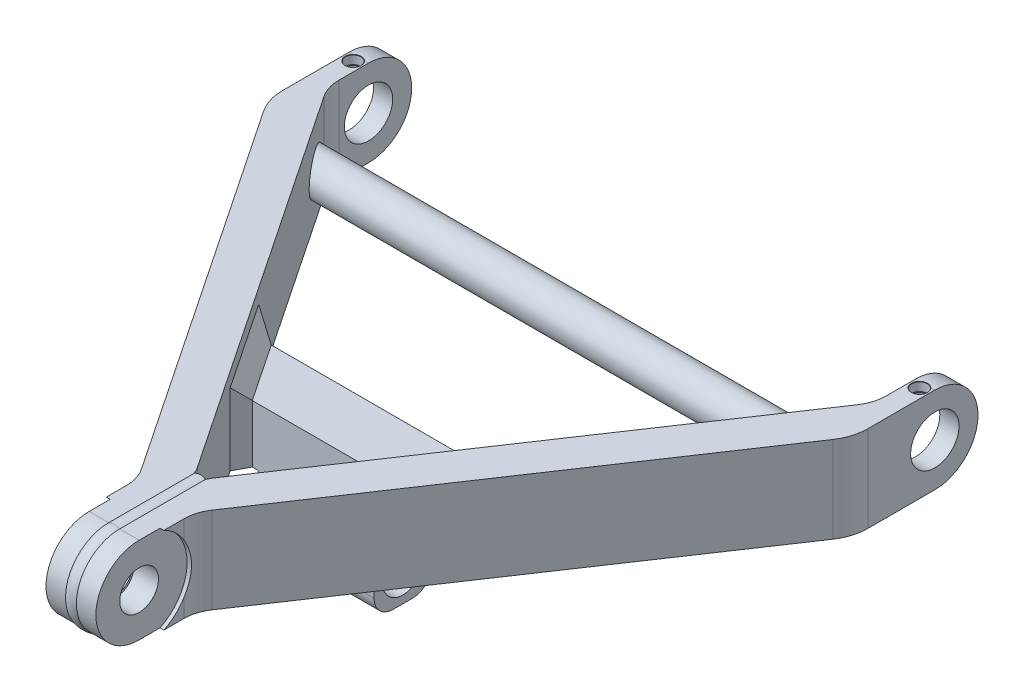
ISO-10303-21;
HEADER;
FILE_DESCRIPTION(('STEP AP214'),'2;1');
FILE_NAME('part.step','',(''),(''),'','','');
FILE_SCHEMA(('AUTOMOTIVE_DESIGN { 1 0 10303 214 1 1 1 1 }'));
ENDSEC;
DATA;
#1=APPLICATION_CONTEXT('core data for automotive mechanical design processes');
#2=APPLICATION_PROTOCOL_DEFINITION('international standard','automotive_design',2000,#1);
#3=PRODUCT_CONTEXT('',#1,'mechanical');
#4=PRODUCT('Part','Part','',(#3));
#5=PRODUCT_RELATED_PRODUCT_CATEGORY('part','',(#4));
#6=PRODUCT_DEFINITION_FORMATION('','',#4);
#7=PRODUCT_DEFINITION_CONTEXT('part definition',#1,'design');
#8=PRODUCT_DEFINITION('design','',#6,#7);
#9=PRODUCT_DEFINITION_SHAPE('','',#8);
#10=(LENGTH_UNIT() NAMED_UNIT(*) SI_UNIT(.MILLI.,.METRE.));
#11=(NAMED_UNIT(*) PLANE_ANGLE_UNIT() SI_UNIT($,.RADIAN.));
#12=(NAMED_UNIT(*) SI_UNIT($,.STERADIAN.) SOLID_ANGLE_UNIT());
#13=UNCERTAINTY_MEASURE_WITH_UNIT(LENGTH_MEASURE(1.E-05),#10,'distance_accuracy_value','');
#14=(GEOMETRIC_REPRESENTATION_CONTEXT(3) GLOBAL_UNCERTAINTY_ASSIGNED_CONTEXT((#13)) GLOBAL_UNIT_ASSIGNED_CONTEXT((#10,
#11,#12)) REPRESENTATION_CONTEXT('',''));
#15=CARTESIAN_POINT('',(0.,0.,0.));
#16=DIRECTION('',(0.,0.,1.));
#17=DIRECTION('',(1.,0.,0.));
#18=AXIS2_PLACEMENT_3D('',#15,#16,#17);
#19=CARTESIAN_POINT('',(-24.003,-29.21,196.85));
#20=DIRECTION('',(1.,0.,0.));
#21=DIRECTION('',(0.,0.,-1.));
#22=AXIS2_PLACEMENT_3D('',#19,#20,#21);
#23=CYLINDRICAL_SURFACE('',#22,13.335);
#24=DIRECTION('',(1.,0.,0.));
#25=VECTOR('',#24,1.);
#26=CARTESIAN_POINT('',(-24.003,-18.3865572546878,204.639435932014));
#27=LINE('',#26,#25);
#28=CARTESIAN_POINT('',(16.383,-18.3865572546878,204.639435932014));
#29=VERTEX_POINT('',#28);
#30=CARTESIAN_POINT('',(0.,-18.3865572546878,204.639435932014));
#31=VERTEX_POINT('',#30);
#32=EDGE_CURVE('E1836',#29,#31,#27,.F.);
#33=ORIENTED_EDGE('',*,*,#32,.T.);
#34=CARTESIAN_POINT('',(0.,-29.21,196.85));
#35=DIRECTION('',(-1.,0.,0.));
#36=DIRECTION('',(0.,0.,1.));
#37=AXIS2_PLACEMENT_3D('',#34,#35,#36);
#38=CIRCLE('',#37,13.335);
#39=CARTESIAN_POINT('',(0.,-40.0334427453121,189.060564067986));
#40=VERTEX_POINT('',#39);
#41=EDGE_CURVE('E15',#31,#40,#38,.F.);
#42=ORIENTED_EDGE('',*,*,#41,.T.);
#43=DIRECTION('',(1.,0.,0.));
#44=VECTOR('',#43,1.);
#45=CARTESIAN_POINT('',(-24.003,-40.0334427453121,189.060564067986));
#46=LINE('',#45,#44);
#47=CARTESIAN_POINT('',(16.383,-40.0334427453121,189.060564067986));
#48=VERTEX_POINT('',#47);
#49=EDGE_CURVE('E1837',#40,#48,#46,.T.);
#50=ORIENTED_EDGE('',*,*,#49,.T.);
#51=CARTESIAN_POINT('',(16.383,-29.21,196.85));
#52=DIRECTION('',(1.,0.,0.));
#53=DIRECTION('',(0.,0.,-1.));
#54=AXIS2_PLACEMENT_3D('',#51,#52,#53);
#55=CIRCLE('',#54,13.335);
#56=EDGE_CURVE('E1824',#29,#48,#55,.T.);
#57=ORIENTED_EDGE('',*,*,#56,.F.);
#58=EDGE_LOOP('',(#33,#42,#50,#57));
#59=FACE_BOUND('',#58,.T.);
#60=ADVANCED_FACE('F63',(#59),#23,.T.);
#61=ORIENTED_EDGE('',*,*,#49,.F.);
#62=CARTESIAN_POINT('',(0.,-29.21,196.85));
#63=DIRECTION('',(-1.,0.,0.));
#64=DIRECTION('',(0.,0.,1.));
#65=AXIS2_PLACEMENT_3D('',#62,#63,#64);
#66=CIRCLE('',#65,13.335);
#67=EDGE_CURVE('E67',#40,#31,#66,.F.);
#68=ORIENTED_EDGE('',*,*,#67,.T.);
#69=ORIENTED_EDGE('',*,*,#32,.F.);
#70=EDGE_CURVE('E1827',#48,#29,#55,.T.);
#71=ORIENTED_EDGE('',*,*,#70,.F.);
#72=EDGE_LOOP('',(#61,#68,#69,#71));
#73=FACE_BOUND('',#72,.T.);
#74=ADVANCED_FACE('F854',(#73),#23,.T.);
#75=ORIENTED_EDGE('',*,*,#41,.F.);
#76=CARTESIAN_POINT('',(-16.383,-18.3865572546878,204.639435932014));
#77=VERTEX_POINT('',#76);
#78=EDGE_CURVE('E1847',#31,#77,#27,.F.);
#79=ORIENTED_EDGE('',*,*,#78,.T.);
#80=CARTESIAN_POINT('',(-16.383,-29.21,196.85));
#81=DIRECTION('',(-1.,0.,0.));
#82=DIRECTION('',(0.,0.,1.));
#83=AXIS2_PLACEMENT_3D('',#80,#81,#82);
#84=CIRCLE('',#83,13.335);
#85=CARTESIAN_POINT('',(-16.383,-40.0334427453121,189.060564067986));
#86=VERTEX_POINT('',#85);
#87=EDGE_CURVE('E1821',#86,#77,#84,.T.);
#88=ORIENTED_EDGE('',*,*,#87,.F.);
#89=EDGE_CURVE('E1839',#86,#40,#46,.T.);
#90=ORIENTED_EDGE('',*,*,#89,.T.);
#91=EDGE_LOOP('',(#75,#79,#88,#90));
#92=FACE_BOUND('',#91,.T.);
#93=ADVANCED_FACE('F720',(#92),#23,.T.);
#94=CARTESIAN_POINT('',(-73.1500757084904,-29.21,196.85));
#95=DIRECTION('',(1.,0.,0.));
#96=DIRECTION('',(0.,0.,-1.));
#97=AXIS2_PLACEMENT_3D('',#94,#95,#96);
#98=CYLINDRICAL_SURFACE('',#97,13.335);
#99=CARTESIAN_POINT('',(-35.433,-29.21,196.85));
#100=DIRECTION('',(1.,0.,0.));
#101=DIRECTION('',(0.,0.,-1.));
#102=AXIS2_PLACEMENT_3D('',#99,#100,#101);
#103=CIRCLE('',#102,13.335);
#104=CARTESIAN_POINT('',(-35.433,-29.21,183.515));
#105=VERTEX_POINT('',#104);
#106=EDGE_CURVE('E1964',#105,#105,#103,.F.);
#107=ORIENTED_EDGE('',*,*,#106,.T.);
#108=EDGE_LOOP('',(#107));
#109=FACE_BOUND('',#108,.T.);
#110=CARTESIAN_POINT('',(-24.003,-29.21,196.85));
#111=DIRECTION('',(1.,0.,0.));
#112=DIRECTION('',(0.,0.,-1.));
#113=AXIS2_PLACEMENT_3D('',#110,#111,#112);
#114=CIRCLE('',#113,13.335);
#115=CARTESIAN_POINT('',(-24.003,-29.21,183.515));
#116=VERTEX_POINT('',#115);
#117=EDGE_CURVE('E1840',#116,#116,#114,.F.);
#118=ORIENTED_EDGE('',*,*,#117,.F.);
#119=EDGE_LOOP('',(#118));
#120=FACE_BOUND('',#119,.T.);
#121=ADVANCED_FACE('F716',(#109,#120),#98,.F.);
#122=CARTESIAN_POINT('',(-38.1,0.,311.897458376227));
#123=DIRECTION('',(0.,-1.,0.));
#124=DIRECTION('',(0.,0.,-1.));
#125=AXIS2_PLACEMENT_3D('',#122,#123,#124);
#126=PLANE('',#125);
#127=DIRECTION('',(0.830488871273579,0.,0.557035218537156));
#128=VECTOR('',#127,1.);
#129=CARTESIAN_POINT('',(81.1789880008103,0.,178.360802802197));
#130=LINE('',#129,#128);
#131=CARTESIAN_POINT('',(81.1789880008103,0.,178.360802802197));
#132=VERTEX_POINT('',#131);
#133=CARTESIAN_POINT('',(81.6008763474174,0.,178.643776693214));
#134=VERTEX_POINT('',#133);
#135=EDGE_CURVE('E2478',#132,#134,#130,.T.);
#136=ORIENTED_EDGE('',*,*,#135,.F.);
#137=DIRECTION('',(-0.557035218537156,0.,0.830488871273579));
#138=VECTOR('',#137,1.);
#139=CARTESIAN_POINT('',(56.7560055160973,0.,214.773249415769));
#140=LINE('',#139,#138);
#141=CARTESIAN_POINT('',(56.7560055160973,0.,214.773249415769));
#142=VERTEX_POINT('',#141);
#143=EDGE_CURVE('E2468',#132,#142,#140,.T.);
#144=ORIENTED_EDGE('',*,*,#143,.T.);
#145=DIRECTION('',(0.830488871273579,0.,0.557035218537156));
#146=VECTOR('',#145,1.);
#147=CARTESIAN_POINT('',(56.7560055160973,0.,214.773249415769));
#148=LINE('',#147,#146);
#149=CARTESIAN_POINT('',(57.1778938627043,0.,215.056223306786));
#150=VERTEX_POINT('',#149);
#151=EDGE_CURVE('E2494',#142,#150,#148,.T.);
#152=ORIENTED_EDGE('',*,*,#151,.T.);
#153=DIRECTION('',(-0.557035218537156,0.,0.830488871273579));
#154=VECTOR('',#153,1.);
#155=CARTESIAN_POINT('',(57.1778938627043,0.,215.056223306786));
#156=LINE('',#155,#154);
#157=EDGE_CURVE('E2467',#134,#150,#156,.T.);
#158=ORIENTED_EDGE('',*,*,#157,.F.);
#159=EDGE_LOOP('',(#136,#144,#152,#158));
#160=FACE_BOUND('',#159,.T.);
#161=DIRECTION('',(0.,0.,1.));
#162=VECTOR('',#161,1.);
#163=CARTESIAN_POINT('',(19.05,0.,325.229462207));
#164=LINE('',#163,#162);
#165=CARTESIAN_POINT('',(19.05,0.,325.229462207));
#166=VERTEX_POINT('',#165);
#167=CARTESIAN_POINT('',(19.05,0.,338.585495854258));
#168=VERTEX_POINT('',#167);
#169=EDGE_CURVE('E2105',#166,#168,#164,.T.);
#170=ORIENTED_EDGE('',*,*,#169,.T.);
#171=DIRECTION('',(-1.,0.,0.));
#172=VECTOR('',#171,1.);
#173=CARTESIAN_POINT('',(21.5900000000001,0.,338.585495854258));
#174=LINE('',#173,#172);
#175=CARTESIAN_POINT('',(16.5100000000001,0.,338.585495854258));
#176=VERTEX_POINT('',#175);
#177=EDGE_CURVE('E575',#168,#176,#174,.T.);
#178=ORIENTED_EDGE('',*,*,#177,.T.);
#179=DIRECTION('',(0.,0.,1.));
#180=VECTOR('',#179,1.);
#181=CARTESIAN_POINT('',(16.5100000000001,0.,311.897458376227));
#182=LINE('',#181,#180);
#183=CARTESIAN_POINT('',(16.5100000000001,0.,352.425));
#184=VERTEX_POINT('',#183);
#185=EDGE_CURVE('E584',#176,#184,#182,.T.);
#186=ORIENTED_EDGE('',*,*,#185,.T.);
#187=DIRECTION('',(1.,0.,0.));
#188=VECTOR('',#187,1.);
#189=CARTESIAN_POINT('',(19.05,0.,352.425));
#190=LINE('',#189,#188);
#191=CARTESIAN_POINT('',(3.60107150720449,0.,352.425));
#192=VERTEX_POINT('',#191);
#193=EDGE_CURVE('E2183',#192,#184,#190,.T.);
#194=ORIENTED_EDGE('',*,*,#193,.F.);
#195=DIRECTION('',(0.,0.,1.));
#196=VECTOR('',#195,1.);
#197=CARTESIAN_POINT('',(3.60107150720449,0.,311.897458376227));
#198=LINE('',#197,#196);
#199=CARTESIAN_POINT('',(3.60107150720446,0.,295.728539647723));
#200=VERTEX_POINT('',#199);
#201=EDGE_CURVE('E2186',#200,#192,#198,.T.);
#202=ORIENTED_EDGE('',*,*,#201,.F.);
#203=CARTESIAN_POINT('',(38.1,0.,311.897458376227));
#204=DIRECTION('',(0.,-1.,0.));
#205=DIRECTION('',(0.,0.,-1.));
#206=AXIS2_PLACEMENT_3D('',#203,#204,#205);
#207=CIRCLE('',#206,38.1);
#208=CARTESIAN_POINT('',(6.45837400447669,0.,290.674416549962));
#209=VERTEX_POINT('',#208);
#210=EDGE_CURVE('E2101',#200,#209,#207,.T.);
#211=ORIENTED_EDGE('',*,*,#210,.T.);
#212=DIRECTION('',(0.557035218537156,0.,-0.830488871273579));
#213=VECTOR('',#212,1.);
#214=CARTESIAN_POINT('',(176.669417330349,0.,36.9052246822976));
#215=LINE('',#214,#213);
#216=CARTESIAN_POINT('',(50.2232265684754,0.,225.425));
#217=VERTEX_POINT('',#216);
#218=EDGE_CURVE('E2130',#209,#217,#215,.T.);
#219=ORIENTED_EDGE('',*,*,#218,.T.);
#220=DIRECTION('',(-0.470619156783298,0.,-0.882336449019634));
#221=VECTOR('',#220,1.);
#222=CARTESIAN_POINT('',(50.2232265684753,0.,225.425));
#223=LINE('',#222,#221);
#224=CARTESIAN_POINT('',(45.1427978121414,0.,215.9));
#225=VERTEX_POINT('',#224);
#226=EDGE_CURVE('E2394',#217,#225,#223,.T.);
#227=ORIENTED_EDGE('',*,*,#226,.T.);
#228=DIRECTION('',(-1.,0.,0.));
#229=VECTOR('',#228,1.);
#230=CARTESIAN_POINT('',(56.6119460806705,0.,215.9));
#231=LINE('',#230,#229);
#232=CARTESIAN_POINT('',(41.783,0.,215.9));
#233=VERTEX_POINT('',#232);
#234=EDGE_CURVE('E2010',#225,#233,#231,.T.);
#235=ORIENTED_EDGE('',*,*,#234,.T.);
#236=DIRECTION('',(0.,0.,-1.));
#237=VECTOR('',#236,1.);
#238=CARTESIAN_POINT('',(41.783,0.,311.897458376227));
#239=LINE('',#238,#237);
#240=CARTESIAN_POINT('',(41.783,0.,177.8));
#241=VERTEX_POINT('',#240);
#242=EDGE_CURVE('E1913',#233,#241,#239,.T.);
#243=ORIENTED_EDGE('',*,*,#242,.T.);
#244=DIRECTION('',(1.,0.,0.));
#245=VECTOR('',#244,1.);
#246=CARTESIAN_POINT('',(-82.166824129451,0.,177.8));
#247=LINE('',#246,#245);
#248=CARTESIAN_POINT('',(70.6976758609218,0.,177.8));
#249=VERTEX_POINT('',#248);
#250=EDGE_CURVE('E2012',#241,#249,#247,.T.);
#251=ORIENTED_EDGE('',*,*,#250,.T.);
#252=DIRECTION('',(0.882336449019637,0.,-0.470619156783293));
#253=VECTOR('',#252,1.);
#254=CARTESIAN_POINT('',(70.6976758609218,0.,177.8));
#255=LINE('',#254,#253);
#256=CARTESIAN_POINT('',(88.5555436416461,0.,168.275));
#257=VERTEX_POINT('',#256);
#258=EDGE_CURVE('E2390',#249,#257,#255,.T.);
#259=ORIENTED_EDGE('',*,*,#258,.T.);
#260=CARTESIAN_POINT('',(176.669417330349,0.,36.9052246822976));
#261=VERTEX_POINT('',#260);
#262=EDGE_CURVE('E2129',#257,#261,#215,.T.);
#263=ORIENTED_EDGE('',*,*,#262,.T.);
#264=CARTESIAN_POINT('',(155.575,0.,22.7565301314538));
#265=DIRECTION('',(0.,1.,0.));
#266=DIRECTION('',(0.,0.,1.));
#267=AXIS2_PLACEMENT_3D('',#264,#265,#266);
#268=CIRCLE('',#267,25.4);
#269=CARTESIAN_POINT('',(180.975,0.,22.7565301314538));
#270=VERTEX_POINT('',#269);
#271=EDGE_CURVE('E2133',#261,#270,#268,.T.);
#272=ORIENTED_EDGE('',*,*,#271,.T.);
#273=DIRECTION('',(0.,0.,-1.));
#274=VECTOR('',#273,1.);
#275=CARTESIAN_POINT('',(180.975,0.,0.));
#276=LINE('',#275,#274);
#277=CARTESIAN_POINT('',(180.975,0.,3.17499999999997));
#278=VERTEX_POINT('',#277);
#279=EDGE_CURVE('E2136',#270,#278,#276,.T.);
#280=ORIENTED_EDGE('',*,*,#279,.T.);
#281=DIRECTION('',(-1.,0.,0.));
#282=VECTOR('',#281,1.);
#283=CARTESIAN_POINT('',(180.975,0.,3.17499999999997));
#284=LINE('',#283,#282);
#285=CARTESIAN_POINT('',(193.675,0.,3.17499999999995));
#286=VERTEX_POINT('',#285);
#287=EDGE_CURVE('E2174',#286,#278,#284,.T.);
#288=ORIENTED_EDGE('',*,*,#287,.F.);
#289=DIRECTION('',(0.,0.,1.));
#290=VECTOR('',#289,1.);
#291=CARTESIAN_POINT('',(193.675,0.,-25.4));
#292=LINE('',#291,#290);
#293=CARTESIAN_POINT('',(193.675,0.,47.4881722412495));
#294=VERTEX_POINT('',#293);
#295=EDGE_CURVE('E2139',#286,#294,#292,.T.);
#296=ORIENTED_EDGE('',*,*,#295,.T.);
#297=CARTESIAN_POINT('',(161.925,0.,47.4881722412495));
#298=DIRECTION('',(0.,-1.,0.));
#299=DIRECTION('',(0.,0.,1.));
#300=AXIS2_PLACEMENT_3D('',#297,#298,#299);
#301=CIRCLE('',#300,31.75);
#302=CARTESIAN_POINT('',(188.293021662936,0.,65.1740404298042));
#303=VERTEX_POINT('',#302);
#304=EDGE_CURVE('E2142',#294,#303,#301,.T.);
#305=ORIENTED_EDGE('',*,*,#304,.T.);
#306=DIRECTION('',(-0.557035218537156,0.,0.830488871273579));
#307=VECTOR('',#306,1.);
#308=CARTESIAN_POINT('',(188.293021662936,0.,65.1740404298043));
#309=LINE('',#308,#307);
#310=CARTESIAN_POINT('',(23.3555826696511,0.,311.080767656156));
#311=VERTEX_POINT('',#310);
#312=EDGE_CURVE('E2145',#303,#311,#309,.T.);
#313=ORIENTED_EDGE('',*,*,#312,.T.);
#314=CARTESIAN_POINT('',(44.45,0.,325.229462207));
#315=DIRECTION('',(0.,1.,0.));
#316=DIRECTION('',(0.,0.,-1.));
#317=AXIS2_PLACEMENT_3D('',#314,#315,#316);
#318=CIRCLE('',#317,25.4);
#319=EDGE_CURVE('E2148',#311,#166,#318,.T.);
#320=ORIENTED_EDGE('',*,*,#319,.T.);
#321=EDGE_LOOP('',(#170,#178,#186,#194,#202,#211,#219,#227,#235,#243,#251,#259,#263,#272,#280,
#288,#296,#305,#313,#320));
#322=FACE_BOUND('',#321,.T.);
#323=ADVANCED_FACE('F719',(#160,#322),#126,.T.);
#324=CARTESIAN_POINT('',(-38.1,57.15,311.897458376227));
#325=DIRECTION('',(0.,-1.,0.));
#326=DIRECTION('',(0.,0.,-1.));
#327=AXIS2_PLACEMENT_3D('',#324,#325,#326);
#328=PLANE('',#327);
#329=DIRECTION('',(-1.,0.,0.));
#330=VECTOR('',#329,1.);
#331=CARTESIAN_POINT('',(21.5900000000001,57.15,338.585495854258));
#332=LINE('',#331,#330);
#333=CARTESIAN_POINT('',(19.05,57.15,338.585495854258));
#334=VERTEX_POINT('',#333);
#335=CARTESIAN_POINT('',(16.5100000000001,57.15,338.585495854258));
#336=VERTEX_POINT('',#335);
#337=EDGE_CURVE('E565',#334,#336,#332,.T.);
#338=ORIENTED_EDGE('',*,*,#337,.F.);
#339=DIRECTION('',(0.,0.,1.));
#340=VECTOR('',#339,1.);
#341=CARTESIAN_POINT('',(19.05,57.15,325.229462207));
#342=LINE('',#341,#340);
#343=CARTESIAN_POINT('',(19.05,57.15,325.229462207));
#344=VERTEX_POINT('',#343);
#345=EDGE_CURVE('E2125',#344,#334,#342,.T.);
#346=ORIENTED_EDGE('',*,*,#345,.F.);
#347=CARTESIAN_POINT('',(44.45,57.15,325.229462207));
#348=DIRECTION('',(0.,1.,0.));
#349=DIRECTION('',(0.,0.,-1.));
#350=AXIS2_PLACEMENT_3D('',#347,#348,#349);
#351=CIRCLE('',#350,25.4);
#352=CARTESIAN_POINT('',(23.3555826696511,57.15,311.080767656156));
#353=VERTEX_POINT('',#352);
#354=EDGE_CURVE('E2122',#353,#344,#351,.T.);
#355=ORIENTED_EDGE('',*,*,#354,.F.);
#356=DIRECTION('',(-0.557035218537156,0.,0.830488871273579));
#357=VECTOR('',#356,1.);
#358=CARTESIAN_POINT('',(188.293021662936,57.15,65.1740404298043));
#359=LINE('',#358,#357);
#360=CARTESIAN_POINT('',(188.293021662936,57.15,65.1740404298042));
#361=VERTEX_POINT('',#360);
#362=EDGE_CURVE('E2119',#361,#353,#359,.T.);
#363=ORIENTED_EDGE('',*,*,#362,.F.);
#364=CARTESIAN_POINT('',(161.925,57.15,47.4881722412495));
#365=DIRECTION('',(0.,-1.,0.));
#366=DIRECTION('',(0.,0.,1.));
#367=AXIS2_PLACEMENT_3D('',#364,#365,#366);
#368=CIRCLE('',#367,31.75);
#369=CARTESIAN_POINT('',(193.675,57.15,47.4881722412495));
#370=VERTEX_POINT('',#369);
#371=EDGE_CURVE('E2116',#370,#361,#368,.T.);
#372=ORIENTED_EDGE('',*,*,#371,.F.);
#373=DIRECTION('',(0.,0.,1.));
#374=VECTOR('',#373,1.);
#375=CARTESIAN_POINT('',(193.675,57.15,-25.4));
#376=LINE('',#375,#374);
#377=CARTESIAN_POINT('',(193.675,57.15,3.17499999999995));
#378=VERTEX_POINT('',#377);
#379=EDGE_CURVE('E2113',#378,#370,#376,.T.);
#380=ORIENTED_EDGE('',*,*,#379,.F.);
#381=DIRECTION('',(1.,0.,0.));
#382=VECTOR('',#381,1.);
#383=CARTESIAN_POINT('',(38.0999999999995,57.15,3.1750000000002));
#384=LINE('',#383,#382);
#385=CARTESIAN_POINT('',(191.058022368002,57.15,3.17499999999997));
#386=VERTEX_POINT('',#385);
#387=EDGE_CURVE('E2170',#386,#378,#384,.T.);
#388=ORIENTED_EDGE('',*,*,#387,.F.);
#389=CARTESIAN_POINT('',(187.325,57.15,6.985));
#390=DIRECTION('',(0.,1.,0.));
#391=DIRECTION('',(0.,0.,1.));
#392=AXIS2_PLACEMENT_3D('',#389,#390,#391);
#393=CIRCLE('',#392,5.334);
#394=CARTESIAN_POINT('',(183.591977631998,57.15,3.17499999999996));
#395=VERTEX_POINT('',#394);
#396=EDGE_CURVE('E2028',#395,#386,#393,.T.);
#397=ORIENTED_EDGE('',*,*,#396,.F.);
#398=CARTESIAN_POINT('',(180.975,57.15,3.17499999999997));
#399=VERTEX_POINT('',#398);
#400=EDGE_CURVE('E2171',#399,#395,#384,.T.);
#401=ORIENTED_EDGE('',*,*,#400,.F.);
#402=DIRECTION('',(0.,0.,-1.));
#403=VECTOR('',#402,1.);
#404=CARTESIAN_POINT('',(180.975,57.15,0.));
#405=LINE('',#404,#403);
#406=CARTESIAN_POINT('',(180.975,57.15,22.7565301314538));
#407=VERTEX_POINT('',#406);
#408=EDGE_CURVE('E2111',#407,#399,#405,.T.);
#409=ORIENTED_EDGE('',*,*,#408,.F.);
#410=CARTESIAN_POINT('',(155.575,57.15,22.7565301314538));
#411=DIRECTION('',(0.,1.,0.));
#412=DIRECTION('',(0.,0.,1.));
#413=AXIS2_PLACEMENT_3D('',#410,#411,#412);
#414=CIRCLE('',#413,25.4);
#415=CARTESIAN_POINT('',(176.669417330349,57.15,36.9052246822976));
#416=VERTEX_POINT('',#415);
#417=EDGE_CURVE('E2108',#416,#407,#414,.T.);
#418=ORIENTED_EDGE('',*,*,#417,.F.);
#419=DIRECTION('',(0.557035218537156,0.,-0.830488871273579));
#420=VECTOR('',#419,1.);
#421=CARTESIAN_POINT('',(176.669417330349,57.15,36.9052246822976));
#422=LINE('',#421,#420);
#423=CARTESIAN_POINT('',(6.45837400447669,57.15,290.674416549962));
#424=VERTEX_POINT('',#423);
#425=EDGE_CURVE('E2104',#424,#416,#422,.T.);
#426=ORIENTED_EDGE('',*,*,#425,.F.);
#427=CARTESIAN_POINT('',(38.1,57.15,311.897458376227));
#428=DIRECTION('',(0.,-1.,0.));
#429=DIRECTION('',(0.,0.,-1.));
#430=AXIS2_PLACEMENT_3D('',#427,#428,#429);
#431=CIRCLE('',#430,38.1);
#432=CARTESIAN_POINT('',(3.60107150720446,57.15,295.728539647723));
#433=VERTEX_POINT('',#432);
#434=EDGE_CURVE('E2102',#433,#424,#431,.T.);
#435=ORIENTED_EDGE('',*,*,#434,.F.);
#436=DIRECTION('',(0.,0.,-1.));
#437=VECTOR('',#436,1.);
#438=CARTESIAN_POINT('',(3.60107150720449,57.15,352.425));
#439=LINE('',#438,#437);
#440=CARTESIAN_POINT('',(3.60107150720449,57.15,352.425));
#441=VERTEX_POINT('',#440);
#442=EDGE_CURVE('E2191',#433,#441,#439,.F.);
#443=ORIENTED_EDGE('',*,*,#442,.T.);
#444=DIRECTION('',(-1.,0.,0.));
#445=VECTOR('',#444,1.);
#446=CARTESIAN_POINT('',(38.1,57.15,352.425));
#447=LINE('',#446,#445);
#448=CARTESIAN_POINT('',(16.5100000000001,57.15,352.425));
#449=VERTEX_POINT('',#448);
#450=EDGE_CURVE('E590',#449,#441,#447,.T.);
#451=ORIENTED_EDGE('',*,*,#450,.F.);
#452=DIRECTION('',(0.,0.,1.));
#453=VECTOR('',#452,1.);
#454=CARTESIAN_POINT('',(16.5100000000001,57.15,311.897458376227));
#455=LINE('',#454,#453);
#456=EDGE_CURVE('E581',#336,#449,#455,.T.);
#457=ORIENTED_EDGE('',*,*,#456,.F.);
#458=EDGE_LOOP('',(#338,#346,#355,#363,#372,#380,#388,#397,#401,#409,#418,#426,#435,#443,#451,#457));
#459=FACE_BOUND('',#458,.T.);
#460=ADVANCED_FACE('F588',(#459),#328,.F.);
#461=CARTESIAN_POINT('',(19.05,28.575,352.425));
#462=DIRECTION('',(-1.,0.,0.));
#463=DIRECTION('',(0.,0.,-1.));
#464=AXIS2_PLACEMENT_3D('',#461,#462,#463);
#465=CYLINDRICAL_SURFACE('',#464,28.575);
#466=ORIENTED_EDGE('',*,*,#193,.T.);
#467=CARTESIAN_POINT('',(16.5100000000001,28.575,352.425));
#468=DIRECTION('',(1.,0.,0.));
#469=DIRECTION('',(0.,0.,-1.));
#470=AXIS2_PLACEMENT_3D('',#467,#468,#469);
#471=CIRCLE('',#470,28.575);
#472=EDGE_CURVE('E591',#184,#449,#471,.F.);
#473=ORIENTED_EDGE('',*,*,#472,.T.);
#474=ORIENTED_EDGE('',*,*,#450,.T.);
#475=CARTESIAN_POINT('',(3.60107150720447,28.575,352.425));
#476=DIRECTION('',(1.,0.,0.));
#477=DIRECTION('',(0.,0.,-1.));
#478=AXIS2_PLACEMENT_3D('',#475,#476,#477);
#479=CIRCLE('',#478,28.575);
#480=EDGE_CURVE('E2077',#192,#441,#479,.F.);
#481=ORIENTED_EDGE('',*,*,#480,.F.);
#482=EDGE_LOOP('',(#466,#473,#474,#481));
#483=FACE_BOUND('',#482,.T.);
#484=ADVANCED_FACE('F837',(#483),#465,.T.);
#485=CARTESIAN_POINT('',(193.675,28.575,352.425));
#486=DIRECTION('',(-1.,0.,0.));
#487=DIRECTION('',(0.,0.,-1.));
#488=AXIS2_PLACEMENT_3D('',#485,#486,#487);
#489=CYLINDRICAL_SURFACE('',#488,12.8269999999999);
#490=CARTESIAN_POINT('',(0.507999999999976,28.575,352.425));
#491=DIRECTION('',(1.,0.,0.));
#492=DIRECTION('',(0.,0.,-1.));
#493=AXIS2_PLACEMENT_3D('',#490,#491,#492);
#494=CIRCLE('',#493,12.8269999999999);
#495=CARTESIAN_POINT('',(0.507999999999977,28.575,339.598));
#496=VERTEX_POINT('',#495);
#497=EDGE_CURVE('E2094',#496,#496,#494,.F.);
#498=ORIENTED_EDGE('',*,*,#497,.T.);
#499=EDGE_LOOP('',(#498));
#500=FACE_BOUND('',#499,.T.);
#501=CARTESIAN_POINT('',(16.5100000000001,28.575,352.425));
#502=DIRECTION('',(1.,0.,0.));
#503=DIRECTION('',(0.,0.,-1.));
#504=AXIS2_PLACEMENT_3D('',#501,#502,#503);
#505=CIRCLE('',#504,12.8269999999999);
#506=CARTESIAN_POINT('',(16.5100000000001,28.575,339.598));
#507=VERTEX_POINT('',#506);
#508=EDGE_CURVE('E595',#507,#507,#505,.F.);
#509=ORIENTED_EDGE('',*,*,#508,.F.);
#510=EDGE_LOOP('',(#509));
#511=FACE_BOUND('',#510,.T.);
#512=ADVANCED_FACE('F900',(#500,#511),#489,.F.);
#513=CARTESIAN_POINT('',(44.45,57.15,325.229462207));
#514=DIRECTION('',(0.,-1.,0.));
#515=DIRECTION('',(0.,0.,-1.));
#516=AXIS2_PLACEMENT_3D('',#513,#514,#515);
#517=CYLINDRICAL_SURFACE('',#516,25.4);
#518=CARTESIAN_POINT('',(19.05,12.1900915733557,325.229462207));
#519=CARTESIAN_POINT('',(19.0500110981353,12.5710152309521,324.999954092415));
#520=CARTESIAN_POINT('',(19.0531108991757,12.9567500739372,324.77847032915));
#521=CARTESIAN_POINT('',(19.0642637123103,13.7371019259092,324.351936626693));
#522=CARTESIAN_POINT('',(19.0723164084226,14.131718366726,324.146885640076));
#523=CARTESIAN_POINT('',(19.0921492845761,14.9290677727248,323.753609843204));
#524=CARTESIAN_POINT('',(19.1039287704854,15.3317992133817,323.565381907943));
#525=CARTESIAN_POINT('',(19.1300838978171,16.144713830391,323.206032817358));
#526=CARTESIAN_POINT('',(19.1444595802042,16.5548971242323,323.034911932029));
#527=CARTESIAN_POINT('',(19.1898434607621,17.7951465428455,322.547824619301));
#528=CARTESIAN_POINT('',(19.2231266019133,18.6355108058,322.257838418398));
#529=CARTESIAN_POINT('',(19.2882337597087,20.3375435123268,321.749342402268));
#530=CARTESIAN_POINT('',(19.3200577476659,21.1992123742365,321.53083399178));
#531=CARTESIAN_POINT('',(19.3763472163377,22.9384067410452,321.166708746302));
#532=CARTESIAN_POINT('',(19.4008101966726,23.8159375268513,321.021116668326));
#533=CARTESIAN_POINT('',(19.4382454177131,25.5803639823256,320.804045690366));
#534=CARTESIAN_POINT('',(19.4512177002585,26.4672596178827,320.732566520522));
#535=CARTESIAN_POINT('',(19.463596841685,28.2439987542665,320.664281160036));
#536=CARTESIAN_POINT('',(19.4630040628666,29.133842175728,320.667472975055));
#537=CARTESIAN_POINT('',(19.4483470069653,30.9099723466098,320.748499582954));
#538=CARTESIAN_POINT('',(19.4342832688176,31.7962592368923,320.826331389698));
#539=CARTESIAN_POINT('',(19.3951008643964,33.5518568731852,321.055097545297));
#540=CARTESIAN_POINT('',(19.3700715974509,34.4212467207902,321.205441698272));
#541=CARTESIAN_POINT('',(19.3131435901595,36.1444272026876,321.577903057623));
#542=CARTESIAN_POINT('',(19.2812437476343,36.9982153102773,321.800031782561));
#543=CARTESIAN_POINT('',(19.2165323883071,38.6831016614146,322.314144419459));
#544=CARTESIAN_POINT('',(19.1837222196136,39.514230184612,322.606029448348));
#545=CARTESIAN_POINT('',(19.1245280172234,41.1492174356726,323.257804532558));
#546=CARTESIAN_POINT('',(19.0981402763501,41.9530916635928,323.617655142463));
#547=CARTESIAN_POINT('',(19.0702243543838,43.1186233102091,324.198698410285));
#548=CARTESIAN_POINT('',(19.062904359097,43.4928793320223,324.39469764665));
#549=CARTESIAN_POINT('',(19.0527987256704,44.2328148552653,324.801219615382));
#550=CARTESIAN_POINT('',(19.0500069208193,44.5985053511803,325.011722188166));
#551=CARTESIAN_POINT('',(19.05,44.9599084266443,325.229462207));
#552=B_SPLINE_CURVE_WITH_KNOTS('',3,(#518,#519,#520,#521,#522,#523,#524,#525,#526,#527,#528,
#529,#530,#531,#532,#533,#534,#535,#536,#537,#538,#539,#540,#541,#542,#543,#544,#545,#546,#547,
#548,#549,#550,#551),.UNSPECIFIED.,.F.,.F.,(4,2,2,2,2,2,2,2,2,2,2,2,2,2,2,2,4),(0.,
1.3340235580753,2.66796201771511,4.00165217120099,5.33536337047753,8.00078921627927,
10.6662674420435,13.3326500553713,15.9990229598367,18.6653246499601,21.3315196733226,
23.976370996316,26.6216469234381,29.2631950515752,31.9032147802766,33.1705144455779,
34.4360867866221),.UNSPECIFIED.);
#553=CARTESIAN_POINT('',(19.05,12.1900915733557,325.229462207));
#554=VERTEX_POINT('',#553);
#555=CARTESIAN_POINT('',(19.05,44.9599084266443,325.229462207));
#556=VERTEX_POINT('',#555);
#557=EDGE_CURVE('E576',#554,#556,#552,.T.);
#558=ORIENTED_EDGE('',*,*,#557,.F.);
#559=DIRECTION('',(0.,-1.,0.));
#560=VECTOR('',#559,1.);
#561=CARTESIAN_POINT('',(19.05,57.15,325.229462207));
#562=LINE('',#561,#560);
#563=EDGE_CURVE('E2127',#554,#166,#562,.T.);
#564=ORIENTED_EDGE('',*,*,#563,.T.);
#565=ORIENTED_EDGE('',*,*,#319,.F.);
#566=DIRECTION('',(0.,-1.,0.));
#567=VECTOR('',#566,1.);
#568=CARTESIAN_POINT('',(23.3555826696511,57.15,311.080767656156));
#569=LINE('',#568,#567);
#570=EDGE_CURVE('E2156',#353,#311,#569,.T.);
#571=ORIENTED_EDGE('',*,*,#570,.F.);
#572=ORIENTED_EDGE('',*,*,#354,.T.);
#573=EDGE_CURVE('E2153',#344,#556,#562,.T.);
#574=ORIENTED_EDGE('',*,*,#573,.T.);
#575=EDGE_LOOP('',(#558,#564,#565,#571,#572,#574));
#576=FACE_BOUND('',#575,.T.);
#577=ADVANCED_FACE('F908',(#576),#517,.F.);
#578=CARTESIAN_POINT('',(19.05,57.15,325.229462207));
#579=DIRECTION('',(-1.,0.,0.));
#580=DIRECTION('',(0.,0.,-1.));
#581=AXIS2_PLACEMENT_3D('',#578,#579,#580);
#582=PLANE('',#581);
#583=CARTESIAN_POINT('',(19.05,28.575,352.425));
#584=DIRECTION('',(-1.,0.,0.));
#585=DIRECTION('',(0.,0.,1.));
#586=AXIS2_PLACEMENT_3D('',#583,#584,#585);
#587=CIRCLE('',#586,31.75);
#588=EDGE_CURVE('E1859',#168,#554,#587,.F.);
#589=ORIENTED_EDGE('',*,*,#588,.F.);
#590=ORIENTED_EDGE('',*,*,#169,.F.);
#591=ORIENTED_EDGE('',*,*,#563,.F.);
#592=EDGE_LOOP('',(#589,#590,#591));
#593=FACE_BOUND('',#592,.T.);
#594=ADVANCED_FACE('F803',(#593),#582,.F.);
#595=CARTESIAN_POINT('',(-19.05,28.575,352.425));
#596=DIRECTION('',(1.,0.,0.));
#597=DIRECTION('',(0.,0.,-1.));
#598=AXIS2_PLACEMENT_3D('',#595,#596,#597);
#599=CYLINDRICAL_SURFACE('',#598,28.575);
#600=DIRECTION('',(1.,0.,0.));
#601=VECTOR('',#600,1.);
#602=CARTESIAN_POINT('',(-38.1,57.15,352.425));
#603=LINE('',#602,#601);
#604=CARTESIAN_POINT('',(-16.51,57.15,352.425));
#605=VERTEX_POINT('',#604);
#606=CARTESIAN_POINT('',(-3.60107150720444,57.15,352.425));
#607=VERTEX_POINT('',#606);
#608=EDGE_CURVE('E2303',#605,#607,#603,.T.);
#609=ORIENTED_EDGE('',*,*,#608,.F.);
#610=CARTESIAN_POINT('',(-16.51,28.575,352.425));
#611=DIRECTION('',(-1.,0.,0.));
#612=DIRECTION('',(0.,0.,1.));
#613=AXIS2_PLACEMENT_3D('',#610,#611,#612);
#614=CIRCLE('',#613,28.575);
#615=CARTESIAN_POINT('',(-16.51,0.,352.425));
#616=VERTEX_POINT('',#615);
#617=EDGE_CURVE('E1867',#605,#616,#614,.F.);
#618=ORIENTED_EDGE('',*,*,#617,.T.);
#619=DIRECTION('',(-1.,0.,0.));
#620=VECTOR('',#619,1.);
#621=CARTESIAN_POINT('',(-19.05,0.,352.425));
#622=LINE('',#621,#620);
#623=CARTESIAN_POINT('',(-3.60107150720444,0.,352.425));
#624=VERTEX_POINT('',#623);
#625=EDGE_CURVE('E2305',#624,#616,#622,.T.);
#626=ORIENTED_EDGE('',*,*,#625,.F.);
#627=CARTESIAN_POINT('',(-3.60107150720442,28.575,352.425));
#628=DIRECTION('',(1.,0.,0.));
#629=DIRECTION('',(0.,0.,-1.));
#630=AXIS2_PLACEMENT_3D('',#627,#628,#629);
#631=CIRCLE('',#630,28.575);
#632=EDGE_CURVE('E2198',#624,#607,#631,.F.);
#633=ORIENTED_EDGE('',*,*,#632,.T.);
#634=EDGE_LOOP('',(#609,#618,#626,#633));
#635=FACE_BOUND('',#634,.T.);
#636=ADVANCED_FACE('F798',(#635),#599,.T.);
#637=CARTESIAN_POINT('',(-193.675,28.575,352.425));
#638=DIRECTION('',(1.,0.,0.));
#639=DIRECTION('',(0.,0.,-1.));
#640=AXIS2_PLACEMENT_3D('',#637,#638,#639);
#641=CYLINDRICAL_SURFACE('',#640,12.8269999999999);
#642=CARTESIAN_POINT('',(-0.507999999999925,28.575,352.425));
#643=DIRECTION('',(1.,0.,0.));
#644=DIRECTION('',(0.,0.,-1.));
#645=AXIS2_PLACEMENT_3D('',#642,#643,#644);
#646=CIRCLE('',#645,12.8269999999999);
#647=CARTESIAN_POINT('',(-0.507999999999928,28.575,339.598));
#648=VERTEX_POINT('',#647);
#649=EDGE_CURVE('E2216',#648,#648,#646,.F.);
#650=ORIENTED_EDGE('',*,*,#649,.F.);
#651=EDGE_LOOP('',(#650));
#652=FACE_BOUND('',#651,.T.);
#653=CARTESIAN_POINT('',(-16.51,28.575,352.425));
#654=DIRECTION('',(-1.,0.,0.));
#655=DIRECTION('',(0.,0.,1.));
#656=AXIS2_PLACEMENT_3D('',#653,#654,#655);
#657=CIRCLE('',#656,12.8269999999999);
#658=CARTESIAN_POINT('',(-16.51,28.575,365.252));
#659=VERTEX_POINT('',#658);
#660=EDGE_CURVE('E1864',#659,#659,#657,.F.);
#661=ORIENTED_EDGE('',*,*,#660,.F.);
#662=EDGE_LOOP('',(#661));
#663=FACE_BOUND('',#662,.T.);
#664=ADVANCED_FACE('F802',(#652,#663),#641,.F.);
#665=CARTESIAN_POINT('',(-19.05,57.15,325.229462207));
#666=DIRECTION('',(1.,0.,0.));
#667=DIRECTION('',(0.,0.,-1.));
#668=AXIS2_PLACEMENT_3D('',#665,#666,#667);
#669=PLANE('',#668);
#670=DIRECTION('',(0.,-1.,0.));
#671=VECTOR('',#670,1.);
#672=CARTESIAN_POINT('',(-19.05,57.15,325.229462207));
#673=LINE('',#672,#671);
#674=CARTESIAN_POINT('',(-19.05,57.15,325.229462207));
#675=VERTEX_POINT('',#674);
#676=CARTESIAN_POINT('',(-19.05,44.9599084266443,325.229462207));
#677=VERTEX_POINT('',#676);
#678=EDGE_CURVE('E2271',#675,#677,#673,.T.);
#679=ORIENTED_EDGE('',*,*,#678,.T.);
#680=CARTESIAN_POINT('',(-19.05,28.575,352.425));
#681=DIRECTION('',(1.,0.,0.));
#682=DIRECTION('',(0.,0.,-1.));
#683=AXIS2_PLACEMENT_3D('',#680,#681,#682);
#684=CIRCLE('',#683,31.75);
#685=CARTESIAN_POINT('',(-19.05,57.15,338.585495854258));
#686=VERTEX_POINT('',#685);
#687=EDGE_CURVE('E1863',#677,#686,#684,.T.);
#688=ORIENTED_EDGE('',*,*,#687,.T.);
#689=DIRECTION('',(0.,0.,1.));
#690=VECTOR('',#689,1.);
#691=CARTESIAN_POINT('',(-19.05,57.15,325.229462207));
#692=LINE('',#691,#690);
#693=EDGE_CURVE('E2247',#675,#686,#692,.T.);
#694=ORIENTED_EDGE('',*,*,#693,.F.);
#695=EDGE_LOOP('',(#679,#688,#694));
#696=FACE_BOUND('',#695,.T.);
#697=ADVANCED_FACE('F844',(#696),#669,.F.);
#698=DIRECTION('',(-1.,0.,0.));
#699=VECTOR('',#698,1.);
#700=CARTESIAN_POINT('',(-16.51,0.,338.585495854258));
#701=LINE('',#700,#699);
#702=CARTESIAN_POINT('',(-19.05,0.,338.585495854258));
#703=VERTEX_POINT('',#702);
#704=CARTESIAN_POINT('',(-16.51,0.,338.585495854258));
#705=VERTEX_POINT('',#704);
#706=EDGE_CURVE('E610',#703,#705,#701,.F.);
#707=ORIENTED_EDGE('',*,*,#706,.F.);
#708=DIRECTION('',(0.,0.,1.));
#709=VECTOR('',#708,1.);
#710=CARTESIAN_POINT('',(-19.05,0.,325.229462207));
#711=LINE('',#710,#709);
#712=CARTESIAN_POINT('',(-19.05,0.,325.229462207));
#713=VERTEX_POINT('',#712);
#714=EDGE_CURVE('E2232',#713,#703,#711,.T.);
#715=ORIENTED_EDGE('',*,*,#714,.F.);
#716=CARTESIAN_POINT('',(-44.45,0.,325.229462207));
#717=DIRECTION('',(0.,-1.,0.));
#718=DIRECTION('',(0.,0.,-1.));
#719=AXIS2_PLACEMENT_3D('',#716,#717,#718);
#720=CIRCLE('',#719,25.4);
#721=CARTESIAN_POINT('',(-23.3555826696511,0.,311.080767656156));
#722=VERTEX_POINT('',#721);
#723=EDGE_CURVE('E2267',#722,#713,#720,.T.);
#724=ORIENTED_EDGE('',*,*,#723,.F.);
#725=DIRECTION('',(0.557035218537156,0.,0.830488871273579));
#726=VECTOR('',#725,1.);
#727=CARTESIAN_POINT('',(-188.293021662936,0.,65.1740404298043));
#728=LINE('',#727,#726);
#729=CARTESIAN_POINT('',(-188.293021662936,0.,65.1740404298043));
#730=VERTEX_POINT('',#729);
#731=EDGE_CURVE('E2265',#730,#722,#728,.T.);
#732=ORIENTED_EDGE('',*,*,#731,.F.);
#733=CARTESIAN_POINT('',(-161.925,0.,47.4881722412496));
#734=DIRECTION('',(0.,1.,0.));
#735=DIRECTION('',(0.,0.,1.));
#736=AXIS2_PLACEMENT_3D('',#733,#734,#735);
#737=CIRCLE('',#736,31.75);
#738=CARTESIAN_POINT('',(-193.675,0.,47.4881722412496));
#739=VERTEX_POINT('',#738);
#740=EDGE_CURVE('E2263',#739,#730,#737,.T.);
#741=ORIENTED_EDGE('',*,*,#740,.F.);
#742=DIRECTION('',(0.,0.,1.));
#743=VECTOR('',#742,1.);
#744=CARTESIAN_POINT('',(-193.675,0.,-25.4));
#745=LINE('',#744,#743);
#746=CARTESIAN_POINT('',(-193.675,0.,3.17499999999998));
#747=VERTEX_POINT('',#746);
#748=EDGE_CURVE('E2261',#747,#739,#745,.T.);
#749=ORIENTED_EDGE('',*,*,#748,.F.);
#750=DIRECTION('',(1.,0.,0.));
#751=VECTOR('',#750,1.);
#752=CARTESIAN_POINT('',(-180.975,0.,3.17499999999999));
#753=LINE('',#752,#751);
#754=CARTESIAN_POINT('',(-180.975,0.,3.17499999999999));
#755=VERTEX_POINT('',#754);
#756=EDGE_CURVE('E2296',#747,#755,#753,.T.);
#757=ORIENTED_EDGE('',*,*,#756,.T.);
#758=DIRECTION('',(0.,0.,-1.));
#759=VECTOR('',#758,1.);
#760=CARTESIAN_POINT('',(-180.975,0.,0.));
#761=LINE('',#760,#759);
#762=CARTESIAN_POINT('',(-180.975,0.,22.7565301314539));
#763=VERTEX_POINT('',#762);
#764=EDGE_CURVE('E2258',#763,#755,#761,.T.);
#765=ORIENTED_EDGE('',*,*,#764,.F.);
#766=CARTESIAN_POINT('',(-155.575,0.,22.7565301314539));
#767=DIRECTION('',(0.,-1.,0.));
#768=DIRECTION('',(0.,0.,1.));
#769=AXIS2_PLACEMENT_3D('',#766,#767,#768);
#770=CIRCLE('',#769,25.4);
#771=CARTESIAN_POINT('',(-176.669417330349,0.,36.9052246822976));
#772=VERTEX_POINT('',#771);
#773=EDGE_CURVE('E2255',#772,#763,#770,.T.);
#774=ORIENTED_EDGE('',*,*,#773,.F.);
#775=DIRECTION('',(-0.557035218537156,0.,-0.830488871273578));
#776=VECTOR('',#775,1.);
#777=CARTESIAN_POINT('',(-176.669417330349,0.,36.9052246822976));
#778=LINE('',#777,#776);
#779=CARTESIAN_POINT('',(-88.5555436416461,0.,168.275));
#780=VERTEX_POINT('',#779);
#781=EDGE_CURVE('E2252',#780,#772,#778,.T.);
#782=ORIENTED_EDGE('',*,*,#781,.F.);
#783=DIRECTION('',(0.882336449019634,0.,0.470619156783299));
#784=VECTOR('',#783,1.);
#785=CARTESIAN_POINT('',(-70.697675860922,0.,177.8));
#786=LINE('',#785,#784);
#787=CARTESIAN_POINT('',(-70.697675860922,0.,177.8));
#788=VERTEX_POINT('',#787);
#789=EDGE_CURVE('E2412',#780,#788,#786,.T.);
#790=ORIENTED_EDGE('',*,*,#789,.T.);
#791=CARTESIAN_POINT('',(-41.783,0.,177.8));
#792=VERTEX_POINT('',#791);
#793=EDGE_CURVE('E2006',#788,#792,#247,.T.);
#794=ORIENTED_EDGE('',*,*,#793,.T.);
#795=DIRECTION('',(0.,0.,1.));
#796=VECTOR('',#795,1.);
#797=CARTESIAN_POINT('',(-41.783,0.,311.897458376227));
#798=LINE('',#797,#796);
#799=CARTESIAN_POINT('',(-41.783,0.,215.9));
#800=VERTEX_POINT('',#799);
#801=EDGE_CURVE('E1898',#792,#800,#798,.T.);
#802=ORIENTED_EDGE('',*,*,#801,.T.);
#803=CARTESIAN_POINT('',(-45.1427978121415,0.,215.9));
#804=VERTEX_POINT('',#803);
#805=EDGE_CURVE('E2001',#800,#804,#231,.T.);
#806=ORIENTED_EDGE('',*,*,#805,.T.);
#807=DIRECTION('',(-0.470619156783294,0.,0.882336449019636));
#808=VECTOR('',#807,1.);
#809=CARTESIAN_POINT('',(-45.1427978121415,0.,215.9));
#810=LINE('',#809,#808);
#811=CARTESIAN_POINT('',(-50.2232265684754,0.,225.425));
#812=VERTEX_POINT('',#811);
#813=EDGE_CURVE('E2423',#804,#812,#810,.T.);
#814=ORIENTED_EDGE('',*,*,#813,.T.);
#815=CARTESIAN_POINT('',(-6.45837400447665,0.,290.674416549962));
#816=VERTEX_POINT('',#815);
#817=EDGE_CURVE('E2253',#816,#812,#778,.T.);
#818=ORIENTED_EDGE('',*,*,#817,.F.);
#819=CARTESIAN_POINT('',(-38.1,0.,311.897458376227));
#820=DIRECTION('',(0.,1.,0.));
#821=DIRECTION('',(0.,0.,-1.));
#822=AXIS2_PLACEMENT_3D('',#819,#820,#821);
#823=CIRCLE('',#822,38.1);
#824=CARTESIAN_POINT('',(-3.60107150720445,0.,295.728539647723));
#825=VERTEX_POINT('',#824);
#826=EDGE_CURVE('E2228',#825,#816,#823,.T.);
#827=ORIENTED_EDGE('',*,*,#826,.F.);
#828=DIRECTION('',(0.,0.,1.));
#829=VECTOR('',#828,1.);
#830=CARTESIAN_POINT('',(-3.60107150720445,0.,311.897458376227));
#831=LINE('',#830,#829);
#832=EDGE_CURVE('E2308',#825,#624,#831,.T.);
#833=ORIENTED_EDGE('',*,*,#832,.T.);
#834=ORIENTED_EDGE('',*,*,#625,.T.);
#835=DIRECTION('',(0.,0.,-1.));
#836=VECTOR('',#835,1.);
#837=CARTESIAN_POINT('',(-16.51,0.,311.897458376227));
#838=LINE('',#837,#836);
#839=EDGE_CURVE('E2344',#616,#705,#838,.T.);
#840=ORIENTED_EDGE('',*,*,#839,.T.);
#841=EDGE_LOOP('',(#707,#715,#724,#732,#741,#749,#757,#765,#774,#782,#790,#794,#802,#806,#814,
#818,#827,#833,#834,#840));
#842=FACE_BOUND('',#841,.T.);
#843=DIRECTION('',(-0.830488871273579,0.,0.557035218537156));
#844=VECTOR('',#843,1.);
#845=CARTESIAN_POINT('',(-56.7560055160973,0.,214.773249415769));
#846=LINE('',#845,#844);
#847=CARTESIAN_POINT('',(-56.7560055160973,0.,214.773249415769));
#848=VERTEX_POINT('',#847);
#849=CARTESIAN_POINT('',(-57.1778938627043,0.,215.056223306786));
#850=VERTEX_POINT('',#849);
#851=EDGE_CURVE('E2447',#848,#850,#846,.T.);
#852=ORIENTED_EDGE('',*,*,#851,.F.);
#853=DIRECTION('',(0.557035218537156,0.,0.830488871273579));
#854=VECTOR('',#853,1.);
#855=CARTESIAN_POINT('',(-56.7560055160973,0.,214.773249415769));
#856=LINE('',#855,#854);
#857=CARTESIAN_POINT('',(-81.1789880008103,0.,178.360802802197));
#858=VERTEX_POINT('',#857);
#859=EDGE_CURVE('E2435',#858,#848,#856,.T.);
#860=ORIENTED_EDGE('',*,*,#859,.F.);
#861=DIRECTION('',(-0.830488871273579,0.,0.557035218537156));
#862=VECTOR('',#861,1.);
#863=CARTESIAN_POINT('',(-81.1789880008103,0.,178.360802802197));
#864=LINE('',#863,#862);
#865=CARTESIAN_POINT('',(-81.6008763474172,0.,178.643776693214));
#866=VERTEX_POINT('',#865);
#867=EDGE_CURVE('E2464',#858,#866,#864,.T.);
#868=ORIENTED_EDGE('',*,*,#867,.T.);
#869=DIRECTION('',(0.557035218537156,0.,0.830488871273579));
#870=VECTOR('',#869,1.);
#871=CARTESIAN_POINT('',(-57.1778938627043,0.,215.056223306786));
#872=LINE('',#871,#870);
#873=EDGE_CURVE('E2427',#866,#850,#872,.T.);
#874=ORIENTED_EDGE('',*,*,#873,.T.);
#875=EDGE_LOOP('',(#852,#860,#868,#874));
#876=FACE_BOUND('',#875,.T.);
#877=ADVANCED_FACE('F840',(#842,#876),#126,.T.);
#878=CARTESIAN_POINT('',(-10.033,0.,177.8));
#879=VERTEX_POINT('',#878);
#880=CARTESIAN_POINT('',(10.033,0.,177.8));
#881=VERTEX_POINT('',#880);
#882=EDGE_CURVE('E2015',#879,#881,#247,.T.);
#883=ORIENTED_EDGE('',*,*,#882,.T.);
#884=DIRECTION('',(0.,0.,1.));
#885=VECTOR('',#884,1.);
#886=CARTESIAN_POINT('',(10.033,0.,311.897458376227));
#887=LINE('',#886,#885);
#888=CARTESIAN_POINT('',(10.033,0.,215.9));
#889=VERTEX_POINT('',#888);
#890=EDGE_CURVE('E1906',#881,#889,#887,.T.);
#891=ORIENTED_EDGE('',*,*,#890,.T.);
#892=CARTESIAN_POINT('',(-10.033,0.,215.9));
#893=VERTEX_POINT('',#892);
#894=EDGE_CURVE('E2013',#889,#893,#231,.T.);
#895=ORIENTED_EDGE('',*,*,#894,.T.);
#896=DIRECTION('',(0.,0.,-1.));
#897=VECTOR('',#896,1.);
#898=CARTESIAN_POINT('',(-10.033,0.,311.897458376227));
#899=LINE('',#898,#897);
#900=EDGE_CURVE('E1908',#893,#879,#899,.T.);
#901=ORIENTED_EDGE('',*,*,#900,.T.);
#902=EDGE_LOOP('',(#883,#891,#895,#901));
#903=FACE_BOUND('',#902,.T.);
#904=ADVANCED_FACE('F841',(#903),#126,.T.);
#905=ORIENTED_EDGE('',*,*,#693,.T.);
#906=DIRECTION('',(-1.,0.,0.));
#907=VECTOR('',#906,1.);
#908=CARTESIAN_POINT('',(-16.51,57.15,338.585495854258));
#909=LINE('',#908,#907);
#910=CARTESIAN_POINT('',(-16.51,57.15,338.585495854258));
#911=VERTEX_POINT('',#910);
#912=EDGE_CURVE('E1868',#686,#911,#909,.F.);
#913=ORIENTED_EDGE('',*,*,#912,.T.);
#914=DIRECTION('',(0.,0.,-1.));
#915=VECTOR('',#914,1.);
#916=CARTESIAN_POINT('',(-16.51,57.15,311.897458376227));
#917=LINE('',#916,#915);
#918=EDGE_CURVE('E2384',#605,#911,#917,.T.);
#919=ORIENTED_EDGE('',*,*,#918,.F.);
#920=ORIENTED_EDGE('',*,*,#608,.T.);
#921=DIRECTION('',(0.,0.,-1.));
#922=VECTOR('',#921,1.);
#923=CARTESIAN_POINT('',(-3.60107150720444,57.15,352.425));
#924=LINE('',#923,#922);
#925=CARTESIAN_POINT('',(-3.60107150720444,57.15,295.728539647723));
#926=VERTEX_POINT('',#925);
#927=EDGE_CURVE('E2312',#926,#607,#924,.F.);
#928=ORIENTED_EDGE('',*,*,#927,.F.);
#929=CARTESIAN_POINT('',(-38.1,57.15,311.897458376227));
#930=DIRECTION('',(0.,1.,0.));
#931=DIRECTION('',(0.,0.,-1.));
#932=AXIS2_PLACEMENT_3D('',#929,#930,#931);
#933=CIRCLE('',#932,38.1);
#934=CARTESIAN_POINT('',(-6.45837400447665,57.15,290.674416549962));
#935=VERTEX_POINT('',#934);
#936=EDGE_CURVE('E2229',#926,#935,#933,.T.);
#937=ORIENTED_EDGE('',*,*,#936,.T.);
#938=DIRECTION('',(-0.557035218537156,0.,-0.830488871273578));
#939=VECTOR('',#938,1.);
#940=CARTESIAN_POINT('',(-176.669417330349,57.15,36.9052246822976));
#941=LINE('',#940,#939);
#942=CARTESIAN_POINT('',(-176.669417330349,57.15,36.9052246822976));
#943=VERTEX_POINT('',#942);
#944=EDGE_CURVE('E2231',#935,#943,#941,.T.);
#945=ORIENTED_EDGE('',*,*,#944,.T.);
#946=CARTESIAN_POINT('',(-155.575,57.15,22.7565301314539));
#947=DIRECTION('',(0.,-1.,0.));
#948=DIRECTION('',(0.,0.,1.));
#949=AXIS2_PLACEMENT_3D('',#946,#947,#948);
#950=CIRCLE('',#949,25.4);
#951=CARTESIAN_POINT('',(-180.975,57.15,22.7565301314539));
#952=VERTEX_POINT('',#951);
#953=EDGE_CURVE('E2234',#943,#952,#950,.T.);
#954=ORIENTED_EDGE('',*,*,#953,.T.);
#955=DIRECTION('',(0.,0.,-1.));
#956=VECTOR('',#955,1.);
#957=CARTESIAN_POINT('',(-180.975,57.15,0.));
#958=LINE('',#957,#956);
#959=CARTESIAN_POINT('',(-180.975,57.15,3.17499999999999));
#960=VERTEX_POINT('',#959);
#961=EDGE_CURVE('E2236',#952,#960,#958,.T.);
#962=ORIENTED_EDGE('',*,*,#961,.T.);
#963=DIRECTION('',(-1.,0.,0.));
#964=VECTOR('',#963,1.);
#965=CARTESIAN_POINT('',(-38.0999999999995,57.15,3.17500000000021));
#966=LINE('',#965,#964);
#967=CARTESIAN_POINT('',(-183.591977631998,57.15,3.17500000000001));
#968=VERTEX_POINT('',#967);
#969=EDGE_CURVE('E2293',#960,#968,#966,.T.);
#970=ORIENTED_EDGE('',*,*,#969,.T.);
#971=CARTESIAN_POINT('',(-187.325,57.15,6.985));
#972=DIRECTION('',(0.,1.,0.));
#973=DIRECTION('',(0.,0.,1.));
#974=AXIS2_PLACEMENT_3D('',#971,#972,#973);
#975=CIRCLE('',#974,5.334);
#976=CARTESIAN_POINT('',(-191.058022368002,57.15,3.17499999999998));
#977=VERTEX_POINT('',#976);
#978=EDGE_CURVE('E2009',#977,#968,#975,.T.);
#979=ORIENTED_EDGE('',*,*,#978,.F.);
#980=CARTESIAN_POINT('',(-193.675,57.15,3.17499999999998));
#981=VERTEX_POINT('',#980);
#982=EDGE_CURVE('E2292',#977,#981,#966,.T.);
#983=ORIENTED_EDGE('',*,*,#982,.T.);
#984=DIRECTION('',(0.,0.,1.));
#985=VECTOR('',#984,1.);
#986=CARTESIAN_POINT('',(-193.675,57.15,-25.4));
#987=LINE('',#986,#985);
#988=CARTESIAN_POINT('',(-193.675,57.15,47.4881722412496));
#989=VERTEX_POINT('',#988);
#990=EDGE_CURVE('E2239',#981,#989,#987,.T.);
#991=ORIENTED_EDGE('',*,*,#990,.T.);
#992=CARTESIAN_POINT('',(-161.925,57.15,47.4881722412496));
#993=DIRECTION('',(0.,1.,0.));
#994=DIRECTION('',(0.,0.,1.));
#995=AXIS2_PLACEMENT_3D('',#992,#993,#994);
#996=CIRCLE('',#995,31.75);
#997=CARTESIAN_POINT('',(-188.293021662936,57.15,65.1740404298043));
#998=VERTEX_POINT('',#997);
#999=EDGE_CURVE('E2241',#989,#998,#996,.T.);
#1000=ORIENTED_EDGE('',*,*,#999,.T.);
#1001=DIRECTION('',(0.557035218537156,0.,0.830488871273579));
#1002=VECTOR('',#1001,1.);
#1003=CARTESIAN_POINT('',(-188.293021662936,57.15,65.1740404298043));
#1004=LINE('',#1003,#1002);
#1005=CARTESIAN_POINT('',(-23.3555826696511,57.15,311.080767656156));
#1006=VERTEX_POINT('',#1005);
#1007=EDGE_CURVE('E2243',#998,#1006,#1004,.T.);
#1008=ORIENTED_EDGE('',*,*,#1007,.T.);
#1009=CARTESIAN_POINT('',(-44.45,57.15,325.229462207));
#1010=DIRECTION('',(0.,-1.,0.));
#1011=DIRECTION('',(0.,0.,-1.));
#1012=AXIS2_PLACEMENT_3D('',#1009,#1010,#1011);
#1013=CIRCLE('',#1012,25.4);
#1014=EDGE_CURVE('E2245',#1006,#675,#1013,.T.);
#1015=ORIENTED_EDGE('',*,*,#1014,.T.);
#1016=EDGE_LOOP('',(#905,#913,#919,#920,#928,#937,#945,#954,#962,#970,#979,#983,#991,#1000,
#1008,#1015));
#1017=FACE_BOUND('',#1016,.T.);
#1018=ADVANCED_FACE('F795',(#1017),#328,.F.);
#1019=CARTESIAN_POINT('',(-180.975,28.575,3.17499999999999));
#1020=DIRECTION('',(-1.,0.,0.));
#1021=DIRECTION('',(0.,0.,1.));
#1022=AXIS2_PLACEMENT_3D('',#1019,#1020,#1021);
#1023=CYLINDRICAL_SURFACE('',#1022,28.575);
#1024=CARTESIAN_POINT('',(-183.442908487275,57.1495925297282,3.3276));
#1025=CARTESIAN_POINT('',(-183.533501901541,57.1501093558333,3.23068590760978));
#1026=CARTESIAN_POINT('',(-183.628040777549,57.1501145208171,3.13755348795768));
#1027=CARTESIAN_POINT('',(-183.824263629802,57.149324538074,2.95923660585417));
#1028=CARTESIAN_POINT('',(-183.925944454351,57.1485297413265,2.87404867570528));
#1029=CARTESIAN_POINT('',(-184.240074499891,57.1452860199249,2.63134392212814));
#1030=CARTESIAN_POINT('',(-184.462165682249,57.1419781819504,2.48609827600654));
#1031=CARTESIAN_POINT('',(-184.940572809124,57.134451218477,2.22266938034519));
#1032=CARTESIAN_POINT('',(-185.198172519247,57.1301870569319,2.10683775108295));
#1033=CARTESIAN_POINT('',(-185.728446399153,57.1224364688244,1.91660116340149));
#1034=CARTESIAN_POINT('',(-186.00113337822,57.1189507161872,1.84223201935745));
#1035=CARTESIAN_POINT('',(-186.575026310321,57.1136018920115,1.73203162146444));
#1036=CARTESIAN_POINT('',(-186.876854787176,57.1118770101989,1.69943678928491));
#1037=CARTESIAN_POINT('',(-187.482024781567,57.1110571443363,1.68363093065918));
#1038=CARTESIAN_POINT('',(-187.785366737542,57.1119629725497,1.70043515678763));
#1039=CARTESIAN_POINT('',(-188.239842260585,57.1151039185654,1.76311609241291));
#1040=CARTESIAN_POINT('',(-188.39366278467,57.1164846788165,1.79101018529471));
#1041=CARTESIAN_POINT('',(-188.698351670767,57.1197375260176,1.85977986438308));
#1042=CARTESIAN_POINT('',(-188.849221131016,57.1216094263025,1.90065051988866));
#1043=CARTESIAN_POINT('',(-189.146817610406,57.125673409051,1.99521158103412));
#1044=CARTESIAN_POINT('',(-189.293546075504,57.1278653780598,2.04889744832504));
#1045=CARTESIAN_POINT('',(-189.58169246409,57.1323442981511,2.16886177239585));
#1046=CARTESIAN_POINT('',(-189.723112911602,57.1346312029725,2.23513415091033));
#1047=CARTESIAN_POINT('',(-189.986378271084,57.1388216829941,2.37311991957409));
#1048=CARTESIAN_POINT('',(-190.108807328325,57.140741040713,2.44372025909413));
#1049=CARTESIAN_POINT('',(-190.34744786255,57.1442072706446,2.59472285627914));
#1050=CARTESIAN_POINT('',(-190.463660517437,57.1457542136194,2.67512324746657));
#1051=CARTESIAN_POINT('',(-190.689217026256,57.1482286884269,2.84558902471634));
#1052=CARTESIAN_POINT('',(-190.798544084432,57.1491547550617,2.93567669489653));
#1053=CARTESIAN_POINT('',(-191.009130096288,57.1501125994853,3.12494322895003));
#1054=CARTESIAN_POINT('',(-191.11038458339,57.150143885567,3.22412706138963));
#1055=CARTESIAN_POINT('',(-191.207091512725,57.1495925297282,3.32759999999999));
#1056=B_SPLINE_CURVE_WITH_KNOTS('',3,(#1024,#1025,#1026,#1027,#1028,#1029,#1030,#1031,#1032,
#1033,#1034,#1035,#1036,#1037,#1038,#1039,#1040,#1041,#1042,#1043,#1044,#1045,#1046,#1047,#1048,
#1049,#1050,#1051,#1052,#1053,#1054,#1055),.UNSPECIFIED.,.F.,.F.,(4,2,2,2,2,2,2,2,2,2,2,2,2,2,2,
4),(0.,0.39775059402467,0.795326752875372,1.58808277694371,2.43200336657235,3.27665179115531,
4.18341817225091,5.09046455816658,5.55899986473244,6.02735735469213,6.49554922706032,
6.96351557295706,7.38707583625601,7.81055555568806,8.23503115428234,8.65974000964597),.UNSPECIFIED.);
#1057=EDGE_CURVE('E767',#968,#977,#1056,.T.);
#1058=ORIENTED_EDGE('',*,*,#1057,.F.);
#1059=ORIENTED_EDGE('',*,*,#969,.F.);
#1060=CARTESIAN_POINT('',(-180.975,28.575,3.17499999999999));
#1061=DIRECTION('',(-1.,0.,0.));
#1062=DIRECTION('',(0.,0.,1.));
#1063=AXIS2_PLACEMENT_3D('',#1060,#1061,#1062);
#1064=CIRCLE('',#1063,28.575);
#1065=EDGE_CURVE('E2299',#755,#960,#1064,.F.);
#1066=ORIENTED_EDGE('',*,*,#1065,.F.);
#1067=ORIENTED_EDGE('',*,*,#756,.F.);
#1068=CARTESIAN_POINT('',(-193.675,28.575,3.17499999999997));
#1069=DIRECTION('',(1.,0.,0.));
#1070=DIRECTION('',(0.,0.,-1.));
#1071=AXIS2_PLACEMENT_3D('',#1068,#1069,#1070);
#1072=CIRCLE('',#1071,28.575);
#1073=EDGE_CURVE('E2301',#981,#747,#1072,.F.);
#1074=ORIENTED_EDGE('',*,*,#1073,.F.);
#1075=ORIENTED_EDGE('',*,*,#982,.F.);
#1076=EDGE_LOOP('',(#1058,#1059,#1066,#1067,#1074,#1075));
#1077=FACE_BOUND('',#1076,.T.);
#1078=ADVANCED_FACE('F786',(#1077),#1023,.T.);
#1079=CARTESIAN_POINT('',(-38.1,57.15,311.897458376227));
#1080=DIRECTION('',(0.,-1.,0.));
#1081=DIRECTION('',(0.,0.,-1.));
#1082=AXIS2_PLACEMENT_3D('',#1079,#1080,#1081);
#1083=CYLINDRICAL_SURFACE('',#1082,38.1);
#1084=ORIENTED_EDGE('',*,*,#936,.F.);
#1085=DIRECTION('',(0.,1.,0.));
#1086=VECTOR('',#1085,1.);
#1087=CARTESIAN_POINT('',(-3.60107150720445,-18.06301505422,295.728539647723));
#1088=LINE('',#1087,#1086);
#1089=EDGE_CURVE('E2074',#825,#926,#1088,.T.);
#1090=ORIENTED_EDGE('',*,*,#1089,.F.);
#1091=ORIENTED_EDGE('',*,*,#826,.T.);
#1092=DIRECTION('',(0.,-1.,0.));
#1093=VECTOR('',#1092,1.);
#1094=CARTESIAN_POINT('',(-6.45837400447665,57.15,290.674416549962));
#1095=LINE('',#1094,#1093);
#1096=EDGE_CURVE('E2289',#935,#816,#1095,.T.);
#1097=ORIENTED_EDGE('',*,*,#1096,.F.);
#1098=EDGE_LOOP('',(#1084,#1090,#1091,#1097));
#1099=FACE_BOUND('',#1098,.T.);
#1100=ADVANCED_FACE('F794',(#1099),#1083,.T.);
#1101=CARTESIAN_POINT('',(-176.669417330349,57.15,36.9052246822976));
#1102=DIRECTION('',(-0.830488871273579,0.,0.557035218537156));
#1103=DIRECTION('',(0.557035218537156,0.,0.830488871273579));
#1104=AXIS2_PLACEMENT_3D('',#1101,#1102,#1103);
#1105=PLANE('',#1104);
#1106=CARTESIAN_POINT('',(-165.220177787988,28.575,53.975));
#1107=DIRECTION('',(-0.830488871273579,0.,0.557035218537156));
#1108=DIRECTION('',(-0.557035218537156,0.,-0.830488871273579));
#1109=AXIS2_PLACEMENT_3D('',#1106,#1107,#1108);
#1110=ELLIPSE('',#1109,15.2921976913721,12.7);
#1111=CARTESIAN_POINT('',(-173.738470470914,28.575,41.275));
#1112=VERTEX_POINT('',#1111);
#1113=EDGE_CURVE('E1849',#1112,#1112,#1110,.F.);
#1114=ORIENTED_EDGE('',*,*,#1113,.F.);
#1115=EDGE_LOOP('',(#1114));
#1116=FACE_BOUND('',#1115,.T.);
#1117=DIRECTION('',(-0.557035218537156,0.,-0.830488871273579));
#1118=VECTOR('',#1117,1.);
#1119=CARTESIAN_POINT('',(-82.166824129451,47.6250000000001,177.8));
#1120=LINE('',#1119,#1118);
#1121=CARTESIAN_POINT('',(-50.2232265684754,47.6250000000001,225.425));
#1122=VERTEX_POINT('',#1121);
#1123=CARTESIAN_POINT('',(-88.5555436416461,47.6250000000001,168.275));
#1124=VERTEX_POINT('',#1123);
#1125=EDGE_CURVE('E1872',#1122,#1124,#1120,.T.);
#1126=ORIENTED_EDGE('',*,*,#1125,.T.);
#1127=DIRECTION('',(0.,-1.,0.));
#1128=VECTOR('',#1127,1.);
#1129=CARTESIAN_POINT('',(-88.5555436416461,67.2934903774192,168.275));
#1130=LINE('',#1129,#1128);
#1131=EDGE_CURVE('E2415',#1124,#780,#1130,.T.);
#1132=ORIENTED_EDGE('',*,*,#1131,.T.);
#1133=ORIENTED_EDGE('',*,*,#781,.T.);
#1134=DIRECTION('',(0.,-1.,0.));
#1135=VECTOR('',#1134,1.);
#1136=CARTESIAN_POINT('',(-176.669417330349,57.15,36.9052246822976));
#1137=LINE('',#1136,#1135);
#1138=EDGE_CURVE('E2286',#943,#772,#1137,.T.);
#1139=ORIENTED_EDGE('',*,*,#1138,.F.);
#1140=ORIENTED_EDGE('',*,*,#944,.F.);
#1141=ORIENTED_EDGE('',*,*,#1096,.T.);
#1142=ORIENTED_EDGE('',*,*,#817,.T.);
#1143=DIRECTION('',(0.,-1.,0.));
#1144=VECTOR('',#1143,1.);
#1145=CARTESIAN_POINT('',(-50.2232265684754,67.2934903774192,225.425));
#1146=LINE('',#1145,#1144);
#1147=EDGE_CURVE('E2431',#1122,#812,#1146,.T.);
#1148=ORIENTED_EDGE('',*,*,#1147,.F.);
#1149=EDGE_LOOP('',(#1126,#1132,#1133,#1139,#1140,#1141,#1142,#1148));
#1150=FACE_BOUND('',#1149,.T.);
#1151=ADVANCED_FACE('F974',(#1116,#1150),#1105,.F.);
#1152=CARTESIAN_POINT('',(-155.575,57.15,22.7565301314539));
#1153=DIRECTION('',(0.,-1.,0.));
#1154=DIRECTION('',(0.,0.,-1.));
#1155=AXIS2_PLACEMENT_3D('',#1152,#1153,#1154);
#1156=CYLINDRICAL_SURFACE('',#1155,25.4);
#1157=ORIENTED_EDGE('',*,*,#773,.T.);
#1158=DIRECTION('',(0.,-1.,0.));
#1159=VECTOR('',#1158,1.);
#1160=CARTESIAN_POINT('',(-180.975,57.15,22.7565301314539));
#1161=LINE('',#1160,#1159);
#1162=EDGE_CURVE('E2283',#952,#763,#1161,.T.);
#1163=ORIENTED_EDGE('',*,*,#1162,.F.);
#1164=ORIENTED_EDGE('',*,*,#953,.F.);
#1165=ORIENTED_EDGE('',*,*,#1138,.T.);
#1166=EDGE_LOOP('',(#1157,#1163,#1164,#1165));
#1167=FACE_BOUND('',#1166,.T.);
#1168=ADVANCED_FACE('F983',(#1167),#1156,.F.);
#1169=CARTESIAN_POINT('',(-180.975,57.15,0.));
#1170=DIRECTION('',(-1.,0.,0.));
#1171=DIRECTION('',(0.,0.,1.));
#1172=AXIS2_PLACEMENT_3D('',#1169,#1170,#1171);
#1173=PLANE('',#1172);
#1174=CARTESIAN_POINT('',(-180.975,28.575,3.17499999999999));
#1175=DIRECTION('',(-1.,0.,0.));
#1176=DIRECTION('',(0.,0.,1.));
#1177=AXIS2_PLACEMENT_3D('',#1174,#1175,#1176);
#1178=CIRCLE('',#1177,16.002);
#1179=CARTESIAN_POINT('',(-180.975,28.575,19.177));
#1180=VERTEX_POINT('',#1179);
#1181=EDGE_CURVE('E2225',#1180,#1180,#1178,.T.);
#1182=ORIENTED_EDGE('',*,*,#1181,.T.);
#1183=EDGE_LOOP('',(#1182));
#1184=FACE_BOUND('',#1183,.T.);
#1185=ORIENTED_EDGE('',*,*,#764,.T.);
#1186=ORIENTED_EDGE('',*,*,#1065,.T.);
#1187=ORIENTED_EDGE('',*,*,#961,.F.);
#1188=ORIENTED_EDGE('',*,*,#1162,.T.);
#1189=EDGE_LOOP('',(#1185,#1186,#1187,#1188));
#1190=FACE_BOUND('',#1189,.T.);
#1191=ADVANCED_FACE('F993',(#1184,#1190),#1173,.F.);
#1192=CARTESIAN_POINT('',(-193.675,57.15,-25.4));
#1193=DIRECTION('',(1.,0.,0.));
#1194=DIRECTION('',(0.,0.,-1.));
#1195=AXIS2_PLACEMENT_3D('',#1192,#1193,#1194);
#1196=PLANE('',#1195);
#1197=CARTESIAN_POINT('',(-193.675,28.575,3.175));
#1198=DIRECTION('',(1.,0.,0.));
#1199=DIRECTION('',(0.,0.,-1.));
#1200=AXIS2_PLACEMENT_3D('',#1197,#1198,#1199);
#1201=CIRCLE('',#1200,16.002);
#1202=CARTESIAN_POINT('',(-193.675,28.575,-12.827));
#1203=VERTEX_POINT('',#1202);
#1204=EDGE_CURVE('E2222',#1203,#1203,#1201,.T.);
#1205=ORIENTED_EDGE('',*,*,#1204,.T.);
#1206=EDGE_LOOP('',(#1205));
#1207=FACE_BOUND('',#1206,.T.);
#1208=ORIENTED_EDGE('',*,*,#990,.F.);
#1209=ORIENTED_EDGE('',*,*,#1073,.T.);
#1210=ORIENTED_EDGE('',*,*,#748,.T.);
#1211=DIRECTION('',(0.,-1.,0.));
#1212=VECTOR('',#1211,1.);
#1213=CARTESIAN_POINT('',(-193.675,57.15,47.4881722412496));
#1214=LINE('',#1213,#1212);
#1215=EDGE_CURVE('E2280',#989,#739,#1214,.T.);
#1216=ORIENTED_EDGE('',*,*,#1215,.F.);
#1217=EDGE_LOOP('',(#1208,#1209,#1210,#1216));
#1218=FACE_BOUND('',#1217,.T.);
#1219=ADVANCED_FACE('F1002',(#1207,#1218),#1196,.F.);
#1220=CARTESIAN_POINT('',(-161.925,57.15,47.4881722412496));
#1221=DIRECTION('',(0.,-1.,0.));
#1222=DIRECTION('',(0.,0.,-1.));
#1223=AXIS2_PLACEMENT_3D('',#1220,#1221,#1222);
#1224=CYLINDRICAL_SURFACE('',#1223,31.75);
#1225=ORIENTED_EDGE('',*,*,#740,.T.);
#1226=DIRECTION('',(0.,-1.,0.));
#1227=VECTOR('',#1226,1.);
#1228=CARTESIAN_POINT('',(-188.293021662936,57.15,65.1740404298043));
#1229=LINE('',#1228,#1227);
#1230=EDGE_CURVE('E2277',#998,#730,#1229,.T.);
#1231=ORIENTED_EDGE('',*,*,#1230,.F.);
#1232=ORIENTED_EDGE('',*,*,#999,.F.);
#1233=ORIENTED_EDGE('',*,*,#1215,.T.);
#1234=EDGE_LOOP('',(#1225,#1231,#1232,#1233));
#1235=FACE_BOUND('',#1234,.T.);
#1236=ADVANCED_FACE('F1011',(#1235),#1224,.T.);
#1237=CARTESIAN_POINT('',(-188.293021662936,57.15,65.1740404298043));
#1238=DIRECTION('',(0.830488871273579,0.,-0.557035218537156));
#1239=DIRECTION('',(-0.557035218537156,0.,-0.830488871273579));
#1240=AXIS2_PLACEMENT_3D('',#1237,#1238,#1239);
#1241=PLANE('',#1240);
#1242=ORIENTED_EDGE('',*,*,#731,.T.);
#1243=DIRECTION('',(0.,-1.,0.));
#1244=VECTOR('',#1243,1.);
#1245=CARTESIAN_POINT('',(-23.3555826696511,57.15,311.080767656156));
#1246=LINE('',#1245,#1244);
#1247=EDGE_CURVE('E2274',#1006,#722,#1246,.T.);
#1248=ORIENTED_EDGE('',*,*,#1247,.F.);
#1249=ORIENTED_EDGE('',*,*,#1007,.F.);
#1250=ORIENTED_EDGE('',*,*,#1230,.T.);
#1251=EDGE_LOOP('',(#1242,#1248,#1249,#1250));
#1252=FACE_BOUND('',#1251,.T.);
#1253=ADVANCED_FACE('F848',(#1252),#1241,.F.);
#1254=CARTESIAN_POINT('',(-44.45,57.15,325.229462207));
#1255=DIRECTION('',(0.,-1.,0.));
#1256=DIRECTION('',(0.,0.,-1.));
#1257=AXIS2_PLACEMENT_3D('',#1254,#1255,#1256);
#1258=CYLINDRICAL_SURFACE('',#1257,25.4);
#1259=CARTESIAN_POINT('',(-19.05,12.1900915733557,325.229462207));
#1260=VERTEX_POINT('',#1259);
#1261=EDGE_CURVE('E2250',#1260,#713,#673,.T.);
#1262=ORIENTED_EDGE('',*,*,#1261,.F.);
#1263=CARTESIAN_POINT('',(-19.05,12.1900915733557,325.229462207));
#1264=CARTESIAN_POINT('',(-19.0500110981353,12.5710152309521,324.999954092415));
#1265=CARTESIAN_POINT('',(-19.0531108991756,12.9567500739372,324.77847032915));
#1266=CARTESIAN_POINT('',(-19.0642637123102,13.7371019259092,324.351936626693));
#1267=CARTESIAN_POINT('',(-19.0723164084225,14.131718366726,324.146885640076));
#1268=CARTESIAN_POINT('',(-19.0921492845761,14.9290677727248,323.753609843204));
#1269=CARTESIAN_POINT('',(-19.1039287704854,15.3317992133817,323.565381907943));
#1270=CARTESIAN_POINT('',(-19.130083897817,16.144713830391,323.206032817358));
#1271=CARTESIAN_POINT('',(-19.1444595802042,16.5548971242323,323.034911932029));
#1272=CARTESIAN_POINT('',(-19.1898434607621,17.7951465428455,322.547824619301));
#1273=CARTESIAN_POINT('',(-19.2231266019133,18.6355108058,322.257838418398));
#1274=CARTESIAN_POINT('',(-19.2882337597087,20.3375435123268,321.749342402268));
#1275=CARTESIAN_POINT('',(-19.3200577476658,21.1992123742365,321.53083399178));
#1276=CARTESIAN_POINT('',(-19.3763472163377,22.9384067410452,321.166708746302));
#1277=CARTESIAN_POINT('',(-19.4008101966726,23.8159375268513,321.021116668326));
#1278=CARTESIAN_POINT('',(-19.438245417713,25.5803639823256,320.804045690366));
#1279=CARTESIAN_POINT('',(-19.4512177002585,26.4672596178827,320.732566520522));
#1280=CARTESIAN_POINT('',(-19.463596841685,28.2439987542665,320.664281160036));
#1281=CARTESIAN_POINT('',(-19.4630040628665,29.133842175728,320.667472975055));
#1282=CARTESIAN_POINT('',(-19.4483470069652,30.9099723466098,320.748499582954));
#1283=CARTESIAN_POINT('',(-19.4342832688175,31.7962592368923,320.826331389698));
#1284=CARTESIAN_POINT('',(-19.3951008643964,33.5518568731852,321.055097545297));
#1285=CARTESIAN_POINT('',(-19.3700715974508,34.4212467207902,321.205441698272));
#1286=CARTESIAN_POINT('',(-19.3131435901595,36.1444272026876,321.577903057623));
#1287=CARTESIAN_POINT('',(-19.2812437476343,36.9982153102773,321.800031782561));
#1288=CARTESIAN_POINT('',(-19.2165323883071,38.6831016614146,322.314144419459));
#1289=CARTESIAN_POINT('',(-19.1837222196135,39.514230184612,322.606029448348));
#1290=CARTESIAN_POINT('',(-19.1245280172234,41.1492174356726,323.257804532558));
#1291=CARTESIAN_POINT('',(-19.09814027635,41.9530916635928,323.617655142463));
#1292=CARTESIAN_POINT('',(-19.0702243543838,43.1186233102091,324.198698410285));
#1293=CARTESIAN_POINT('',(-19.0629043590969,43.4928793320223,324.39469764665));
#1294=CARTESIAN_POINT('',(-19.0527987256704,44.2328148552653,324.801219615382));
#1295=CARTESIAN_POINT('',(-19.0500069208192,44.5985053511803,325.011722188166));
#1296=CARTESIAN_POINT('',(-19.05,44.9599084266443,325.229462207));
#1297=B_SPLINE_CURVE_WITH_KNOTS('',3,(#1263,#1264,#1265,#1266,#1267,#1268,#1269,#1270,#1271,
#1272,#1273,#1274,#1275,#1276,#1277,#1278,#1279,#1280,#1281,#1282,#1283,#1284,#1285,#1286,#1287,
#1288,#1289,#1290,#1291,#1292,#1293,#1294,#1295,#1296),.UNSPECIFIED.,.F.,.F.,(4,2,2,2,2,2,2,2,2,
2,2,2,2,2,2,2,4),(0.,1.3340235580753,2.66796201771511,4.00165217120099,5.33536337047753,
8.00078921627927,10.6662674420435,13.3326500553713,15.9990229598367,18.6653246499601,
21.3315196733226,23.976370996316,26.6216469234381,29.2631950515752,31.9032147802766,
33.1705144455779,34.4360867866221),.UNSPECIFIED.);
#1298=EDGE_CURVE('E601',#1260,#677,#1297,.T.);
#1299=ORIENTED_EDGE('',*,*,#1298,.T.);
#1300=ORIENTED_EDGE('',*,*,#678,.F.);
#1301=ORIENTED_EDGE('',*,*,#1014,.F.);
#1302=ORIENTED_EDGE('',*,*,#1247,.T.);
#1303=ORIENTED_EDGE('',*,*,#723,.T.);
#1304=EDGE_LOOP('',(#1262,#1299,#1300,#1301,#1302,#1303));
#1305=FACE_BOUND('',#1304,.T.);
#1306=ADVANCED_FACE('F612',(#1305),#1258,.F.);
#1307=ORIENTED_EDGE('',*,*,#714,.T.);
#1308=EDGE_CURVE('E1869',#703,#1260,#684,.T.);
#1309=ORIENTED_EDGE('',*,*,#1308,.T.);
#1310=ORIENTED_EDGE('',*,*,#1261,.T.);
#1311=EDGE_LOOP('',(#1307,#1309,#1310));
#1312=FACE_BOUND('',#1311,.T.);
#1313=ADVANCED_FACE('F831',(#1312),#669,.F.);
#1314=CARTESIAN_POINT('',(-193.675,28.575,3.175));
#1315=DIRECTION('',(1.,0.,0.));
#1316=DIRECTION('',(0.,0.,-1.));
#1317=AXIS2_PLACEMENT_3D('',#1314,#1315,#1316);
#1318=CYLINDRICAL_SURFACE('',#1317,16.002);
#1319=CARTESIAN_POINT('',(-183.1086,44.1168114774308,6.985));
#1320=CARTESIAN_POINT('',(-183.108586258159,44.1447798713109,6.87096230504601));
#1321=CARTESIAN_POINT('',(-183.11322614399,44.1714719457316,6.75660202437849));
#1322=CARTESIAN_POINT('',(-183.131870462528,44.2221953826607,6.52804056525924));
#1323=CARTESIAN_POINT('',(-183.145876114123,44.2462263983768,6.41383940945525));
#1324=CARTESIAN_POINT('',(-183.183300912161,44.2915021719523,6.18648147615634));
#1325=CARTESIAN_POINT('',(-183.206715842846,44.3127481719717,6.07332425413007));
#1326=CARTESIAN_POINT('',(-183.262906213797,44.35243440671,5.84886409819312));
#1327=CARTESIAN_POINT('',(-183.295680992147,44.3708748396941,5.73756103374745));
#1328=CARTESIAN_POINT('',(-183.370500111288,44.4050027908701,5.51752613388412));
#1329=CARTESIAN_POINT('',(-183.412555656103,44.4206869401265,5.40879758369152));
#1330=CARTESIAN_POINT('',(-183.505698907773,44.4493756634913,5.19486488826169));
#1331=CARTESIAN_POINT('',(-183.556789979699,44.4623792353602,5.08966207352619));
#1332=CARTESIAN_POINT('',(-183.667626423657,44.4858439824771,4.88373635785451));
#1333=CARTESIAN_POINT('',(-183.727364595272,44.4963072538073,4.78300981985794));
#1334=CARTESIAN_POINT('',(-183.85514824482,44.5149139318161,4.5866922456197));
#1335=CARTESIAN_POINT('',(-183.923196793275,44.5230564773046,4.49110312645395));
#1336=CARTESIAN_POINT('',(-184.066160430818,44.5371698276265,4.30705426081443));
#1337=CARTESIAN_POINT('',(-184.140973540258,44.5431677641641,4.21851733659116));
#1338=CARTESIAN_POINT('',(-184.297719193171,44.5534074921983,4.04781911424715));
#1339=CARTESIAN_POINT('',(-184.379654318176,44.557648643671,3.96566014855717));
#1340=CARTESIAN_POINT('',(-184.550044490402,44.564655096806,3.80835162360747));
#1341=CARTESIAN_POINT('',(-184.638499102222,44.5674204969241,3.73320159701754));
#1342=CARTESIAN_POINT('',(-184.821353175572,44.571766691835,3.59040972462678));
#1343=CARTESIAN_POINT('',(-184.915754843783,44.5733470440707,3.52277069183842));
#1344=CARTESIAN_POINT('',(-185.110808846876,44.5756188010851,3.39485708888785));
#1345=CARTESIAN_POINT('',(-185.211514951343,44.5763010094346,3.33466433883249));
#1346=CARTESIAN_POINT('',(-185.417630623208,44.5770261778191,3.2228566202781));
#1347=CARTESIAN_POINT('',(-185.523041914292,44.577068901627,3.17124482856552));
#1348=CARTESIAN_POINT('',(-185.737753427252,44.5767693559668,3.07700617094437));
#1349=CARTESIAN_POINT('',(-185.847051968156,44.5764272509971,3.0343754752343));
#1350=CARTESIAN_POINT('',(-186.068857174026,44.5755785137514,2.95835287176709));
#1351=CARTESIAN_POINT('',(-186.181365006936,44.5750718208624,2.92496437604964));
#1352=CARTESIAN_POINT('',(-186.40988425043,44.574069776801,2.8674037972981));
#1353=CARTESIAN_POINT('',(-186.52591901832,44.5735745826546,2.84332394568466));
#1354=CARTESIAN_POINT('',(-186.759599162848,44.5727324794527,2.80499922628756));
#1355=CARTESIAN_POINT('',(-186.877245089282,44.5723856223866,2.79075780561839));
#1356=CARTESIAN_POINT('',(-187.231367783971,44.5717127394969,2.76301813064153));
#1357=CARTESIAN_POINT('',(-187.469266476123,44.5717529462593,2.76444492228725));
#1358=CARTESIAN_POINT('',(-187.823133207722,44.5725219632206,2.79643942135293));
#1359=CARTESIAN_POINT('',(-187.940701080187,44.5728971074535,2.81210880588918));
#1360=CARTESIAN_POINT('',(-188.174103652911,44.5737797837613,2.85328626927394));
#1361=CARTESIAN_POINT('',(-188.289938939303,44.5742872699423,2.87879093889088));
#1362=CARTESIAN_POINT('',(-188.519080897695,44.5752951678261,2.9394761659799));
#1363=CARTESIAN_POINT('',(-188.632386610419,44.5757955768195,2.97466032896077));
#1364=CARTESIAN_POINT('',(-188.855593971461,44.5765955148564,3.05443405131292));
#1365=CARTESIAN_POINT('',(-188.965496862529,44.576895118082,3.09902012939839));
#1366=CARTESIAN_POINT('',(-189.181226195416,44.5770598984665,3.19732078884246));
#1367=CARTESIAN_POINT('',(-189.287049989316,44.5769247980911,3.25104118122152));
#1368=CARTESIAN_POINT('',(-189.493753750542,44.5759511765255,3.36718513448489));
#1369=CARTESIAN_POINT('',(-189.5946355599,44.5751129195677,3.42960541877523));
#1370=CARTESIAN_POINT('',(-189.790809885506,44.5724402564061,3.5627393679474));
#1371=CARTESIAN_POINT('',(-189.886100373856,44.5706054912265,3.63345601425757));
#1372=CARTESIAN_POINT('',(-190.070329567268,44.5656336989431,3.78262018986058));
#1373=CARTESIAN_POINT('',(-190.159270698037,44.5624971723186,3.86106473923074));
#1374=CARTESIAN_POINT('',(-190.329847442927,44.5546291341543,4.02479066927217));
#1375=CARTESIAN_POINT('',(-190.411511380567,44.5499041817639,4.11004285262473));
#1376=CARTESIAN_POINT('',(-190.567320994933,44.538562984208,4.28698696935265));
#1377=CARTESIAN_POINT('',(-190.641469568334,44.5319474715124,4.37867639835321));
#1378=CARTESIAN_POINT('',(-190.781780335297,44.5165481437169,4.56785850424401));
#1379=CARTESIAN_POINT('',(-190.847939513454,44.5077635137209,4.66535335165));
#1380=CARTESIAN_POINT('',(-190.971751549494,44.4877911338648,4.86531720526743));
#1381=CARTESIAN_POINT('',(-191.029407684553,44.4766043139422,4.96778427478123));
#1382=CARTESIAN_POINT('',(-191.13517316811,44.4517917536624,5.17557323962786));
#1383=CARTESIAN_POINT('',(-191.18339570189,44.4381992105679,5.28084151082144));
#1384=CARTESIAN_POINT('',(-191.270899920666,44.4083513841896,5.49461851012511));
#1385=CARTESIAN_POINT('',(-191.310184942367,44.3920970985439,5.60312601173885));
#1386=CARTESIAN_POINT('',(-191.379618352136,44.3568541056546,5.82253147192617));
#1387=CARTESIAN_POINT('',(-191.409771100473,44.3378667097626,5.93342826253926));
#1388=CARTESIAN_POINT('',(-191.460845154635,44.2971444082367,6.15678871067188));
#1389=CARTESIAN_POINT('',(-191.481769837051,44.2754105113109,6.26925177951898));
#1390=CARTESIAN_POINT('',(-191.512570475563,44.231796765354,6.48244592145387));
#1391=CARTESIAN_POINT('',(-191.523413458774,44.210199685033,6.58309682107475));
#1392=CARTESIAN_POINT('',(-191.537824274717,44.1649971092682,6.78424604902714));
#1393=CARTESIAN_POINT('',(-191.541407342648,44.1413959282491,6.88474425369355));
#1394=CARTESIAN_POINT('',(-191.5414,44.1168114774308,6.985));
#1395=B_SPLINE_CURVE_WITH_KNOTS('',3,(#1319,#1320,#1321,#1322,#1323,#1324,#1325,#1326,#1327,
#1328,#1329,#1330,#1331,#1332,#1333,#1334,#1335,#1336,#1337,#1338,#1339,#1340,#1341,#1342,#1343,
#1344,#1345,#1346,#1347,#1348,#1349,#1350,#1351,#1352,#1353,#1354,#1355,#1356,#1357,#1358,#1359,
#1360,#1361,#1362,#1363,#1364,#1365,#1366,#1367,#1368,#1369,#1370,#1371,#1372,#1373,#1374,#1375,
#1376,#1377,#1378,#1379,#1380,#1381,#1382,#1383,#1384,#1385,#1386,#1387,#1388,#1389,#1390,#1391,
#1392,#1393,#1394),.UNSPECIFIED.,.F.,.F.,(4,2,2,2,2,2,2,2,2,2,2,2,2,2,2,2,2,2,2,2,2,2,2,2,2,2,2,
2,2,2,2,2,2,2,2,2,2,4),(0.,0.352166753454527,0.704379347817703,1.05643431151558,
1.40846438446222,1.7609217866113,2.113510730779,2.46580774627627,2.81823532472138,
3.1660318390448,3.5139549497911,3.86185484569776,4.20988460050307,4.5614509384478,
4.91314714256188,5.2646930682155,5.61636860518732,5.97144436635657,6.32664447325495,
7.03632033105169,7.39182768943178,7.74721192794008,8.10272872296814,8.4581141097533,
8.81372643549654,9.16920518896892,9.52481208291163,9.88028238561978,10.2343025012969,
10.588185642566,10.9422019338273,11.2960814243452,11.6454122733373,11.9946124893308,
12.343645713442,12.6925511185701,13.0028134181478,13.3124239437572),.UNSPECIFIED.);
#1396=CARTESIAN_POINT('',(-183.1086,44.1168114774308,6.985));
#1397=VERTEX_POINT('',#1396);
#1398=CARTESIAN_POINT('',(-191.5414,44.1168114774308,6.985));
#1399=VERTEX_POINT('',#1398);
#1400=EDGE_CURVE('E810',#1397,#1399,#1395,.T.);
#1401=ORIENTED_EDGE('',*,*,#1400,.T.);
#1402=CARTESIAN_POINT('',(-191.792696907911,44.3703583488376,5.73832959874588));
#1403=CARTESIAN_POINT('',(-191.792583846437,44.3531897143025,5.84420655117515));
#1404=CARTESIAN_POINT('',(-191.787033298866,44.3349397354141,5.94985129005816));
#1405=CARTESIAN_POINT('',(-191.765601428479,44.2965546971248,6.15962130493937));
#1406=CARTESIAN_POINT('',(-191.74973203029,44.2764218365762,6.26374819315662));
#1407=CARTESIAN_POINT('',(-191.708378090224,44.2346836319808,6.46881242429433));
#1408=CARTESIAN_POINT('',(-191.682975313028,44.2130920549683,6.56976919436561));
#1409=CARTESIAN_POINT('',(-191.623216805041,44.1685829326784,6.768685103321));
#1410=CARTESIAN_POINT('',(-191.588859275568,44.1456651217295,6.86664363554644));
#1411=CARTESIAN_POINT('',(-191.48174189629,44.0804614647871,7.13425874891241));
#1412=CARTESIAN_POINT('',(-191.399958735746,44.0370412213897,7.30009596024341));
#1413=CARTESIAN_POINT('',(-191.213884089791,43.9486185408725,7.61834050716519));
#1414=CARTESIAN_POINT('',(-191.109550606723,43.9036132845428,7.77072202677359));
#1415=CARTESIAN_POINT('',(-190.858480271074,43.8045463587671,8.09010569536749));
#1416=CARTESIAN_POINT('',(-190.707435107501,43.7505118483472,8.25374011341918));
#1417=CARTESIAN_POINT('',(-190.382400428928,43.6454733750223,8.55744500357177));
#1418=CARTESIAN_POINT('',(-190.208396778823,43.5944713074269,8.69750083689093));
#1419=CARTESIAN_POINT('',(-189.812652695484,43.4908853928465,8.97199040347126));
#1420=CARTESIAN_POINT('',(-189.587689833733,43.4392731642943,9.1022172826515));
#1421=CARTESIAN_POINT('',(-189.235392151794,43.371123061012,9.26945308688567));
#1422=CARTESIAN_POINT('',(-189.115415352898,43.349942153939,9.32053420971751));
#1423=CARTESIAN_POINT('',(-188.87118960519,43.3111976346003,9.41286776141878));
#1424=CARTESIAN_POINT('',(-188.746942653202,43.2936323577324,9.45412471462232));
#1425=CARTESIAN_POINT('',(-188.49403401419,43.262496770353,9.52661500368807));
#1426=CARTESIAN_POINT('',(-188.365345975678,43.2489577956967,9.55776987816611));
#1427=CARTESIAN_POINT('',(-188.105407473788,43.2264804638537,9.60919883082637));
#1428=CARTESIAN_POINT('',(-187.974156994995,43.2175421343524,9.62947284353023));
#1429=CARTESIAN_POINT('',(-187.710247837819,43.2045742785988,9.65881207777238));
#1430=CARTESIAN_POINT('',(-187.577590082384,43.2005417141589,9.66788423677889));
#1431=CARTESIAN_POINT('',(-187.311931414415,43.1975185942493,9.67468995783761));
#1432=CARTESIAN_POINT('',(-187.178930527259,43.1985276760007,9.67242433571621));
#1433=CARTESIAN_POINT('',(-186.924644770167,43.20526055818,9.65724790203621));
#1434=CARTESIAN_POINT('',(-186.803295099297,43.2105901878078,9.64522698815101));
#1435=CARTESIAN_POINT('',(-186.562098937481,43.2253079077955,9.61183265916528));
#1436=CARTESIAN_POINT('',(-186.442252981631,43.2346974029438,9.59045600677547));
#1437=CARTESIAN_POINT('',(-186.204926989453,43.2572717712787,9.53862302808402));
#1438=CARTESIAN_POINT('',(-186.087446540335,43.2704559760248,9.50816830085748));
#1439=CARTESIAN_POINT('',(-185.855536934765,43.3002738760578,9.43852455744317));
#1440=CARTESIAN_POINT('',(-185.741108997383,43.3169089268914,9.39933210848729));
#1441=CARTESIAN_POINT('',(-185.399650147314,43.3720132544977,9.26774989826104));
#1442=CARTESIAN_POINT('',(-185.178301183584,43.4152967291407,9.16220582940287));
#1443=CARTESIAN_POINT('',(-184.755691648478,43.5108701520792,8.9196270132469));
#1444=CARTESIAN_POINT('',(-184.554448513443,43.563167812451,8.78256526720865));
#1445=CARTESIAN_POINT('',(-184.160742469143,43.6776881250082,8.46681962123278));
#1446=CARTESIAN_POINT('',(-183.970423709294,43.7403751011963,8.28561242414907));
#1447=CARTESIAN_POINT('',(-183.625820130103,43.8673615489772,7.89201671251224));
#1448=CARTESIAN_POINT('',(-183.471505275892,43.9316596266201,7.67965443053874));
#1449=CARTESIAN_POINT('',(-183.240225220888,44.0418160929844,7.28269550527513));
#1450=CARTESIAN_POINT('',(-183.153575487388,44.0883546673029,7.10391467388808));
#1451=CARTESIAN_POINT('',(-183.011175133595,44.1774027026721,6.73378596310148));
#1452=CARTESIAN_POINT('',(-182.95533161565,44.2199239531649,6.54247783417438));
#1453=CARTESIAN_POINT('',(-182.897642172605,44.2796175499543,6.2473672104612));
#1454=CARTESIAN_POINT('',(-182.882744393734,44.2990286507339,6.14645358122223));
#1455=CARTESIAN_POINT('',(-182.86263145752,44.3360810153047,5.94322284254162));
#1456=CARTESIAN_POINT('',(-182.857428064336,44.3537201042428,5.84090417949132));
#1457=CARTESIAN_POINT('',(-182.857303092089,44.3703583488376,5.73832959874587));
#1458=B_SPLINE_CURVE_WITH_KNOTS('',3,(#1402,#1403,#1404,#1405,#1406,#1407,#1408,#1409,#1410,
#1411,#1412,#1413,#1414,#1415,#1416,#1417,#1418,#1419,#1420,#1421,#1422,#1423,#1424,#1425,#1426,
#1427,#1428,#1429,#1430,#1431,#1432,#1433,#1434,#1435,#1436,#1437,#1438,#1439,#1440,#1441,#1442,
#1443,#1444,#1445,#1446,#1447,#1448,#1449,#1450,#1451,#1452,#1453,#1454,#1455,#1456,#1457),
.UNSPECIFIED.,.F.,.F.,(4,2,2,2,2,2,2,2,2,2,2,2,2,2,2,2,2,2,2,2,2,2,2,2,2,2,2,4),(0.,
0.321564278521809,0.642757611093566,0.961256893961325,1.27982020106,1.84743453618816,
2.41611524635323,3.10091236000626,3.78613307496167,4.57715131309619,4.97308744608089,
5.36884088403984,5.76759829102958,6.16635809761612,6.56487082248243,6.96335487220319,
7.32909964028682,7.694971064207,8.06077807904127,8.42672906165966,9.17039984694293,
9.91471006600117,10.7213084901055,11.52723161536,12.1370690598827,12.7450573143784,
13.056146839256,13.3676136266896),.UNSPECIFIED.);
#1459=EDGE_CURVE('E776',#1399,#1397,#1458,.T.);
#1460=ORIENTED_EDGE('',*,*,#1459,.T.);
#1461=EDGE_LOOP('',(#1401,#1460));
#1462=FACE_BOUND('',#1461,.T.);
#1463=ORIENTED_EDGE('',*,*,#1204,.F.);
#1464=EDGE_LOOP('',(#1463));
#1465=FACE_BOUND('',#1464,.T.);
#1466=ORIENTED_EDGE('',*,*,#1181,.F.);
#1467=EDGE_LOOP('',(#1466));
#1468=FACE_BOUND('',#1467,.T.);
#1469=ADVANCED_FACE('F825',(#1462,#1465,#1468),#1318,.F.);
#1470=CARTESIAN_POINT('',(-0.507999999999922,28.575,352.425));
#1471=DIRECTION('',(1.,0.,0.));
#1472=DIRECTION('',(0.,0.,-1.));
#1473=AXIS2_PLACEMENT_3D('',#1470,#1471,#1472);
#1474=PLANE('',#1473);
#1475=DIRECTION('',(0.,1.,0.));
#1476=VECTOR('',#1475,1.);
#1477=CARTESIAN_POINT('',(-0.50799999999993,53.34,313.167458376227));
#1478=LINE('',#1477,#1476);
#1479=CARTESIAN_POINT('',(-0.50799999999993,3.81,313.167458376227));
#1480=VERTEX_POINT('',#1479);
#1481=CARTESIAN_POINT('',(-0.50799999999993,53.34,313.167458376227));
#1482=VERTEX_POINT('',#1481);
#1483=EDGE_CURVE('E2201',#1480,#1482,#1478,.T.);
#1484=ORIENTED_EDGE('',*,*,#1483,.T.);
#1485=DIRECTION('',(0.,0.,1.));
#1486=VECTOR('',#1485,1.);
#1487=CARTESIAN_POINT('',(-0.507999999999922,53.34,352.425));
#1488=LINE('',#1487,#1486);
#1489=CARTESIAN_POINT('',(-0.507999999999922,53.34,352.425));
#1490=VERTEX_POINT('',#1489);
#1491=EDGE_CURVE('E2204',#1482,#1490,#1488,.T.);
#1492=ORIENTED_EDGE('',*,*,#1491,.T.);
#1493=CARTESIAN_POINT('',(-0.507999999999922,28.575,352.425));
#1494=DIRECTION('',(1.,0.,0.));
#1495=DIRECTION('',(0.,0.,-1.));
#1496=AXIS2_PLACEMENT_3D('',#1493,#1494,#1495);
#1497=CIRCLE('',#1496,24.765);
#1498=CARTESIAN_POINT('',(-0.507999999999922,3.81,352.425));
#1499=VERTEX_POINT('',#1498);
#1500=EDGE_CURVE('E2207',#1490,#1499,#1497,.T.);
#1501=ORIENTED_EDGE('',*,*,#1500,.T.);
#1502=DIRECTION('',(0.,0.,-1.));
#1503=VECTOR('',#1502,1.);
#1504=CARTESIAN_POINT('',(-0.50799999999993,3.81,313.167458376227));
#1505=LINE('',#1504,#1503);
#1506=EDGE_CURVE('E2210',#1499,#1480,#1505,.T.);
#1507=ORIENTED_EDGE('',*,*,#1506,.T.);
#1508=EDGE_LOOP('',(#1484,#1492,#1501,#1507));
#1509=FACE_BOUND('',#1508,.T.);
#1510=ORIENTED_EDGE('',*,*,#649,.T.);
#1511=EDGE_LOOP('',(#1510));
#1512=FACE_BOUND('',#1511,.T.);
#1513=ADVANCED_FACE('F830',(#1509,#1512),#1474,.T.);
#1514=CARTESIAN_POINT('',(-0.50799999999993,53.34,313.167458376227));
#1515=DIRECTION('',(0.,0.,-1.));
#1516=DIRECTION('',(-1.,0.,0.));
#1517=AXIS2_PLACEMENT_3D('',#1514,#1515,#1516);
#1518=PLANE('',#1517);
#1519=DIRECTION('',(1.,0.,0.));
#1520=VECTOR('',#1519,1.);
#1521=CARTESIAN_POINT('',(-0.50799999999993,3.81,313.167458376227));
#1522=LINE('',#1521,#1520);
#1523=CARTESIAN_POINT('',(0.507999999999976,3.81,313.167458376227));
#1524=VERTEX_POINT('',#1523);
#1525=EDGE_CURVE('E2214',#1480,#1524,#1522,.T.);
#1526=ORIENTED_EDGE('',*,*,#1525,.T.);
#1527=DIRECTION('',(0.,1.,0.));
#1528=VECTOR('',#1527,1.);
#1529=CARTESIAN_POINT('',(0.507999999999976,53.34,313.167458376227));
#1530=LINE('',#1529,#1528);
#1531=CARTESIAN_POINT('',(0.507999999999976,53.34,313.167458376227));
#1532=VERTEX_POINT('',#1531);
#1533=EDGE_CURVE('E2082',#1524,#1532,#1530,.T.);
#1534=ORIENTED_EDGE('',*,*,#1533,.T.);
#1535=DIRECTION('',(1.,0.,0.));
#1536=VECTOR('',#1535,1.);
#1537=CARTESIAN_POINT('',(-0.50799999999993,53.34,313.167458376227));
#1538=LINE('',#1537,#1536);
#1539=EDGE_CURVE('E2213',#1482,#1532,#1538,.T.);
#1540=ORIENTED_EDGE('',*,*,#1539,.F.);
#1541=ORIENTED_EDGE('',*,*,#1483,.F.);
#1542=EDGE_LOOP('',(#1526,#1534,#1540,#1541));
#1543=FACE_BOUND('',#1542,.T.);
#1544=ADVANCED_FACE('F1699',(#1543),#1518,.F.);
#1545=CARTESIAN_POINT('',(-0.50799999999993,3.81,313.167458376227));
#1546=DIRECTION('',(0.,-1.,0.));
#1547=DIRECTION('',(0.,0.,-1.));
#1548=AXIS2_PLACEMENT_3D('',#1545,#1546,#1547);
#1549=PLANE('',#1548);
#1550=DIRECTION('',(1.,0.,0.));
#1551=VECTOR('',#1550,1.);
#1552=CARTESIAN_POINT('',(-0.507999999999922,3.81,352.425));
#1553=LINE('',#1552,#1551);
#1554=CARTESIAN_POINT('',(0.507999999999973,3.81,352.425));
#1555=VERTEX_POINT('',#1554);
#1556=EDGE_CURVE('E2217',#1499,#1555,#1553,.T.);
#1557=ORIENTED_EDGE('',*,*,#1556,.T.);
#1558=DIRECTION('',(0.,0.,-1.));
#1559=VECTOR('',#1558,1.);
#1560=CARTESIAN_POINT('',(0.507999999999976,3.81,313.167458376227));
#1561=LINE('',#1560,#1559);
#1562=EDGE_CURVE('E2091',#1555,#1524,#1561,.T.);
#1563=ORIENTED_EDGE('',*,*,#1562,.T.);
#1564=ORIENTED_EDGE('',*,*,#1525,.F.);
#1565=ORIENTED_EDGE('',*,*,#1506,.F.);
#1566=EDGE_LOOP('',(#1557,#1563,#1564,#1565));
#1567=FACE_BOUND('',#1566,.T.);
#1568=ADVANCED_FACE('F1691',(#1567),#1549,.F.);
#1569=CARTESIAN_POINT('',(-0.507999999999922,28.575,352.425));
#1570=DIRECTION('',(1.,0.,0.));
#1571=DIRECTION('',(0.,0.,-1.));
#1572=AXIS2_PLACEMENT_3D('',#1569,#1570,#1571);
#1573=CYLINDRICAL_SURFACE('',#1572,24.765);
#1574=DIRECTION('',(1.,0.,0.));
#1575=VECTOR('',#1574,1.);
#1576=CARTESIAN_POINT('',(-0.507999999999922,53.34,352.425));
#1577=LINE('',#1576,#1575);
#1578=CARTESIAN_POINT('',(0.507999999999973,53.34,352.425));
#1579=VERTEX_POINT('',#1578);
#1580=EDGE_CURVE('E2219',#1490,#1579,#1577,.T.);
#1581=ORIENTED_EDGE('',*,*,#1580,.T.);
#1582=CARTESIAN_POINT('',(0.507999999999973,28.575,352.425));
#1583=DIRECTION('',(1.,0.,0.));
#1584=DIRECTION('',(0.,0.,-1.));
#1585=AXIS2_PLACEMENT_3D('',#1582,#1583,#1584);
#1586=CIRCLE('',#1585,24.765);
#1587=EDGE_CURVE('E2088',#1579,#1555,#1586,.T.);
#1588=ORIENTED_EDGE('',*,*,#1587,.T.);
#1589=ORIENTED_EDGE('',*,*,#1556,.F.);
#1590=ORIENTED_EDGE('',*,*,#1500,.F.);
#1591=EDGE_LOOP('',(#1581,#1588,#1589,#1590));
#1592=FACE_BOUND('',#1591,.T.);
#1593=ADVANCED_FACE('F1682',(#1592),#1573,.F.);
#1594=CARTESIAN_POINT('',(-0.507999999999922,53.34,352.425));
#1595=DIRECTION('',(0.,1.,0.));
#1596=DIRECTION('',(0.,0.,1.));
#1597=AXIS2_PLACEMENT_3D('',#1594,#1595,#1596);
#1598=PLANE('',#1597);
#1599=ORIENTED_EDGE('',*,*,#1539,.T.);
#1600=DIRECTION('',(0.,0.,1.));
#1601=VECTOR('',#1600,1.);
#1602=CARTESIAN_POINT('',(0.507999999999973,53.34,352.425));
#1603=LINE('',#1602,#1601);
#1604=EDGE_CURVE('E2085',#1532,#1579,#1603,.T.);
#1605=ORIENTED_EDGE('',*,*,#1604,.T.);
#1606=ORIENTED_EDGE('',*,*,#1580,.F.);
#1607=ORIENTED_EDGE('',*,*,#1491,.F.);
#1608=EDGE_LOOP('',(#1599,#1605,#1606,#1607));
#1609=FACE_BOUND('',#1608,.T.);
#1610=ADVANCED_FACE('F1672',(#1609),#1598,.F.);
#1611=CARTESIAN_POINT('',(0.,49.022,352.425));
#1612=DIRECTION('',(0.,0.,-1.));
#1613=DIRECTION('',(-1.,0.,0.));
#1614=AXIS2_PLACEMENT_3D('',#1611,#1612,#1613);
#1615=CYLINDRICAL_SURFACE('',#1614,8.89);
#1616=ORIENTED_EDGE('',*,*,#442,.F.);
#1617=CARTESIAN_POINT('',(-3.60107150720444,57.15,295.728539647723));
#1618=CARTESIAN_POINT('',(-3.39801728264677,57.2399878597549,295.683287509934));
#1619=CARTESIAN_POINT('',(-3.19094348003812,57.3226021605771,295.641211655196));
#1620=CARTESIAN_POINT('',(-2.76991570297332,57.4724144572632,295.564216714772));
#1621=CARTESIAN_POINT('',(-2.55595915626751,57.539606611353,295.529300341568));
#1622=CARTESIAN_POINT('',(-2.12276369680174,57.6577590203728,295.467504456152));
#1623=CARTESIAN_POINT('',(-1.90353205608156,57.7087403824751,295.440614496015));
#1624=CARTESIAN_POINT('',(-1.46100380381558,57.7940195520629,295.395441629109));
#1625=CARTESIAN_POINT('',(-1.23770784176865,57.828320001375,295.377157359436));
#1626=CARTESIAN_POINT('',(-0.787900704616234,57.8799181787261,295.349594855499));
#1627=CARTESIAN_POINT('',(-0.561381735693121,57.8971631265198,295.340344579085));
#1628=CARTESIAN_POINT('',(-0.10750107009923,57.9142507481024,295.331178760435));
#1629=CARTESIAN_POINT('',(0.119860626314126,57.9140934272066,295.331263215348));
#1630=CARTESIAN_POINT('',(0.5736242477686,57.8963772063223,295.340766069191));
#1631=CARTESIAN_POINT('',(0.800026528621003,57.8788254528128,295.350180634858));
#1632=CARTESIAN_POINT('',(1.25018549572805,57.826574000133,295.378087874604));
#1633=CARTESIAN_POINT('',(1.47394268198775,57.7918775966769,295.39657880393));
#1634=CARTESIAN_POINT('',(2.02555975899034,57.6846749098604,295.453357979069));
#1635=CARTESIAN_POINT('',(2.35099025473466,57.6019820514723,295.496902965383));
#1636=CARTESIAN_POINT('',(2.82839477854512,57.4517216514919,295.574837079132));
#1637=CARTESIAN_POINT('',(2.98572344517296,57.397271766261,295.602914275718));
#1638=CARTESIAN_POINT('',(3.29644317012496,57.2799114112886,295.662923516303));
#1639=CARTESIAN_POINT('',(3.44983422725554,57.2170009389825,295.694855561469));
#1640=CARTESIAN_POINT('',(3.60107150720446,57.15,295.728539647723));
#1641=B_SPLINE_CURVE_WITH_KNOTS('',3,(#1617,#1618,#1619,#1620,#1621,#1622,#1623,#1624,#1625,
#1626,#1627,#1628,#1629,#1630,#1631,#1632,#1633,#1634,#1635,#1636,#1637,#1638,#1639,#1640),
.UNSPECIFIED.,.F.,.F.,(4,2,2,2,2,2,2,2,2,2,2,4),(0.,0.679875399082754,1.36000790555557,
2.03925118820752,2.71838686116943,3.39961768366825,4.0808482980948,4.76179914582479,
5.4426191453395,6.45535184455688,6.96161178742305,7.46787188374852),.UNSPECIFIED.);
#1642=EDGE_CURVE('E2061',#926,#433,#1641,.T.);
#1643=ORIENTED_EDGE('',*,*,#1642,.F.);
#1644=ORIENTED_EDGE('',*,*,#927,.T.);
#1645=CARTESIAN_POINT('',(0.,49.022,352.425));
#1646=DIRECTION('',(0.,0.,1.));
#1647=DIRECTION('',(-1.,0.,0.));
#1648=AXIS2_PLACEMENT_3D('',#1645,#1646,#1647);
#1649=CIRCLE('',#1648,8.89);
#1650=EDGE_CURVE('E2195',#441,#607,#1649,.T.);
#1651=ORIENTED_EDGE('',*,*,#1650,.F.);
#1652=EDGE_LOOP('',(#1616,#1643,#1644,#1651));
#1653=FACE_BOUND('',#1652,.T.);
#1654=ADVANCED_FACE('F1561',(#1653),#1615,.T.);
#1655=CARTESIAN_POINT('',(0.,8.128,311.897458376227));
#1656=DIRECTION('',(0.,0.,1.));
#1657=DIRECTION('',(1.,0.,0.));
#1658=AXIS2_PLACEMENT_3D('',#1655,#1656,#1657);
#1659=CYLINDRICAL_SURFACE('',#1658,8.89);
#1660=ORIENTED_EDGE('',*,*,#832,.F.);
#1661=CARTESIAN_POINT('',(3.60107150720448,0.,295.728539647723));
#1662=CARTESIAN_POINT('',(3.39801728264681,-0.0899878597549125,295.683287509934));
#1663=CARTESIAN_POINT('',(3.19094348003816,-0.172602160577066,295.641211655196));
#1664=CARTESIAN_POINT('',(2.76991570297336,-0.322414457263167,295.564216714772));
#1665=CARTESIAN_POINT('',(2.55595915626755,-0.389606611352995,295.529300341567));
#1666=CARTESIAN_POINT('',(2.12276369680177,-0.507759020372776,295.467504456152));
#1667=CARTESIAN_POINT('',(1.90353205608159,-0.558740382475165,295.440614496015));
#1668=CARTESIAN_POINT('',(1.46100380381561,-0.644019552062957,295.395441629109));
#1669=CARTESIAN_POINT('',(1.23770784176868,-0.678320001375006,295.377157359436));
#1670=CARTESIAN_POINT('',(0.787900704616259,-0.729918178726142,295.349594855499));
#1671=CARTESIAN_POINT('',(0.561381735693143,-0.747163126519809,295.340344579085));
#1672=CARTESIAN_POINT('',(0.107501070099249,-0.764250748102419,295.331178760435));
#1673=CARTESIAN_POINT('',(-0.11986062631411,-0.764093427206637,295.331263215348));
#1674=CARTESIAN_POINT('',(-0.573624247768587,-0.746377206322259,295.340766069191));
#1675=CARTESIAN_POINT('',(-0.80002652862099,-0.728825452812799,295.350180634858));
#1676=CARTESIAN_POINT('',(-1.25018549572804,-0.676574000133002,295.378087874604));
#1677=CARTESIAN_POINT('',(-1.47394268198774,-0.641877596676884,295.39657880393));
#1678=CARTESIAN_POINT('',(-2.02555975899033,-0.534674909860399,295.453357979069));
#1679=CARTESIAN_POINT('',(-2.35099025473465,-0.451982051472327,295.496902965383));
#1680=CARTESIAN_POINT('',(-2.82839477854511,-0.301721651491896,295.574837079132));
#1681=CARTESIAN_POINT('',(-2.98572344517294,-0.247271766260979,295.602914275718));
#1682=CARTESIAN_POINT('',(-3.29644317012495,-0.129911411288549,295.662923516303));
#1683=CARTESIAN_POINT('',(-3.44983422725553,-0.0670009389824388,295.694855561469));
#1684=CARTESIAN_POINT('',(-3.60107150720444,0.,295.728539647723));
#1685=B_SPLINE_CURVE_WITH_KNOTS('',3,(#1661,#1662,#1663,#1664,#1665,#1666,#1667,#1668,#1669,
#1670,#1671,#1672,#1673,#1674,#1675,#1676,#1677,#1678,#1679,#1680,#1681,#1682,#1683,#1684),
.UNSPECIFIED.,.F.,.F.,(4,2,2,2,2,2,2,2,2,2,2,4),(0.,0.679875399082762,1.36000790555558,
2.03925118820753,2.71838686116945,3.39961768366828,4.08084829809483,4.76179914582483,
5.44261914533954,6.45535184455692,6.96161178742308,7.46787188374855),.UNSPECIFIED.);
#1686=EDGE_CURVE('E2052',#200,#825,#1685,.T.);
#1687=ORIENTED_EDGE('',*,*,#1686,.F.);
#1688=ORIENTED_EDGE('',*,*,#201,.T.);
#1689=CARTESIAN_POINT('',(0.,8.128,352.425));
#1690=DIRECTION('',(0.,0.,-1.));
#1691=DIRECTION('',(-1.,0.,0.));
#1692=AXIS2_PLACEMENT_3D('',#1689,#1690,#1691);
#1693=CIRCLE('',#1692,8.89);
#1694=EDGE_CURVE('E2193',#192,#624,#1693,.T.);
#1695=ORIENTED_EDGE('',*,*,#1694,.T.);
#1696=EDGE_LOOP('',(#1660,#1687,#1688,#1695));
#1697=FACE_BOUND('',#1696,.T.);
#1698=ADVANCED_FACE('F1555',(#1697),#1659,.T.);
#1699=CARTESIAN_POINT('',(0.,28.575,352.425));
#1700=DIRECTION('',(-1.,0.,0.));
#1701=DIRECTION('',(0.,0.,1.));
#1702=AXIS2_PLACEMENT_3D('',#1699,#1700,#1701);
#1703=TOROIDAL_SURFACE('',#1702,20.447,8.89);
#1704=ORIENTED_EDGE('',*,*,#632,.F.);
#1705=ORIENTED_EDGE('',*,*,#1694,.F.);
#1706=ORIENTED_EDGE('',*,*,#480,.T.);
#1707=ORIENTED_EDGE('',*,*,#1650,.T.);
#1708=EDGE_LOOP('',(#1704,#1705,#1706,#1707));
#1709=FACE_BOUND('',#1708,.T.);
#1710=ADVANCED_FACE('F1560',(#1709),#1703,.T.);
#1711=CARTESIAN_POINT('',(180.975,28.575,3.17499999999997));
#1712=DIRECTION('',(1.,0.,0.));
#1713=DIRECTION('',(0.,0.,1.));
#1714=AXIS2_PLACEMENT_3D('',#1711,#1712,#1713);
#1715=CYLINDRICAL_SURFACE('',#1714,28.575);
#1716=CARTESIAN_POINT('',(191.207091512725,57.1495925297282,3.32759999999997));
#1717=CARTESIAN_POINT('',(191.116498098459,57.1501093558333,3.23068590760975));
#1718=CARTESIAN_POINT('',(191.021959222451,57.1501145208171,3.13755348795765));
#1719=CARTESIAN_POINT('',(190.825736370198,57.149324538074,2.95923660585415));
#1720=CARTESIAN_POINT('',(190.724055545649,57.1485297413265,2.87404867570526));
#1721=CARTESIAN_POINT('',(190.409925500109,57.1452860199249,2.63134392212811));
#1722=CARTESIAN_POINT('',(190.187834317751,57.1419781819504,2.48609827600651));
#1723=CARTESIAN_POINT('',(189.709427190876,57.134451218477,2.22266938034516));
#1724=CARTESIAN_POINT('',(189.451827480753,57.1301870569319,2.10683775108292));
#1725=CARTESIAN_POINT('',(188.921553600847,57.1224364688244,1.91660116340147));
#1726=CARTESIAN_POINT('',(188.64886662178,57.1189507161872,1.84223201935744));
#1727=CARTESIAN_POINT('',(188.074973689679,57.1136018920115,1.73203162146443));
#1728=CARTESIAN_POINT('',(187.773145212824,57.1118770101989,1.69943678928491));
#1729=CARTESIAN_POINT('',(187.167975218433,57.1110571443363,1.68363093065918));
#1730=CARTESIAN_POINT('',(186.864633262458,57.1119629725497,1.70043515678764));
#1731=CARTESIAN_POINT('',(186.410157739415,57.1151039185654,1.76311609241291));
#1732=CARTESIAN_POINT('',(186.25633721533,57.1164846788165,1.79101018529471));
#1733=CARTESIAN_POINT('',(185.951648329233,57.1197375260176,1.85977986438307));
#1734=CARTESIAN_POINT('',(185.800778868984,57.1216094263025,1.90065051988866));
#1735=CARTESIAN_POINT('',(185.503182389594,57.125673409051,1.99521158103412));
#1736=CARTESIAN_POINT('',(185.356453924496,57.1278653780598,2.04889744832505));
#1737=CARTESIAN_POINT('',(185.06830753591,57.1323442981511,2.16886177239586));
#1738=CARTESIAN_POINT('',(184.926887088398,57.1346312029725,2.23513415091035));
#1739=CARTESIAN_POINT('',(184.663621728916,57.1388216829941,2.37311991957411));
#1740=CARTESIAN_POINT('',(184.541192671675,57.140741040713,2.44372025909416));
#1741=CARTESIAN_POINT('',(184.30255213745,57.1442072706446,2.59472285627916));
#1742=CARTESIAN_POINT('',(184.186339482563,57.1457542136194,2.67512324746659));
#1743=CARTESIAN_POINT('',(183.960782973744,57.1482286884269,2.84558902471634));
#1744=CARTESIAN_POINT('',(183.851455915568,57.1491547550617,2.93567669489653));
#1745=CARTESIAN_POINT('',(183.640869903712,57.1501125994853,3.12494322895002));
#1746=CARTESIAN_POINT('',(183.53961541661,57.150143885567,3.22412706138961));
#1747=CARTESIAN_POINT('',(183.442908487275,57.1495925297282,3.32759999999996));
#1748=B_SPLINE_CURVE_WITH_KNOTS('',3,(#1716,#1717,#1718,#1719,#1720,#1721,#1722,#1723,#1724,
#1725,#1726,#1727,#1728,#1729,#1730,#1731,#1732,#1733,#1734,#1735,#1736,#1737,#1738,#1739,#1740,
#1741,#1742,#1743,#1744,#1745,#1746,#1747),.UNSPECIFIED.,.F.,.F.,(4,2,2,2,2,2,2,2,2,2,2,2,2,2,2,
4),(0.,0.397750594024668,0.795326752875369,1.58808277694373,2.43200336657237,3.2766517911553,
4.1834181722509,5.09046455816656,5.5589998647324,6.02735735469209,6.49554922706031,
6.96351557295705,7.38707583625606,7.81055555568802,8.23503115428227,8.65974000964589),.UNSPECIFIED.);
#1749=EDGE_CURVE('E817',#386,#395,#1748,.T.);
#1750=ORIENTED_EDGE('',*,*,#1749,.F.);
#1751=ORIENTED_EDGE('',*,*,#387,.T.);
#1752=CARTESIAN_POINT('',(193.675,28.575,3.17499999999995));
#1753=DIRECTION('',(1.,0.,0.));
#1754=DIRECTION('',(0.,0.,-1.));
#1755=AXIS2_PLACEMENT_3D('',#1752,#1753,#1754);
#1756=CIRCLE('',#1755,28.575);
#1757=EDGE_CURVE('E2180',#378,#286,#1756,.F.);
#1758=ORIENTED_EDGE('',*,*,#1757,.T.);
#1759=ORIENTED_EDGE('',*,*,#287,.T.);
#1760=CARTESIAN_POINT('',(180.975,28.575,3.17499999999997));
#1761=DIRECTION('',(-1.,0.,0.));
#1762=DIRECTION('',(0.,0.,1.));
#1763=AXIS2_PLACEMENT_3D('',#1760,#1761,#1762);
#1764=CIRCLE('',#1763,28.575);
#1765=EDGE_CURVE('E2177',#278,#399,#1764,.F.);
#1766=ORIENTED_EDGE('',*,*,#1765,.T.);
#1767=ORIENTED_EDGE('',*,*,#400,.T.);
#1768=EDGE_LOOP('',(#1750,#1751,#1758,#1759,#1766,#1767));
#1769=FACE_BOUND('',#1768,.T.);
#1770=ADVANCED_FACE('F1564',(#1769),#1715,.T.);
#1771=CARTESIAN_POINT('',(38.1,57.15,311.897458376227));
#1772=DIRECTION('',(0.,-1.,0.));
#1773=DIRECTION('',(0.,0.,-1.));
#1774=AXIS2_PLACEMENT_3D('',#1771,#1772,#1773);
#1775=CYLINDRICAL_SURFACE('',#1774,38.1);
#1776=ORIENTED_EDGE('',*,*,#210,.F.);
#1777=DIRECTION('',(0.,1.,0.));
#1778=VECTOR('',#1777,1.);
#1779=CARTESIAN_POINT('',(3.60107150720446,-18.06301505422,295.728539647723));
#1780=LINE('',#1779,#1778);
#1781=EDGE_CURVE('E2073',#200,#433,#1780,.T.);
#1782=ORIENTED_EDGE('',*,*,#1781,.T.);
#1783=ORIENTED_EDGE('',*,*,#434,.T.);
#1784=DIRECTION('',(0.,-1.,0.));
#1785=VECTOR('',#1784,1.);
#1786=CARTESIAN_POINT('',(6.45837400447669,57.15,290.674416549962));
#1787=LINE('',#1786,#1785);
#1788=EDGE_CURVE('E2167',#424,#209,#1787,.T.);
#1789=ORIENTED_EDGE('',*,*,#1788,.T.);
#1790=EDGE_LOOP('',(#1776,#1782,#1783,#1789));
#1791=FACE_BOUND('',#1790,.T.);
#1792=ADVANCED_FACE('F1574',(#1791),#1775,.T.);
#1793=CARTESIAN_POINT('',(176.669417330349,57.15,36.9052246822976));
#1794=DIRECTION('',(0.830488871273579,0.,0.557035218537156));
#1795=DIRECTION('',(-0.557035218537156,0.,0.830488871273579));
#1796=AXIS2_PLACEMENT_3D('',#1793,#1794,#1795);
#1797=PLANE('',#1796);
#1798=CARTESIAN_POINT('',(165.220177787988,28.575,53.975));
#1799=DIRECTION('',(0.830488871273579,0.,0.557035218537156));
#1800=DIRECTION('',(-0.557035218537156,0.,0.830488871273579));
#1801=AXIS2_PLACEMENT_3D('',#1798,#1799,#1800);
#1802=ELLIPSE('',#1801,15.2921976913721,12.7);
#1803=CARTESIAN_POINT('',(156.701885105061,28.575,66.675));
#1804=VERTEX_POINT('',#1803);
#1805=EDGE_CURVE('E1856',#1804,#1804,#1802,.F.);
#1806=ORIENTED_EDGE('',*,*,#1805,.F.);
#1807=EDGE_LOOP('',(#1806));
#1808=FACE_BOUND('',#1807,.T.);
#1809=ORIENTED_EDGE('',*,*,#262,.F.);
#1810=DIRECTION('',(0.,-1.,0.));
#1811=VECTOR('',#1810,1.);
#1812=CARTESIAN_POINT('',(88.5555436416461,67.2934903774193,168.275));
#1813=LINE('',#1812,#1811);
#1814=CARTESIAN_POINT('',(88.555543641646,47.6250000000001,168.275));
#1815=VERTEX_POINT('',#1814);
#1816=EDGE_CURVE('E2398',#1815,#257,#1813,.T.);
#1817=ORIENTED_EDGE('',*,*,#1816,.F.);
#1818=DIRECTION('',(-0.557035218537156,0.,0.830488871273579));
#1819=VECTOR('',#1818,1.);
#1820=CARTESIAN_POINT('',(56.6119460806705,47.6250000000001,215.9));
#1821=LINE('',#1820,#1819);
#1822=CARTESIAN_POINT('',(50.2232265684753,47.6250000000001,225.425));
#1823=VERTEX_POINT('',#1822);
#1824=EDGE_CURVE('E1878',#1815,#1823,#1821,.T.);
#1825=ORIENTED_EDGE('',*,*,#1824,.T.);
#1826=DIRECTION('',(0.,-1.,0.));
#1827=VECTOR('',#1826,1.);
#1828=CARTESIAN_POINT('',(50.2232265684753,67.2934903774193,225.425));
#1829=LINE('',#1828,#1827);
#1830=EDGE_CURVE('E2404',#1823,#217,#1829,.T.);
#1831=ORIENTED_EDGE('',*,*,#1830,.T.);
#1832=ORIENTED_EDGE('',*,*,#218,.F.);
#1833=ORIENTED_EDGE('',*,*,#1788,.F.);
#1834=ORIENTED_EDGE('',*,*,#425,.T.);
#1835=DIRECTION('',(0.,-1.,0.));
#1836=VECTOR('',#1835,1.);
#1837=CARTESIAN_POINT('',(176.669417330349,57.15,36.9052246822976));
#1838=LINE('',#1837,#1836);
#1839=EDGE_CURVE('E2164',#416,#261,#1838,.T.);
#1840=ORIENTED_EDGE('',*,*,#1839,.T.);
#1841=EDGE_LOOP('',(#1809,#1817,#1825,#1831,#1832,#1833,#1834,#1840));
#1842=FACE_BOUND('',#1841,.T.);
#1843=ADVANCED_FACE('F1578',(#1808,#1842),#1797,.F.);
#1844=CARTESIAN_POINT('',(155.575,57.15,22.7565301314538));
#1845=DIRECTION('',(0.,-1.,0.));
#1846=DIRECTION('',(0.,0.,-1.));
#1847=AXIS2_PLACEMENT_3D('',#1844,#1845,#1846);
#1848=CYLINDRICAL_SURFACE('',#1847,25.4);
#1849=ORIENTED_EDGE('',*,*,#271,.F.);
#1850=ORIENTED_EDGE('',*,*,#1839,.F.);
#1851=ORIENTED_EDGE('',*,*,#417,.T.);
#1852=DIRECTION('',(0.,-1.,0.));
#1853=VECTOR('',#1852,1.);
#1854=CARTESIAN_POINT('',(180.975,57.15,22.7565301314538));
#1855=LINE('',#1854,#1853);
#1856=EDGE_CURVE('E2162',#407,#270,#1855,.T.);
#1857=ORIENTED_EDGE('',*,*,#1856,.T.);
#1858=EDGE_LOOP('',(#1849,#1850,#1851,#1857));
#1859=FACE_BOUND('',#1858,.T.);
#1860=ADVANCED_FACE('F1592',(#1859),#1848,.F.);
#1861=CARTESIAN_POINT('',(180.975,57.15,0.));
#1862=DIRECTION('',(1.,0.,0.));
#1863=DIRECTION('',(0.,0.,1.));
#1864=AXIS2_PLACEMENT_3D('',#1861,#1862,#1863);
#1865=PLANE('',#1864);
#1866=CARTESIAN_POINT('',(180.975,28.575,3.17499999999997));
#1867=DIRECTION('',(-1.,0.,0.));
#1868=DIRECTION('',(0.,0.,1.));
#1869=AXIS2_PLACEMENT_3D('',#1866,#1867,#1868);
#1870=CIRCLE('',#1869,16.002);
#1871=CARTESIAN_POINT('',(180.975,28.575,19.177));
#1872=VERTEX_POINT('',#1871);
#1873=EDGE_CURVE('E2098',#1872,#1872,#1870,.T.);
#1874=ORIENTED_EDGE('',*,*,#1873,.F.);
#1875=EDGE_LOOP('',(#1874));
#1876=FACE_BOUND('',#1875,.T.);
#1877=ORIENTED_EDGE('',*,*,#279,.F.);
#1878=ORIENTED_EDGE('',*,*,#1856,.F.);
#1879=ORIENTED_EDGE('',*,*,#408,.T.);
#1880=ORIENTED_EDGE('',*,*,#1765,.F.);
#1881=EDGE_LOOP('',(#1877,#1878,#1879,#1880));
#1882=FACE_BOUND('',#1881,.T.);
#1883=ADVANCED_FACE('F1601',(#1876,#1882),#1865,.F.);
#1884=CARTESIAN_POINT('',(193.675,57.15,-25.4));
#1885=DIRECTION('',(-1.,0.,0.));
#1886=DIRECTION('',(0.,0.,-1.));
#1887=AXIS2_PLACEMENT_3D('',#1884,#1885,#1886);
#1888=PLANE('',#1887);
#1889=CARTESIAN_POINT('',(193.675,28.575,3.17499999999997));
#1890=DIRECTION('',(1.,0.,0.));
#1891=DIRECTION('',(0.,0.,-1.));
#1892=AXIS2_PLACEMENT_3D('',#1889,#1890,#1891);
#1893=CIRCLE('',#1892,16.002);
#1894=CARTESIAN_POINT('',(193.675,28.575,-12.827));
#1895=VERTEX_POINT('',#1894);
#1896=EDGE_CURVE('E2095',#1895,#1895,#1893,.T.);
#1897=ORIENTED_EDGE('',*,*,#1896,.F.);
#1898=EDGE_LOOP('',(#1897));
#1899=FACE_BOUND('',#1898,.T.);
#1900=ORIENTED_EDGE('',*,*,#379,.T.);
#1901=DIRECTION('',(0.,-1.,0.));
#1902=VECTOR('',#1901,1.);
#1903=CARTESIAN_POINT('',(193.675,57.15,47.4881722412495));
#1904=LINE('',#1903,#1902);
#1905=EDGE_CURVE('E2160',#370,#294,#1904,.T.);
#1906=ORIENTED_EDGE('',*,*,#1905,.T.);
#1907=ORIENTED_EDGE('',*,*,#295,.F.);
#1908=ORIENTED_EDGE('',*,*,#1757,.F.);
#1909=EDGE_LOOP('',(#1900,#1906,#1907,#1908));
#1910=FACE_BOUND('',#1909,.T.);
#1911=ADVANCED_FACE('F1610',(#1899,#1910),#1888,.F.);
#1912=CARTESIAN_POINT('',(161.925,57.15,47.4881722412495));
#1913=DIRECTION('',(0.,-1.,0.));
#1914=DIRECTION('',(0.,0.,-1.));
#1915=AXIS2_PLACEMENT_3D('',#1912,#1913,#1914);
#1916=CYLINDRICAL_SURFACE('',#1915,31.75);
#1917=ORIENTED_EDGE('',*,*,#304,.F.);
#1918=ORIENTED_EDGE('',*,*,#1905,.F.);
#1919=ORIENTED_EDGE('',*,*,#371,.T.);
#1920=DIRECTION('',(0.,-1.,0.));
#1921=VECTOR('',#1920,1.);
#1922=CARTESIAN_POINT('',(188.293021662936,57.15,65.1740404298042));
#1923=LINE('',#1922,#1921);
#1924=EDGE_CURVE('E2158',#361,#303,#1923,.T.);
#1925=ORIENTED_EDGE('',*,*,#1924,.T.);
#1926=EDGE_LOOP('',(#1917,#1918,#1919,#1925));
#1927=FACE_BOUND('',#1926,.T.);
#1928=ADVANCED_FACE('F1619',(#1927),#1916,.T.);
#1929=CARTESIAN_POINT('',(188.293021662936,57.15,65.1740404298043));
#1930=DIRECTION('',(-0.830488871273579,0.,-0.557035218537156));
#1931=DIRECTION('',(0.557035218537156,0.,-0.830488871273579));
#1932=AXIS2_PLACEMENT_3D('',#1929,#1930,#1931);
#1933=PLANE('',#1932);
#1934=ORIENTED_EDGE('',*,*,#312,.F.);
#1935=ORIENTED_EDGE('',*,*,#1924,.F.);
#1936=ORIENTED_EDGE('',*,*,#362,.T.);
#1937=ORIENTED_EDGE('',*,*,#570,.T.);
#1938=EDGE_LOOP('',(#1934,#1935,#1936,#1937));
#1939=FACE_BOUND('',#1938,.T.);
#1940=ADVANCED_FACE('F1627',(#1939),#1933,.F.);
#1941=EDGE_CURVE('E571',#556,#334,#587,.F.);
#1942=ORIENTED_EDGE('',*,*,#1941,.F.);
#1943=ORIENTED_EDGE('',*,*,#573,.F.);
#1944=ORIENTED_EDGE('',*,*,#345,.T.);
#1945=EDGE_LOOP('',(#1942,#1943,#1944));
#1946=FACE_BOUND('',#1945,.T.);
#1947=ADVANCED_FACE('F924',(#1946),#582,.F.);
#1948=CARTESIAN_POINT('',(193.675,28.575,3.17499999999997));
#1949=DIRECTION('',(-1.,0.,0.));
#1950=DIRECTION('',(0.,0.,-1.));
#1951=AXIS2_PLACEMENT_3D('',#1948,#1949,#1950);
#1952=CYLINDRICAL_SURFACE('',#1951,16.002);
#1953=CARTESIAN_POINT('',(191.792696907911,44.3703583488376,5.7383295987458));
#1954=CARTESIAN_POINT('',(191.792583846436,44.3531897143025,5.84420655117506));
#1955=CARTESIAN_POINT('',(191.787033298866,44.3349397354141,5.94985129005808));
#1956=CARTESIAN_POINT('',(191.765601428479,44.2965546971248,6.1596213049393));
#1957=CARTESIAN_POINT('',(191.74973203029,44.2764218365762,6.26374819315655));
#1958=CARTESIAN_POINT('',(191.708378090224,44.2346836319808,6.46881242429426));
#1959=CARTESIAN_POINT('',(191.682975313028,44.2130920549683,6.56976919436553));
#1960=CARTESIAN_POINT('',(191.623216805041,44.1685829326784,6.76868510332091));
#1961=CARTESIAN_POINT('',(191.588859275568,44.1456651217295,6.86664363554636));
#1962=CARTESIAN_POINT('',(191.48174189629,44.0804614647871,7.13425874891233));
#1963=CARTESIAN_POINT('',(191.399958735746,44.0370412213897,7.30009596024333));
#1964=CARTESIAN_POINT('',(191.213884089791,43.9486185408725,7.61834050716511));
#1965=CARTESIAN_POINT('',(191.109550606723,43.9036132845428,7.77072202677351));
#1966=CARTESIAN_POINT('',(190.858480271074,43.8045463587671,8.09010569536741));
#1967=CARTESIAN_POINT('',(190.707435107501,43.7505118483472,8.25374011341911));
#1968=CARTESIAN_POINT('',(190.382400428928,43.6454733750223,8.55744500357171));
#1969=CARTESIAN_POINT('',(190.208396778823,43.5944713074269,8.69750083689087));
#1970=CARTESIAN_POINT('',(189.812652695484,43.4908853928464,8.97199040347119));
#1971=CARTESIAN_POINT('',(189.587689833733,43.4392731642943,9.10221728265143));
#1972=CARTESIAN_POINT('',(189.235392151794,43.371123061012,9.26945308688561));
#1973=CARTESIAN_POINT('',(189.115415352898,43.3499421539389,9.32053420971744));
#1974=CARTESIAN_POINT('',(188.87118960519,43.3111976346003,9.41286776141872));
#1975=CARTESIAN_POINT('',(188.746942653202,43.2936323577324,9.45412471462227));
#1976=CARTESIAN_POINT('',(188.49403401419,43.262496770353,9.52661500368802));
#1977=CARTESIAN_POINT('',(188.365345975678,43.2489577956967,9.55776987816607));
#1978=CARTESIAN_POINT('',(188.105407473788,43.2264804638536,9.60919883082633));
#1979=CARTESIAN_POINT('',(187.974156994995,43.2175421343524,9.62947284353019));
#1980=CARTESIAN_POINT('',(187.710247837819,43.2045742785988,9.65881207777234));
#1981=CARTESIAN_POINT('',(187.577590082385,43.2005417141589,9.66788423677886));
#1982=CARTESIAN_POINT('',(187.311931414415,43.1975185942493,9.67468995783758));
#1983=CARTESIAN_POINT('',(187.178930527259,43.1985276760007,9.67242433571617));
#1984=CARTESIAN_POINT('',(186.924644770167,43.20526055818,9.65724790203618));
#1985=CARTESIAN_POINT('',(186.803295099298,43.2105901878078,9.64522698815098));
#1986=CARTESIAN_POINT('',(186.562098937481,43.2253079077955,9.61183265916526));
#1987=CARTESIAN_POINT('',(186.442252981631,43.2346974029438,9.59045600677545));
#1988=CARTESIAN_POINT('',(186.204926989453,43.2572717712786,9.53862302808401));
#1989=CARTESIAN_POINT('',(186.087446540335,43.2704559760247,9.50816830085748));
#1990=CARTESIAN_POINT('',(185.855536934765,43.3002738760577,9.43852455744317));
#1991=CARTESIAN_POINT('',(185.741108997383,43.3169089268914,9.39933210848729));
#1992=CARTESIAN_POINT('',(185.399650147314,43.3720132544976,9.26774989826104));
#1993=CARTESIAN_POINT('',(185.178301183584,43.4152967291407,9.16220582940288));
#1994=CARTESIAN_POINT('',(184.755691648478,43.5108701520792,8.91962701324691));
#1995=CARTESIAN_POINT('',(184.554448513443,43.563167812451,8.78256526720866));
#1996=CARTESIAN_POINT('',(184.160742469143,43.6776881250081,8.46681962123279));
#1997=CARTESIAN_POINT('',(183.970423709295,43.7403751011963,8.28561242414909));
#1998=CARTESIAN_POINT('',(183.625820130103,43.8673615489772,7.89201671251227));
#1999=CARTESIAN_POINT('',(183.471505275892,43.93165962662,7.67965443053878));
#2000=CARTESIAN_POINT('',(183.240225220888,44.0418160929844,7.28269550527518));
#2001=CARTESIAN_POINT('',(183.153575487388,44.0883546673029,7.10391467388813));
#2002=CARTESIAN_POINT('',(183.011175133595,44.1774027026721,6.73378596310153));
#2003=CARTESIAN_POINT('',(182.95533161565,44.2199239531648,6.54247783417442));
#2004=CARTESIAN_POINT('',(182.897642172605,44.2796175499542,6.24736721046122));
#2005=CARTESIAN_POINT('',(182.882744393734,44.2990286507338,6.14645358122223));
#2006=CARTESIAN_POINT('',(182.86263145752,44.3360810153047,5.94322284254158));
#2007=CARTESIAN_POINT('',(182.857428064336,44.3537201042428,5.84090417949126));
#2008=CARTESIAN_POINT('',(182.857303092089,44.3703583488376,5.7383295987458));
#2009=B_SPLINE_CURVE_WITH_KNOTS('',3,(#1953,#1954,#1955,#1956,#1957,#1958,#1959,#1960,#1961,
#1962,#1963,#1964,#1965,#1966,#1967,#1968,#1969,#1970,#1971,#1972,#1973,#1974,#1975,#1976,#1977,
#1978,#1979,#1980,#1981,#1982,#1983,#1984,#1985,#1986,#1987,#1988,#1989,#1990,#1991,#1992,#1993,
#1994,#1995,#1996,#1997,#1998,#1999,#2000,#2001,#2002,#2003,#2004,#2005,#2006,#2007,#2008),
.UNSPECIFIED.,.F.,.F.,(4,2,2,2,2,2,2,2,2,2,2,2,2,2,2,2,2,2,2,2,2,2,2,2,2,2,2,4),(0.,
0.321564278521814,0.642757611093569,0.961256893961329,1.27982020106,1.84743453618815,
2.41611524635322,3.10091236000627,3.78613307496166,4.57715131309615,4.97308744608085,
5.3688408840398,5.76759829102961,6.16635809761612,6.56487082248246,6.96335487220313,
7.32909964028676,7.69497106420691,8.06077807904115,8.42672906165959,9.17039984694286,
9.91471006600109,10.7213084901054,11.5272316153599,12.1370690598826,12.7450573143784,
13.056146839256,13.3676136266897),.UNSPECIFIED.);
#2010=CARTESIAN_POINT('',(191.5414,44.1168114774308,6.98499999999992));
#2011=VERTEX_POINT('',#2010);
#2012=CARTESIAN_POINT('',(183.1086,44.1168114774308,6.98499999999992));
#2013=VERTEX_POINT('',#2012);
#2014=EDGE_CURVE('E2029',#2011,#2013,#2009,.T.);
#2015=ORIENTED_EDGE('',*,*,#2014,.F.);
#2016=CARTESIAN_POINT('',(183.1086,44.1168114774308,6.98499999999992));
#2017=CARTESIAN_POINT('',(183.108586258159,44.1447798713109,6.87096230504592));
#2018=CARTESIAN_POINT('',(183.11322614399,44.1714719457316,6.7566020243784));
#2019=CARTESIAN_POINT('',(183.131870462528,44.2221953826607,6.52804056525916));
#2020=CARTESIAN_POINT('',(183.145876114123,44.2462263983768,6.41383940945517));
#2021=CARTESIAN_POINT('',(183.183300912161,44.2915021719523,6.18648147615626));
#2022=CARTESIAN_POINT('',(183.206715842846,44.3127481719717,6.07332425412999));
#2023=CARTESIAN_POINT('',(183.262906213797,44.35243440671,5.84886409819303));
#2024=CARTESIAN_POINT('',(183.295680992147,44.3708748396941,5.73756103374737));
#2025=CARTESIAN_POINT('',(183.370500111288,44.4050027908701,5.51752613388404));
#2026=CARTESIAN_POINT('',(183.412555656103,44.4206869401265,5.40879758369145));
#2027=CARTESIAN_POINT('',(183.505698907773,44.4493756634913,5.19486488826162));
#2028=CARTESIAN_POINT('',(183.556789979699,44.4623792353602,5.08966207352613));
#2029=CARTESIAN_POINT('',(183.667626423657,44.4858439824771,4.88373635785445));
#2030=CARTESIAN_POINT('',(183.727364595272,44.4963072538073,4.78300981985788));
#2031=CARTESIAN_POINT('',(183.85514824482,44.5149139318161,4.58669224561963));
#2032=CARTESIAN_POINT('',(183.923196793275,44.5230564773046,4.49110312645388));
#2033=CARTESIAN_POINT('',(184.066160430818,44.5371698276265,4.30705426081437));
#2034=CARTESIAN_POINT('',(184.140973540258,44.5431677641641,4.2185173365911));
#2035=CARTESIAN_POINT('',(184.297719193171,44.5534074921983,4.04781911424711));
#2036=CARTESIAN_POINT('',(184.379654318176,44.557648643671,3.96566014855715));
#2037=CARTESIAN_POINT('',(184.550044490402,44.564655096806,3.80835162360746));
#2038=CARTESIAN_POINT('',(184.638499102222,44.5674204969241,3.73320159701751));
#2039=CARTESIAN_POINT('',(184.821353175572,44.571766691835,3.59040972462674));
#2040=CARTESIAN_POINT('',(184.915754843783,44.5733470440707,3.52277069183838));
#2041=CARTESIAN_POINT('',(185.110808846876,44.5756188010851,3.3948570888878));
#2042=CARTESIAN_POINT('',(185.211514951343,44.5763010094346,3.33466433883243));
#2043=CARTESIAN_POINT('',(185.417630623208,44.5770261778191,3.22285662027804));
#2044=CARTESIAN_POINT('',(185.523041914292,44.577068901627,3.17124482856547));
#2045=CARTESIAN_POINT('',(185.737753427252,44.5767693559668,3.07700617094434));
#2046=CARTESIAN_POINT('',(185.847051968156,44.5764272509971,3.03437547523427));
#2047=CARTESIAN_POINT('',(186.068857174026,44.5755785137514,2.95835287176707));
#2048=CARTESIAN_POINT('',(186.181365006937,44.5750718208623,2.92496437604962));
#2049=CARTESIAN_POINT('',(186.40988425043,44.574069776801,2.86740379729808));
#2050=CARTESIAN_POINT('',(186.52591901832,44.5735745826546,2.84332394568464));
#2051=CARTESIAN_POINT('',(186.759599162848,44.5727324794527,2.80499922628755));
#2052=CARTESIAN_POINT('',(186.877245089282,44.5723856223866,2.79075780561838));
#2053=CARTESIAN_POINT('',(187.231367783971,44.5717127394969,2.76301813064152));
#2054=CARTESIAN_POINT('',(187.469266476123,44.5717529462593,2.76444492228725));
#2055=CARTESIAN_POINT('',(187.823133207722,44.5725219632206,2.79643942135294));
#2056=CARTESIAN_POINT('',(187.940701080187,44.5728971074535,2.81210880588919));
#2057=CARTESIAN_POINT('',(188.174103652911,44.5737797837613,2.85328626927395));
#2058=CARTESIAN_POINT('',(188.289938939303,44.5742872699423,2.87879093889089));
#2059=CARTESIAN_POINT('',(188.519080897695,44.5752951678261,2.93947616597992));
#2060=CARTESIAN_POINT('',(188.632386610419,44.5757955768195,2.97466032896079));
#2061=CARTESIAN_POINT('',(188.855593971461,44.5765955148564,3.05443405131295));
#2062=CARTESIAN_POINT('',(188.965496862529,44.576895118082,3.09902012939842));
#2063=CARTESIAN_POINT('',(189.181226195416,44.5770598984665,3.1973207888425));
#2064=CARTESIAN_POINT('',(189.287049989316,44.5769247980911,3.25104118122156));
#2065=CARTESIAN_POINT('',(189.493753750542,44.5759511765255,3.36718513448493));
#2066=CARTESIAN_POINT('',(189.5946355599,44.5751129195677,3.42960541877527));
#2067=CARTESIAN_POINT('',(189.790809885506,44.5724402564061,3.56273936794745));
#2068=CARTESIAN_POINT('',(189.886100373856,44.5706054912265,3.63345601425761));
#2069=CARTESIAN_POINT('',(190.070329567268,44.5656336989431,3.78262018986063));
#2070=CARTESIAN_POINT('',(190.159270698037,44.5624971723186,3.86106473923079));
#2071=CARTESIAN_POINT('',(190.329847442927,44.5546291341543,4.02479066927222));
#2072=CARTESIAN_POINT('',(190.411511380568,44.5499041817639,4.11004285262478));
#2073=CARTESIAN_POINT('',(190.567320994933,44.538562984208,4.2869869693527));
#2074=CARTESIAN_POINT('',(190.641469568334,44.5319474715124,4.37867639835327));
#2075=CARTESIAN_POINT('',(190.781780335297,44.5165481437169,4.56785850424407));
#2076=CARTESIAN_POINT('',(190.847939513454,44.5077635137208,4.66535335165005));
#2077=CARTESIAN_POINT('',(190.971751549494,44.4877911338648,4.86531720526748));
#2078=CARTESIAN_POINT('',(191.029407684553,44.4766043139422,4.96778427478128));
#2079=CARTESIAN_POINT('',(191.13517316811,44.4517917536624,5.17557323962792));
#2080=CARTESIAN_POINT('',(191.18339570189,44.4381992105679,5.28084151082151));
#2081=CARTESIAN_POINT('',(191.270899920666,44.4083513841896,5.49461851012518));
#2082=CARTESIAN_POINT('',(191.310184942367,44.3920970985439,5.60312601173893));
#2083=CARTESIAN_POINT('',(191.379618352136,44.3568541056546,5.82253147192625));
#2084=CARTESIAN_POINT('',(191.409771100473,44.3378667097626,5.93342826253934));
#2085=CARTESIAN_POINT('',(191.460845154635,44.2971444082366,6.15678871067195));
#2086=CARTESIAN_POINT('',(191.481769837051,44.2754105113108,6.26925177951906));
#2087=CARTESIAN_POINT('',(191.512570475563,44.231796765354,6.48244592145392));
#2088=CARTESIAN_POINT('',(191.523413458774,44.210199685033,6.58309682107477));
#2089=CARTESIAN_POINT('',(191.537824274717,44.1649971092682,6.7842460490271));
#2090=CARTESIAN_POINT('',(191.541407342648,44.1413959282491,6.88474425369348));
#2091=CARTESIAN_POINT('',(191.5414,44.1168114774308,6.98499999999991));
#2092=B_SPLINE_CURVE_WITH_KNOTS('',3,(#2016,#2017,#2018,#2019,#2020,#2021,#2022,#2023,#2024,
#2025,#2026,#2027,#2028,#2029,#2030,#2031,#2032,#2033,#2034,#2035,#2036,#2037,#2038,#2039,#2040,
#2041,#2042,#2043,#2044,#2045,#2046,#2047,#2048,#2049,#2050,#2051,#2052,#2053,#2054,#2055,#2056,
#2057,#2058,#2059,#2060,#2061,#2062,#2063,#2064,#2065,#2066,#2067,#2068,#2069,#2070,#2071,#2072,
#2073,#2074,#2075,#2076,#2077,#2078,#2079,#2080,#2081,#2082,#2083,#2084,#2085,#2086,#2087,#2088,
#2089,#2090,#2091),.UNSPECIFIED.,.F.,.F.,(4,2,2,2,2,2,2,2,2,2,2,2,2,2,2,2,2,2,2,2,2,2,2,2,2,2,2,
2,2,2,2,2,2,2,2,2,2,4),(0.,0.352166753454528,0.704379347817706,1.05643431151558,
1.40846438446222,1.7609217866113,2.11351073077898,2.46580774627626,2.81823532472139,
3.1660318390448,3.51395494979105,3.86185484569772,4.20988460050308,4.56145093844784,
4.91314714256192,5.26469306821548,5.61636860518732,5.97144436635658,6.32664447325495,
7.03632033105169,7.39182768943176,7.74721192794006,8.10272872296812,8.45811410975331,
8.81372643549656,9.16920518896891,9.52481208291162,9.88028238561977,10.2343025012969,
10.588185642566,10.9422019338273,11.2960814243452,11.6454122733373,11.9946124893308,
12.343645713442,12.6925511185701,13.0028134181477,13.312423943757),.UNSPECIFIED.);
#2093=EDGE_CURVE('E2036',#2013,#2011,#2092,.T.);
#2094=ORIENTED_EDGE('',*,*,#2093,.F.);
#2095=EDGE_LOOP('',(#2015,#2094));
#2096=FACE_BOUND('',#2095,.T.);
#2097=ORIENTED_EDGE('',*,*,#1896,.T.);
#2098=EDGE_LOOP('',(#2097));
#2099=FACE_BOUND('',#2098,.T.);
#2100=ORIENTED_EDGE('',*,*,#1873,.T.);
#2101=EDGE_LOOP('',(#2100));
#2102=FACE_BOUND('',#2101,.T.);
#2103=ADVANCED_FACE('F1640',(#2096,#2099,#2102),#1952,.F.);
#2104=CARTESIAN_POINT('',(0.507999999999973,28.575,352.425));
#2105=DIRECTION('',(-1.,0.,0.));
#2106=DIRECTION('',(0.,0.,-1.));
#2107=AXIS2_PLACEMENT_3D('',#2104,#2105,#2106);
#2108=PLANE('',#2107);
#2109=ORIENTED_EDGE('',*,*,#1533,.F.);
#2110=ORIENTED_EDGE('',*,*,#1562,.F.);
#2111=ORIENTED_EDGE('',*,*,#1587,.F.);
#2112=ORIENTED_EDGE('',*,*,#1604,.F.);
#2113=EDGE_LOOP('',(#2109,#2110,#2111,#2112));
#2114=FACE_BOUND('',#2113,.T.);
#2115=ORIENTED_EDGE('',*,*,#497,.F.);
#2116=EDGE_LOOP('',(#2115));
#2117=FACE_BOUND('',#2116,.T.);
#2118=ADVANCED_FACE('F1546',(#2114,#2117),#2108,.T.);
#2119=CARTESIAN_POINT('',(0.,-18.06301505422,311.897458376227));
#2120=DIRECTION('',(0.,1.,0.));
#2121=DIRECTION('',(0.,0.,1.));
#2122=AXIS2_PLACEMENT_3D('',#2119,#2120,#2121);
#2123=CYLINDRICAL_SURFACE('',#2122,16.5650731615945);
#2124=ORIENTED_EDGE('',*,*,#1781,.F.);
#2125=ORIENTED_EDGE('',*,*,#1686,.T.);
#2126=ORIENTED_EDGE('',*,*,#1089,.T.);
#2127=ORIENTED_EDGE('',*,*,#1642,.T.);
#2128=EDGE_LOOP('',(#2124,#2125,#2126,#2127));
#2129=FACE_BOUND('',#2128,.T.);
#2130=ADVANCED_FACE('F1527',(#2129),#2123,.T.);
#2131=CARTESIAN_POINT('',(187.325,44.1168114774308,6.985));
#2132=DIRECTION('',(0.,1.,0.));
#2133=DIRECTION('',(0.,0.,1.));
#2134=AXIS2_PLACEMENT_3D('',#2131,#2132,#2133);
#2135=CONICAL_SURFACE('',#2134,4.21640000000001,1.02974425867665);
#2136=ORIENTED_EDGE('',*,*,#2014,.T.);
#2137=CARTESIAN_POINT('',(187.325,44.1168114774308,6.985));
#2138=DIRECTION('',(0.,1.,0.));
#2139=DIRECTION('',(0.,0.,1.));
#2140=AXIS2_PLACEMENT_3D('',#2137,#2138,#2139);
#2141=CIRCLE('',#2140,4.21640000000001);
#2142=EDGE_CURVE('E2037',#2013,#2011,#2141,.T.);
#2143=ORIENTED_EDGE('',*,*,#2142,.T.);
#2144=EDGE_LOOP('',(#2136,#2143));
#2145=FACE_BOUND('',#2144,.T.);
#2146=ADVANCED_FACE('F1519',(#2145),#2135,.F.);
#2147=CARTESIAN_POINT('',(187.325,57.15,6.985));
#2148=DIRECTION('',(0.,1.,0.));
#2149=DIRECTION('',(0.,0.,1.));
#2150=AXIS2_PLACEMENT_3D('',#2147,#2148,#2149);
#2151=CYLINDRICAL_SURFACE('',#2150,4.21640000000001);
#2152=ORIENTED_EDGE('',*,*,#2093,.T.);
#2153=ORIENTED_EDGE('',*,*,#2142,.F.);
#2154=EDGE_LOOP('',(#2152,#2153));
#2155=FACE_BOUND('',#2154,.T.);
#2156=CARTESIAN_POINT('',(187.325,51.562,6.985));
#2157=DIRECTION('',(0.,1.,0.));
#2158=DIRECTION('',(0.,0.,1.));
#2159=AXIS2_PLACEMENT_3D('',#2156,#2157,#2158);
#2160=CIRCLE('',#2159,4.21640000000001);
#2161=CARTESIAN_POINT('',(187.325,51.562,11.2014));
#2162=VERTEX_POINT('',#2161);
#2163=EDGE_CURVE('E2683',#2162,#2162,#2160,.T.);
#2164=ORIENTED_EDGE('',*,*,#2163,.T.);
#2165=EDGE_LOOP('',(#2164));
#2166=FACE_BOUND('',#2165,.T.);
#2167=ADVANCED_FACE('F1510',(#2155,#2166),#2151,.F.);
#2168=CARTESIAN_POINT('',(191.5414,51.562,6.985));
#2169=DIRECTION('',(0.,-1.,0.));
#2170=DIRECTION('',(0.,0.,-1.));
#2171=AXIS2_PLACEMENT_3D('',#2168,#2169,#2170);
#2172=PLANE('',#2171);
#2173=ORIENTED_EDGE('',*,*,#2163,.F.);
#2174=EDGE_LOOP('',(#2173));
#2175=FACE_BOUND('',#2174,.T.);
#2176=CARTESIAN_POINT('',(187.325,51.562,6.985));
#2177=DIRECTION('',(0.,1.,0.));
#2178=DIRECTION('',(0.,0.,1.));
#2179=AXIS2_PLACEMENT_3D('',#2176,#2177,#2178);
#2180=CIRCLE('',#2179,4.94308442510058);
#2181=CARTESIAN_POINT('',(187.325,51.562,11.9280844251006));
#2182=VERTEX_POINT('',#2181);
#2183=EDGE_CURVE('E2679',#2182,#2182,#2180,.T.);
#2184=ORIENTED_EDGE('',*,*,#2183,.T.);
#2185=EDGE_LOOP('',(#2184));
#2186=FACE_BOUND('',#2185,.T.);
#2187=ADVANCED_FACE('F1501',(#2175,#2186),#2172,.F.);
#2188=CARTESIAN_POINT('',(187.325,56.919495,6.985));
#2189=DIRECTION('',(0.,1.,0.));
#2190=DIRECTION('',(0.,0.,1.));
#2191=AXIS2_PLACEMENT_3D('',#2188,#2189,#2190);
#2192=CONICAL_SURFACE('',#2191,5.10349499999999,0.0299323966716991);
#2193=ORIENTED_EDGE('',*,*,#2183,.F.);
#2194=EDGE_LOOP('',(#2193));
#2195=FACE_BOUND('',#2194,.T.);
#2196=CARTESIAN_POINT('',(187.325,56.919495,6.985));
#2197=DIRECTION('',(0.,1.,0.));
#2198=DIRECTION('',(0.,0.,1.));
#2199=AXIS2_PLACEMENT_3D('',#2196,#2197,#2198);
#2200=CIRCLE('',#2199,5.10349499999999);
#2201=CARTESIAN_POINT('',(187.325,56.919495,12.088495));
#2202=VERTEX_POINT('',#2201);
#2203=EDGE_CURVE('E2322',#2202,#2202,#2200,.T.);
#2204=ORIENTED_EDGE('',*,*,#2203,.T.);
#2205=EDGE_LOOP('',(#2204));
#2206=FACE_BOUND('',#2205,.T.);
#2207=ADVANCED_FACE('F1493',(#2195,#2206),#2192,.F.);
#2208=CARTESIAN_POINT('',(187.325,57.15,6.985));
#2209=DIRECTION('',(0.,1.,0.));
#2210=DIRECTION('',(0.,0.,1.));
#2211=AXIS2_PLACEMENT_3D('',#2208,#2209,#2210);
#2212=CONICAL_SURFACE('',#2211,5.334,0.785398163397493);
#2213=ORIENTED_EDGE('',*,*,#1749,.T.);
#2214=ORIENTED_EDGE('',*,*,#396,.T.);
#2215=EDGE_LOOP('',(#2213,#2214));
#2216=FACE_BOUND('',#2215,.T.);
#2217=ORIENTED_EDGE('',*,*,#2203,.F.);
#2218=EDGE_LOOP('',(#2217));
#2219=FACE_BOUND('',#2218,.T.);
#2220=ADVANCED_FACE('F1484',(#2216,#2219),#2212,.F.);
#2221=CARTESIAN_POINT('',(-187.325,44.1168114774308,6.985));
#2222=DIRECTION('',(0.,1.,0.));
#2223=DIRECTION('',(0.,0.,1.));
#2224=AXIS2_PLACEMENT_3D('',#2221,#2222,#2223);
#2225=CONICAL_SURFACE('',#2224,4.21640000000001,1.02974425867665);
#2226=CARTESIAN_POINT('',(-187.325,44.1168114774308,6.985));
#2227=DIRECTION('',(0.,1.,0.));
#2228=DIRECTION('',(0.,0.,1.));
#2229=AXIS2_PLACEMENT_3D('',#2226,#2227,#2228);
#2230=CIRCLE('',#2229,4.21640000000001);
#2231=EDGE_CURVE('E2026',#1399,#1397,#2230,.T.);
#2232=ORIENTED_EDGE('',*,*,#2231,.T.);
#2233=ORIENTED_EDGE('',*,*,#1459,.F.);
#2234=EDGE_LOOP('',(#2232,#2233));
#2235=FACE_BOUND('',#2234,.T.);
#2236=ADVANCED_FACE('F1475',(#2235),#2225,.F.);
#2237=CARTESIAN_POINT('',(-187.325,57.15,6.985));
#2238=DIRECTION('',(0.,1.,0.));
#2239=DIRECTION('',(0.,0.,1.));
#2240=AXIS2_PLACEMENT_3D('',#2237,#2238,#2239);
#2241=CYLINDRICAL_SURFACE('',#2240,4.21640000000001);
#2242=ORIENTED_EDGE('',*,*,#2231,.F.);
#2243=ORIENTED_EDGE('',*,*,#1400,.F.);
#2244=EDGE_LOOP('',(#2242,#2243));
#2245=FACE_BOUND('',#2244,.T.);
#2246=CARTESIAN_POINT('',(-187.325,51.562,6.985));
#2247=DIRECTION('',(0.,1.,0.));
#2248=DIRECTION('',(0.,0.,1.));
#2249=AXIS2_PLACEMENT_3D('',#2246,#2247,#2248);
#2250=CIRCLE('',#2249,4.21640000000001);
#2251=CARTESIAN_POINT('',(-187.325,51.562,11.2014));
#2252=VERTEX_POINT('',#2251);
#2253=EDGE_CURVE('E2023',#2252,#2252,#2250,.T.);
#2254=ORIENTED_EDGE('',*,*,#2253,.T.);
#2255=EDGE_LOOP('',(#2254));
#2256=FACE_BOUND('',#2255,.T.);
#2257=ADVANCED_FACE('F1467',(#2245,#2256),#2241,.F.);
#2258=CARTESIAN_POINT('',(-183.1086,51.562,6.985));
#2259=DIRECTION('',(0.,-1.,0.));
#2260=DIRECTION('',(0.,0.,-1.));
#2261=AXIS2_PLACEMENT_3D('',#2258,#2259,#2260);
#2262=PLANE('',#2261);
#2263=ORIENTED_EDGE('',*,*,#2253,.F.);
#2264=EDGE_LOOP('',(#2263));
#2265=FACE_BOUND('',#2264,.T.);
#2266=CARTESIAN_POINT('',(-187.325,51.562,6.985));
#2267=DIRECTION('',(0.,1.,0.));
#2268=DIRECTION('',(0.,0.,1.));
#2269=AXIS2_PLACEMENT_3D('',#2266,#2267,#2268);
#2270=CIRCLE('',#2269,4.94308442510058);
#2271=CARTESIAN_POINT('',(-187.325,51.562,11.9280844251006));
#2272=VERTEX_POINT('',#2271);
#2273=EDGE_CURVE('E2020',#2272,#2272,#2270,.T.);
#2274=ORIENTED_EDGE('',*,*,#2273,.T.);
#2275=EDGE_LOOP('',(#2274));
#2276=FACE_BOUND('',#2275,.T.);
#2277=ADVANCED_FACE('F1459',(#2265,#2276),#2262,.F.);
#2278=CARTESIAN_POINT('',(-187.325,56.919495,6.985));
#2279=DIRECTION('',(0.,1.,0.));
#2280=DIRECTION('',(0.,0.,1.));
#2281=AXIS2_PLACEMENT_3D('',#2278,#2279,#2280);
#2282=CONICAL_SURFACE('',#2281,5.10349499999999,0.0299323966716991);
#2283=ORIENTED_EDGE('',*,*,#2273,.F.);
#2284=EDGE_LOOP('',(#2283));
#2285=FACE_BOUND('',#2284,.T.);
#2286=CARTESIAN_POINT('',(-187.325,56.919495,6.985));
#2287=DIRECTION('',(0.,1.,0.));
#2288=DIRECTION('',(0.,0.,1.));
#2289=AXIS2_PLACEMENT_3D('',#2286,#2287,#2288);
#2290=CIRCLE('',#2289,5.10349499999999);
#2291=CARTESIAN_POINT('',(-187.325,56.919495,12.088495));
#2292=VERTEX_POINT('',#2291);
#2293=EDGE_CURVE('E2017',#2292,#2292,#2290,.T.);
#2294=ORIENTED_EDGE('',*,*,#2293,.T.);
#2295=EDGE_LOOP('',(#2294));
#2296=FACE_BOUND('',#2295,.T.);
#2297=ADVANCED_FACE('F763',(#2285,#2296),#2282,.F.);
#2298=CARTESIAN_POINT('',(-187.325,57.15,6.985));
#2299=DIRECTION('',(0.,1.,0.));
#2300=DIRECTION('',(0.,0.,1.));
#2301=AXIS2_PLACEMENT_3D('',#2298,#2299,#2300);
#2302=CONICAL_SURFACE('',#2301,5.334,0.785398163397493);
#2303=ORIENTED_EDGE('',*,*,#1057,.T.);
#2304=ORIENTED_EDGE('',*,*,#978,.T.);
#2305=EDGE_LOOP('',(#2303,#2304));
#2306=FACE_BOUND('',#2305,.T.);
#2307=ORIENTED_EDGE('',*,*,#2293,.F.);
#2308=EDGE_LOOP('',(#2307));
#2309=FACE_BOUND('',#2308,.T.);
#2310=ADVANCED_FACE('F755',(#2306,#2309),#2302,.F.);
#2311=CARTESIAN_POINT('',(-82.166824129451,38.1,177.8));
#2312=DIRECTION('',(0.,0.,-1.));
#2313=DIRECTION('',(-1.,0.,0.));
#2314=AXIS2_PLACEMENT_3D('',#2311,#2312,#2313);
#2315=PLANE('',#2314);
#2316=DIRECTION('',(0.,-1.,0.));
#2317=VECTOR('',#2316,1.);
#2318=CARTESIAN_POINT('',(70.6976758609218,67.2934903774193,177.8));
#2319=LINE('',#2318,#2317);
#2320=CARTESIAN_POINT('',(70.6976758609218,38.1,177.8));
#2321=VERTEX_POINT('',#2320);
#2322=EDGE_CURVE('E2395',#2321,#249,#2319,.T.);
#2323=ORIENTED_EDGE('',*,*,#2322,.T.);
#2324=ORIENTED_EDGE('',*,*,#250,.F.);
#2325=DIRECTION('',(-0.707106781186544,-0.707106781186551,0.));
#2326=VECTOR('',#2325,1.);
#2327=CARTESIAN_POINT('',(35.433,-6.35000000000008,177.8));
#2328=LINE('',#2327,#2326);
#2329=CARTESIAN_POINT('',(35.433,-6.35000000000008,177.8));
#2330=VERTEX_POINT('',#2329);
#2331=EDGE_CURVE('E1893',#241,#2330,#2328,.T.);
#2332=ORIENTED_EDGE('',*,*,#2331,.T.);
#2333=DIRECTION('',(0.,1.,0.));
#2334=VECTOR('',#2333,1.);
#2335=CARTESIAN_POINT('',(35.433,-47.625,177.8));
#2336=LINE('',#2335,#2334);
#2337=CARTESIAN_POINT('',(35.433,-34.925,177.8));
#2338=VERTEX_POINT('',#2337);
#2339=EDGE_CURVE('E1981',#2338,#2330,#2336,.T.);
#2340=ORIENTED_EDGE('',*,*,#2339,.F.);
#2341=DIRECTION('',(1.,0.,0.));
#2342=VECTOR('',#2341,1.);
#2343=CARTESIAN_POINT('',(-82.166824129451,-34.925,177.8));
#2344=LINE('',#2343,#2342);
#2345=CARTESIAN_POINT('',(16.383,-34.925,177.8));
#2346=VERTEX_POINT('',#2345);
#2347=EDGE_CURVE('E1932',#2338,#2346,#2344,.F.);
#2348=ORIENTED_EDGE('',*,*,#2347,.T.);
#2349=DIRECTION('',(0.,1.,0.));
#2350=VECTOR('',#2349,1.);
#2351=CARTESIAN_POINT('',(16.383,-47.625,177.8));
#2352=LINE('',#2351,#2350);
#2353=CARTESIAN_POINT('',(16.383,-6.35000000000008,177.8));
#2354=VERTEX_POINT('',#2353);
#2355=EDGE_CURVE('E1966',#2346,#2354,#2352,.T.);
#2356=ORIENTED_EDGE('',*,*,#2355,.T.);
#2357=DIRECTION('',(-0.707106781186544,0.707106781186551,0.));
#2358=VECTOR('',#2357,1.);
#2359=CARTESIAN_POINT('',(16.383,-6.35000000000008,177.8));
#2360=LINE('',#2359,#2358);
#2361=EDGE_CURVE('E1891',#2354,#881,#2360,.T.);
#2362=ORIENTED_EDGE('',*,*,#2361,.T.);
#2363=ORIENTED_EDGE('',*,*,#882,.F.);
#2364=DIRECTION('',(-0.707106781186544,-0.707106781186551,0.));
#2365=VECTOR('',#2364,1.);
#2366=CARTESIAN_POINT('',(-16.383,-6.35000000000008,177.8));
#2367=LINE('',#2366,#2365);
#2368=CARTESIAN_POINT('',(-16.383,-6.35000000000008,177.8));
#2369=VERTEX_POINT('',#2368);
#2370=EDGE_CURVE('E1885',#879,#2369,#2367,.T.);
#2371=ORIENTED_EDGE('',*,*,#2370,.T.);
#2372=DIRECTION('',(0.,1.,0.));
#2373=VECTOR('',#2372,1.);
#2374=CARTESIAN_POINT('',(-16.383,-47.625,177.8));
#2375=LINE('',#2374,#2373);
#2376=CARTESIAN_POINT('',(-16.383,-34.925,177.8));
#2377=VERTEX_POINT('',#2376);
#2378=EDGE_CURVE('E1989',#2377,#2369,#2375,.T.);
#2379=ORIENTED_EDGE('',*,*,#2378,.F.);
#2380=DIRECTION('',(1.,0.,0.));
#2381=VECTOR('',#2380,1.);
#2382=CARTESIAN_POINT('',(-82.166824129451,-34.925,177.8));
#2383=LINE('',#2382,#2381);
#2384=CARTESIAN_POINT('',(-35.433,-34.925,177.8));
#2385=VERTEX_POINT('',#2384);
#2386=EDGE_CURVE('E1934',#2377,#2385,#2383,.F.);
#2387=ORIENTED_EDGE('',*,*,#2386,.T.);
#2388=DIRECTION('',(0.,1.,0.));
#2389=VECTOR('',#2388,1.);
#2390=CARTESIAN_POINT('',(-35.433,-47.625,177.8));
#2391=LINE('',#2390,#2389);
#2392=CARTESIAN_POINT('',(-35.433,-6.35000000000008,177.8));
#2393=VERTEX_POINT('',#2392);
#2394=EDGE_CURVE('E1992',#2385,#2393,#2391,.T.);
#2395=ORIENTED_EDGE('',*,*,#2394,.T.);
#2396=DIRECTION('',(-0.707106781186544,0.707106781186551,0.));
#2397=VECTOR('',#2396,1.);
#2398=CARTESIAN_POINT('',(-35.433,-6.35000000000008,177.8));
#2399=LINE('',#2398,#2397);
#2400=EDGE_CURVE('E1882',#2393,#792,#2399,.T.);
#2401=ORIENTED_EDGE('',*,*,#2400,.T.);
#2402=ORIENTED_EDGE('',*,*,#793,.F.);
#2403=DIRECTION('',(0.,-1.,0.));
#2404=VECTOR('',#2403,1.);
#2405=CARTESIAN_POINT('',(-70.697675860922,67.2934903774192,177.8));
#2406=LINE('',#2405,#2404);
#2407=CARTESIAN_POINT('',(-70.697675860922,38.1,177.8));
#2408=VERTEX_POINT('',#2407);
#2409=EDGE_CURVE('E2416',#2408,#788,#2406,.T.);
#2410=ORIENTED_EDGE('',*,*,#2409,.F.);
#2411=DIRECTION('',(1.,0.,0.));
#2412=VECTOR('',#2411,1.);
#2413=CARTESIAN_POINT('',(-82.166824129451,38.1,177.8));
#2414=LINE('',#2413,#2412);
#2415=EDGE_CURVE('E2005',#2408,#2321,#2414,.T.);
#2416=ORIENTED_EDGE('',*,*,#2415,.T.);
#2417=EDGE_LOOP('',(#2323,#2324,#2332,#2340,#2348,#2356,#2362,#2363,#2371,#2379,#2387,#2395,
#2401,#2402,#2410,#2416));
#2418=FACE_BOUND('',#2417,.T.);
#2419=DIRECTION('',(1.,0.,0.));
#2420=VECTOR('',#2419,1.);
#2421=CARTESIAN_POINT('',(34.417,-0.508,177.8));
#2422=LINE('',#2421,#2420);
#2423=CARTESIAN_POINT('',(17.399,-0.508,177.8));
#2424=VERTEX_POINT('',#2423);
#2425=CARTESIAN_POINT('',(34.417,-0.508,177.8));
#2426=VERTEX_POINT('',#2425);
#2427=EDGE_CURVE('E2507',#2424,#2426,#2422,.T.);
#2428=ORIENTED_EDGE('',*,*,#2427,.T.);
#2429=DIRECTION('',(0.,1.,0.));
#2430=VECTOR('',#2429,1.);
#2431=CARTESIAN_POINT('',(34.417,-0.508,177.8));
#2432=LINE('',#2431,#2430);
#2433=CARTESIAN_POINT('',(34.417,0.,177.8));
#2434=VERTEX_POINT('',#2433);
#2435=EDGE_CURVE('E2510',#2426,#2434,#2432,.T.);
#2436=ORIENTED_EDGE('',*,*,#2435,.T.);
#2437=DIRECTION('',(1.,0.,0.));
#2438=VECTOR('',#2437,1.);
#2439=CARTESIAN_POINT('',(34.417,0.,177.8));
#2440=LINE('',#2439,#2438);
#2441=CARTESIAN_POINT('',(17.399,0.,177.8));
#2442=VERTEX_POINT('',#2441);
#2443=EDGE_CURVE('E2502',#2442,#2434,#2440,.T.);
#2444=ORIENTED_EDGE('',*,*,#2443,.F.);
#2445=DIRECTION('',(0.,1.,0.));
#2446=VECTOR('',#2445,1.);
#2447=CARTESIAN_POINT('',(17.399,-0.508,177.8));
#2448=LINE('',#2447,#2446);
#2449=EDGE_CURVE('E2522',#2424,#2442,#2448,.T.);
#2450=ORIENTED_EDGE('',*,*,#2449,.F.);
#2451=EDGE_LOOP('',(#2428,#2436,#2444,#2450));
#2452=FACE_BOUND('',#2451,.T.);
#2453=DIRECTION('',(1.,0.,0.));
#2454=VECTOR('',#2453,1.);
#2455=CARTESIAN_POINT('',(-17.399,-0.508,177.8));
#2456=LINE('',#2455,#2454);
#2457=CARTESIAN_POINT('',(-34.417,-0.508,177.8));
#2458=VERTEX_POINT('',#2457);
#2459=CARTESIAN_POINT('',(-17.399,-0.508,177.8));
#2460=VERTEX_POINT('',#2459);
#2461=EDGE_CURVE('E2539',#2458,#2460,#2456,.T.);
#2462=ORIENTED_EDGE('',*,*,#2461,.T.);
#2463=DIRECTION('',(0.,1.,0.));
#2464=VECTOR('',#2463,1.);
#2465=CARTESIAN_POINT('',(-17.399,-0.508,177.8));
#2466=LINE('',#2465,#2464);
#2467=CARTESIAN_POINT('',(-17.399,0.,177.8));
#2468=VERTEX_POINT('',#2467);
#2469=EDGE_CURVE('E2542',#2460,#2468,#2466,.T.);
#2470=ORIENTED_EDGE('',*,*,#2469,.T.);
#2471=DIRECTION('',(1.,0.,0.));
#2472=VECTOR('',#2471,1.);
#2473=CARTESIAN_POINT('',(-17.399,0.,177.8));
#2474=LINE('',#2473,#2472);
#2475=CARTESIAN_POINT('',(-34.417,0.,177.8));
#2476=VERTEX_POINT('',#2475);
#2477=EDGE_CURVE('E2534',#2476,#2468,#2474,.T.);
#2478=ORIENTED_EDGE('',*,*,#2477,.F.);
#2479=DIRECTION('',(0.,1.,0.));
#2480=VECTOR('',#2479,1.);
#2481=CARTESIAN_POINT('',(-34.417,-0.508,177.8));
#2482=LINE('',#2481,#2480);
#2483=EDGE_CURVE('E2552',#2458,#2476,#2482,.T.);
#2484=ORIENTED_EDGE('',*,*,#2483,.F.);
#2485=EDGE_LOOP('',(#2462,#2470,#2478,#2484));
#2486=FACE_BOUND('',#2485,.T.);
#2487=ADVANCED_FACE('F752',(#2418,#2452,#2486),#2315,.T.);
#2488=CARTESIAN_POINT('',(56.6119460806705,38.1,215.9));
#2489=DIRECTION('',(0.,0.,1.));
#2490=DIRECTION('',(1.,0.,0.));
#2491=AXIS2_PLACEMENT_3D('',#2488,#2489,#2490);
#2492=PLANE('',#2491);
#2493=DIRECTION('',(0.,-1.,0.));
#2494=VECTOR('',#2493,1.);
#2495=CARTESIAN_POINT('',(45.1427978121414,67.2934903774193,215.9));
#2496=LINE('',#2495,#2494);
#2497=CARTESIAN_POINT('',(45.1427978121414,38.1,215.9));
#2498=VERTEX_POINT('',#2497);
#2499=EDGE_CURVE('E2405',#2498,#225,#2496,.T.);
#2500=ORIENTED_EDGE('',*,*,#2499,.F.);
#2501=DIRECTION('',(-1.,0.,0.));
#2502=VECTOR('',#2501,1.);
#2503=CARTESIAN_POINT('',(56.6119460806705,38.1,215.9));
#2504=LINE('',#2503,#2502);
#2505=CARTESIAN_POINT('',(-45.1427978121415,38.1,215.9));
#2506=VERTEX_POINT('',#2505);
#2507=EDGE_CURVE('E2002',#2498,#2506,#2504,.T.);
#2508=ORIENTED_EDGE('',*,*,#2507,.T.);
#2509=DIRECTION('',(0.,-1.,0.));
#2510=VECTOR('',#2509,1.);
#2511=CARTESIAN_POINT('',(-45.1427978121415,67.2934903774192,215.9));
#2512=LINE('',#2511,#2510);
#2513=EDGE_CURVE('E2428',#2506,#804,#2512,.T.);
#2514=ORIENTED_EDGE('',*,*,#2513,.T.);
#2515=ORIENTED_EDGE('',*,*,#805,.F.);
#2516=DIRECTION('',(0.707106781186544,-0.707106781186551,0.));
#2517=VECTOR('',#2516,1.);
#2518=CARTESIAN_POINT('',(-35.433,-6.35000000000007,215.9));
#2519=LINE('',#2518,#2517);
#2520=CARTESIAN_POINT('',(-35.433,-6.35000000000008,215.9));
#2521=VERTEX_POINT('',#2520);
#2522=EDGE_CURVE('E1880',#800,#2521,#2519,.T.);
#2523=ORIENTED_EDGE('',*,*,#2522,.T.);
#2524=DIRECTION('',(0.,1.,0.));
#2525=VECTOR('',#2524,1.);
#2526=CARTESIAN_POINT('',(-35.433,-47.625,215.9));
#2527=LINE('',#2526,#2525);
#2528=CARTESIAN_POINT('',(-35.433,-34.925,215.9));
#2529=VERTEX_POINT('',#2528);
#2530=EDGE_CURVE('E1995',#2529,#2521,#2527,.T.);
#2531=ORIENTED_EDGE('',*,*,#2530,.F.);
#2532=DIRECTION('',(-1.,0.,0.));
#2533=VECTOR('',#2532,1.);
#2534=CARTESIAN_POINT('',(56.6119460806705,-34.925,215.9));
#2535=LINE('',#2534,#2533);
#2536=CARTESIAN_POINT('',(-16.383,-34.925,215.9));
#2537=VERTEX_POINT('',#2536);
#2538=EDGE_CURVE('E1942',#2529,#2537,#2535,.F.);
#2539=ORIENTED_EDGE('',*,*,#2538,.T.);
#2540=DIRECTION('',(0.,1.,0.));
#2541=VECTOR('',#2540,1.);
#2542=CARTESIAN_POINT('',(-16.383,-47.625,215.9));
#2543=LINE('',#2542,#2541);
#2544=CARTESIAN_POINT('',(-16.383,-6.35000000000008,215.9));
#2545=VERTEX_POINT('',#2544);
#2546=EDGE_CURVE('E1998',#2537,#2545,#2543,.T.);
#2547=ORIENTED_EDGE('',*,*,#2546,.T.);
#2548=DIRECTION('',(0.707106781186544,0.707106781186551,0.));
#2549=VECTOR('',#2548,1.);
#2550=CARTESIAN_POINT('',(-16.383,-6.35000000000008,215.9));
#2551=LINE('',#2550,#2549);
#2552=EDGE_CURVE('E1887',#2545,#893,#2551,.T.);
#2553=ORIENTED_EDGE('',*,*,#2552,.T.);
#2554=ORIENTED_EDGE('',*,*,#894,.F.);
#2555=DIRECTION('',(0.707106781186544,-0.707106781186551,0.));
#2556=VECTOR('',#2555,1.);
#2557=CARTESIAN_POINT('',(16.383,-6.35000000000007,215.9));
#2558=LINE('',#2557,#2556);
#2559=CARTESIAN_POINT('',(16.383,-6.35000000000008,215.9));
#2560=VERTEX_POINT('',#2559);
#2561=EDGE_CURVE('E1889',#889,#2560,#2558,.T.);
#2562=ORIENTED_EDGE('',*,*,#2561,.T.);
#2563=DIRECTION('',(0.,1.,0.));
#2564=VECTOR('',#2563,1.);
#2565=CARTESIAN_POINT('',(16.383,-47.625,215.9));
#2566=LINE('',#2565,#2564);
#2567=CARTESIAN_POINT('',(16.383,-34.925,215.9));
#2568=VERTEX_POINT('',#2567);
#2569=EDGE_CURVE('E1975',#2568,#2560,#2566,.T.);
#2570=ORIENTED_EDGE('',*,*,#2569,.F.);
#2571=DIRECTION('',(-1.,0.,0.));
#2572=VECTOR('',#2571,1.);
#2573=CARTESIAN_POINT('',(56.6119460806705,-34.925,215.9));
#2574=LINE('',#2573,#2572);
#2575=CARTESIAN_POINT('',(35.433,-34.925,215.9));
#2576=VERTEX_POINT('',#2575);
#2577=EDGE_CURVE('E1940',#2568,#2576,#2574,.F.);
#2578=ORIENTED_EDGE('',*,*,#2577,.T.);
#2579=DIRECTION('',(0.,1.,0.));
#2580=VECTOR('',#2579,1.);
#2581=CARTESIAN_POINT('',(35.433,-47.625,215.9));
#2582=LINE('',#2581,#2580);
#2583=CARTESIAN_POINT('',(35.433,-6.35000000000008,215.9));
#2584=VERTEX_POINT('',#2583);
#2585=EDGE_CURVE('E1978',#2576,#2584,#2582,.T.);
#2586=ORIENTED_EDGE('',*,*,#2585,.T.);
#2587=DIRECTION('',(0.707106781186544,0.707106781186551,0.));
#2588=VECTOR('',#2587,1.);
#2589=CARTESIAN_POINT('',(35.433,-6.35000000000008,215.9));
#2590=LINE('',#2589,#2588);
#2591=EDGE_CURVE('E1895',#2584,#233,#2590,.T.);
#2592=ORIENTED_EDGE('',*,*,#2591,.T.);
#2593=ORIENTED_EDGE('',*,*,#234,.F.);
#2594=EDGE_LOOP('',(#2500,#2508,#2514,#2515,#2523,#2531,#2539,#2547,#2553,#2554,#2562,#2570,
#2578,#2586,#2592,#2593));
#2595=FACE_BOUND('',#2594,.T.);
#2596=DIRECTION('',(-1.,0.,0.));
#2597=VECTOR('',#2596,1.);
#2598=CARTESIAN_POINT('',(34.417,-0.508,215.9));
#2599=LINE('',#2598,#2597);
#2600=CARTESIAN_POINT('',(34.417,-0.508,215.9));
#2601=VERTEX_POINT('',#2600);
#2602=CARTESIAN_POINT('',(17.399,-0.508,215.9));
#2603=VERTEX_POINT('',#2602);
#2604=EDGE_CURVE('E2501',#2601,#2603,#2599,.T.);
#2605=ORIENTED_EDGE('',*,*,#2604,.T.);
#2606=DIRECTION('',(0.,1.,0.));
#2607=VECTOR('',#2606,1.);
#2608=CARTESIAN_POINT('',(17.399,-0.508,215.9));
#2609=LINE('',#2608,#2607);
#2610=CARTESIAN_POINT('',(17.399,0.,215.9));
#2611=VERTEX_POINT('',#2610);
#2612=EDGE_CURVE('E2524',#2603,#2611,#2609,.T.);
#2613=ORIENTED_EDGE('',*,*,#2612,.T.);
#2614=DIRECTION('',(-1.,0.,0.));
#2615=VECTOR('',#2614,1.);
#2616=CARTESIAN_POINT('',(34.417,0.,215.9));
#2617=LINE('',#2616,#2615);
#2618=CARTESIAN_POINT('',(34.417,0.,215.9));
#2619=VERTEX_POINT('',#2618);
#2620=EDGE_CURVE('E2513',#2619,#2611,#2617,.T.);
#2621=ORIENTED_EDGE('',*,*,#2620,.F.);
#2622=DIRECTION('',(0.,1.,0.));
#2623=VECTOR('',#2622,1.);
#2624=CARTESIAN_POINT('',(34.417,-0.508,215.9));
#2625=LINE('',#2624,#2623);
#2626=EDGE_CURVE('E2527',#2601,#2619,#2625,.T.);
#2627=ORIENTED_EDGE('',*,*,#2626,.F.);
#2628=EDGE_LOOP('',(#2605,#2613,#2621,#2627));
#2629=FACE_BOUND('',#2628,.T.);
#2630=DIRECTION('',(-1.,0.,0.));
#2631=VECTOR('',#2630,1.);
#2632=CARTESIAN_POINT('',(-17.399,-0.508,215.9));
#2633=LINE('',#2632,#2631);
#2634=CARTESIAN_POINT('',(-17.399,-0.508,215.9));
#2635=VERTEX_POINT('',#2634);
#2636=CARTESIAN_POINT('',(-34.417,-0.508,215.9));
#2637=VERTEX_POINT('',#2636);
#2638=EDGE_CURVE('E2533',#2635,#2637,#2633,.T.);
#2639=ORIENTED_EDGE('',*,*,#2638,.T.);
#2640=DIRECTION('',(0.,1.,0.));
#2641=VECTOR('',#2640,1.);
#2642=CARTESIAN_POINT('',(-34.417,-0.508,215.9));
#2643=LINE('',#2642,#2641);
#2644=CARTESIAN_POINT('',(-34.417,0.,215.9));
#2645=VERTEX_POINT('',#2644);
#2646=EDGE_CURVE('E2554',#2637,#2645,#2643,.T.);
#2647=ORIENTED_EDGE('',*,*,#2646,.T.);
#2648=DIRECTION('',(-1.,0.,0.));
#2649=VECTOR('',#2648,1.);
#2650=CARTESIAN_POINT('',(-17.399,0.,215.9));
#2651=LINE('',#2650,#2649);
#2652=CARTESIAN_POINT('',(-17.399,0.,215.9));
#2653=VERTEX_POINT('',#2652);
#2654=EDGE_CURVE('E2544',#2653,#2645,#2651,.T.);
#2655=ORIENTED_EDGE('',*,*,#2654,.F.);
#2656=DIRECTION('',(0.,1.,0.));
#2657=VECTOR('',#2656,1.);
#2658=CARTESIAN_POINT('',(-17.399,-0.508,215.9));
#2659=LINE('',#2658,#2657);
#2660=EDGE_CURVE('E2514',#2635,#2653,#2659,.T.);
#2661=ORIENTED_EDGE('',*,*,#2660,.F.);
#2662=EDGE_LOOP('',(#2639,#2647,#2655,#2661));
#2663=FACE_BOUND('',#2662,.T.);
#2664=ADVANCED_FACE('F750',(#2595,#2629,#2663),#2492,.T.);
#2665=CARTESIAN_POINT('',(0.,38.1,0.));
#2666=DIRECTION('',(0.,-1.,0.));
#2667=DIRECTION('',(0.,0.,-1.));
#2668=AXIS2_PLACEMENT_3D('',#2665,#2666,#2667);
#2669=PLANE('',#2668);
#2670=ORIENTED_EDGE('',*,*,#2507,.F.);
#2671=DIRECTION('',(0.557035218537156,0.,-0.830488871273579));
#2672=VECTOR('',#2671,1.);
#2673=CARTESIAN_POINT('',(74.2564176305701,38.1,172.494239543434));
#2674=LINE('',#2673,#2672);
#2675=EDGE_CURVE('E1874',#2498,#2321,#2674,.T.);
#2676=ORIENTED_EDGE('',*,*,#2675,.T.);
#2677=ORIENTED_EDGE('',*,*,#2415,.F.);
#2678=DIRECTION('',(0.557035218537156,0.,0.830488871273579));
#2679=VECTOR('',#2678,1.);
#2680=CARTESIAN_POINT('',(-48.7015395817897,38.1,210.594239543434));
#2681=LINE('',#2680,#2679);
#2682=EDGE_CURVE('E1876',#2408,#2506,#2681,.T.);
#2683=ORIENTED_EDGE('',*,*,#2682,.T.);
#2684=EDGE_LOOP('',(#2670,#2676,#2677,#2683));
#2685=FACE_BOUND('',#2684,.T.);
#2686=ADVANCED_FACE('F746',(#2685),#2669,.F.);
#2687=CARTESIAN_POINT('',(-16.383,-47.625,177.8));
#2688=DIRECTION('',(-1.,0.,0.));
#2689=DIRECTION('',(0.,0.,1.));
#2690=AXIS2_PLACEMENT_3D('',#2687,#2688,#2689);
#2691=PLANE('',#2690);
#2692=EDGE_CURVE('E1818',#77,#86,#84,.T.);
#2693=ORIENTED_EDGE('',*,*,#2692,.T.);
#2694=ORIENTED_EDGE('',*,*,#87,.T.);
#2695=EDGE_LOOP('',(#2693,#2694));
#2696=FACE_BOUND('',#2695,.T.);
#2697=ORIENTED_EDGE('',*,*,#2378,.T.);
#2698=DIRECTION('',(0.,0.,1.));
#2699=VECTOR('',#2698,1.);
#2700=CARTESIAN_POINT('',(-16.383,-6.35000000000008,177.8));
#2701=LINE('',#2700,#2699);
#2702=EDGE_CURVE('E1903',#2369,#2545,#2701,.T.);
#2703=ORIENTED_EDGE('',*,*,#2702,.T.);
#2704=ORIENTED_EDGE('',*,*,#2546,.F.);
#2705=CARTESIAN_POINT('',(-16.383,-34.925,203.2));
#2706=DIRECTION('',(-1.,0.,0.));
#2707=DIRECTION('',(0.,0.,1.));
#2708=AXIS2_PLACEMENT_3D('',#2705,#2706,#2707);
#2709=CIRCLE('',#2708,12.7);
#2710=CARTESIAN_POINT('',(-16.383,-47.625,203.2));
#2711=VERTEX_POINT('',#2710);
#2712=EDGE_CURVE('E1918',#2537,#2711,#2709,.F.);
#2713=ORIENTED_EDGE('',*,*,#2712,.T.);
#2714=DIRECTION('',(0.,0.,1.));
#2715=VECTOR('',#2714,1.);
#2716=CARTESIAN_POINT('',(-16.383,-47.625,177.8));
#2717=LINE('',#2716,#2715);
#2718=CARTESIAN_POINT('',(-16.383,-47.625,190.5));
#2719=VERTEX_POINT('',#2718);
#2720=EDGE_CURVE('E1983',#2719,#2711,#2717,.T.);
#2721=ORIENTED_EDGE('',*,*,#2720,.F.);
#2722=CARTESIAN_POINT('',(-16.383,-34.925,190.5));
#2723=DIRECTION('',(-1.,0.,0.));
#2724=DIRECTION('',(0.,0.,1.));
#2725=AXIS2_PLACEMENT_3D('',#2722,#2723,#2724);
#2726=CIRCLE('',#2725,12.7);
#2727=EDGE_CURVE('E1920',#2719,#2377,#2726,.F.);
#2728=ORIENTED_EDGE('',*,*,#2727,.T.);
#2729=EDGE_LOOP('',(#2697,#2703,#2704,#2713,#2721,#2728));
#2730=FACE_BOUND('',#2729,.T.);
#2731=ADVANCED_FACE('F742',(#2696,#2730),#2691,.F.);
#2732=CARTESIAN_POINT('',(-35.433,-47.625,177.8));
#2733=DIRECTION('',(1.,0.,0.));
#2734=DIRECTION('',(0.,0.,-1.));
#2735=AXIS2_PLACEMENT_3D('',#2732,#2733,#2734);
#2736=PLANE('',#2735);
#2737=ORIENTED_EDGE('',*,*,#106,.F.);
#2738=EDGE_LOOP('',(#2737));
#2739=FACE_BOUND('',#2738,.T.);
#2740=ORIENTED_EDGE('',*,*,#2530,.T.);
#2741=DIRECTION('',(0.,0.,-1.));
#2742=VECTOR('',#2741,1.);
#2743=CARTESIAN_POINT('',(-35.433,-6.35000000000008,177.8));
#2744=LINE('',#2743,#2742);
#2745=EDGE_CURVE('E1900',#2521,#2393,#2744,.T.);
#2746=ORIENTED_EDGE('',*,*,#2745,.T.);
#2747=ORIENTED_EDGE('',*,*,#2394,.F.);
#2748=CARTESIAN_POINT('',(-35.433,-34.925,190.5));
#2749=DIRECTION('',(1.,0.,0.));
#2750=DIRECTION('',(0.,0.,-1.));
#2751=AXIS2_PLACEMENT_3D('',#2748,#2749,#2750);
#2752=CIRCLE('',#2751,12.7);
#2753=CARTESIAN_POINT('',(-35.433,-47.625,190.5));
#2754=VERTEX_POINT('',#2753);
#2755=EDGE_CURVE('E1924',#2385,#2754,#2752,.F.);
#2756=ORIENTED_EDGE('',*,*,#2755,.T.);
#2757=DIRECTION('',(0.,0.,-1.));
#2758=VECTOR('',#2757,1.);
#2759=CARTESIAN_POINT('',(-35.433,-47.625,177.8));
#2760=LINE('',#2759,#2758);
#2761=CARTESIAN_POINT('',(-35.433,-47.625,203.2));
#2762=VERTEX_POINT('',#2761);
#2763=EDGE_CURVE('E1986',#2762,#2754,#2760,.T.);
#2764=ORIENTED_EDGE('',*,*,#2763,.F.);
#2765=CARTESIAN_POINT('',(-35.433,-34.925,203.2));
#2766=DIRECTION('',(1.,0.,0.));
#2767=DIRECTION('',(0.,0.,-1.));
#2768=AXIS2_PLACEMENT_3D('',#2765,#2766,#2767);
#2769=CIRCLE('',#2768,12.7);
#2770=EDGE_CURVE('E1922',#2762,#2529,#2769,.F.);
#2771=ORIENTED_EDGE('',*,*,#2770,.T.);
#2772=EDGE_LOOP('',(#2740,#2746,#2747,#2756,#2764,#2771));
#2773=FACE_BOUND('',#2772,.T.);
#2774=ADVANCED_FACE('F738',(#2739,#2773),#2736,.F.);
#2775=CARTESIAN_POINT('',(0.,-47.625,0.));
#2776=DIRECTION('',(0.,-1.,0.));
#2777=DIRECTION('',(0.,0.,-1.));
#2778=AXIS2_PLACEMENT_3D('',#2775,#2776,#2777);
#2779=PLANE('',#2778);
#2780=ORIENTED_EDGE('',*,*,#2720,.T.);
#2781=DIRECTION('',(-1.,0.,0.));
#2782=VECTOR('',#2781,1.);
#2783=CARTESIAN_POINT('',(0.,-47.625,203.2));
#2784=LINE('',#2783,#2782);
#2785=EDGE_CURVE('E1926',#2711,#2762,#2784,.T.);
#2786=ORIENTED_EDGE('',*,*,#2785,.T.);
#2787=ORIENTED_EDGE('',*,*,#2763,.T.);
#2788=DIRECTION('',(1.,0.,0.));
#2789=VECTOR('',#2788,1.);
#2790=CARTESIAN_POINT('',(0.,-47.625,190.5));
#2791=LINE('',#2790,#2789);
#2792=EDGE_CURVE('E1929',#2754,#2719,#2791,.T.);
#2793=ORIENTED_EDGE('',*,*,#2792,.T.);
#2794=EDGE_LOOP('',(#2780,#2786,#2787,#2793));
#2795=FACE_BOUND('',#2794,.T.);
#2796=ADVANCED_FACE('F734',(#2795),#2779,.T.);
#2797=CARTESIAN_POINT('',(35.433,-47.625,177.8));
#2798=DIRECTION('',(-1.,0.,0.));
#2799=DIRECTION('',(0.,0.,1.));
#2800=AXIS2_PLACEMENT_3D('',#2797,#2798,#2799);
#2801=PLANE('',#2800);
#2802=CARTESIAN_POINT('',(35.4330000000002,-29.21,196.85));
#2803=DIRECTION('',(1.,0.,0.));
#2804=DIRECTION('',(0.,0.,-1.));
#2805=AXIS2_PLACEMENT_3D('',#2802,#2803,#2804);
#2806=CIRCLE('',#2805,13.335);
#2807=CARTESIAN_POINT('',(35.4330000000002,-29.21,183.515));
#2808=VERTEX_POINT('',#2807);
#2809=EDGE_CURVE('E1969',#2808,#2808,#2806,.T.);
#2810=ORIENTED_EDGE('',*,*,#2809,.F.);
#2811=EDGE_LOOP('',(#2810));
#2812=FACE_BOUND('',#2811,.T.);
#2813=ORIENTED_EDGE('',*,*,#2339,.T.);
#2814=DIRECTION('',(0.,0.,1.));
#2815=VECTOR('',#2814,1.);
#2816=CARTESIAN_POINT('',(35.433,-6.35000000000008,177.8));
#2817=LINE('',#2816,#2815);
#2818=EDGE_CURVE('E1915',#2330,#2584,#2817,.T.);
#2819=ORIENTED_EDGE('',*,*,#2818,.T.);
#2820=ORIENTED_EDGE('',*,*,#2585,.F.);
#2821=CARTESIAN_POINT('',(35.433,-34.925,203.2));
#2822=DIRECTION('',(-1.,0.,0.));
#2823=DIRECTION('',(0.,0.,1.));
#2824=AXIS2_PLACEMENT_3D('',#2821,#2822,#2823);
#2825=CIRCLE('',#2824,12.7);
#2826=CARTESIAN_POINT('',(35.433,-47.625,203.2));
#2827=VERTEX_POINT('',#2826);
#2828=EDGE_CURVE('E1936',#2576,#2827,#2825,.F.);
#2829=ORIENTED_EDGE('',*,*,#2828,.T.);
#2830=DIRECTION('',(0.,0.,1.));
#2831=VECTOR('',#2830,1.);
#2832=CARTESIAN_POINT('',(35.433,-47.625,177.8));
#2833=LINE('',#2832,#2831);
#2834=CARTESIAN_POINT('',(35.433,-47.625,190.5));
#2835=VERTEX_POINT('',#2834);
#2836=EDGE_CURVE('E1956',#2835,#2827,#2833,.T.);
#2837=ORIENTED_EDGE('',*,*,#2836,.F.);
#2838=CARTESIAN_POINT('',(35.433,-34.925,190.5));
#2839=DIRECTION('',(-1.,0.,0.));
#2840=DIRECTION('',(0.,0.,1.));
#2841=AXIS2_PLACEMENT_3D('',#2838,#2839,#2840);
#2842=CIRCLE('',#2841,12.7);
#2843=EDGE_CURVE('E1938',#2835,#2338,#2842,.F.);
#2844=ORIENTED_EDGE('',*,*,#2843,.T.);
#2845=EDGE_LOOP('',(#2813,#2819,#2820,#2829,#2837,#2844));
#2846=FACE_BOUND('',#2845,.T.);
#2847=ADVANCED_FACE('F730',(#2812,#2846),#2801,.F.);
#2848=CARTESIAN_POINT('',(16.383,-47.625,177.8));
#2849=DIRECTION('',(1.,0.,0.));
#2850=DIRECTION('',(0.,0.,-1.));
#2851=AXIS2_PLACEMENT_3D('',#2848,#2849,#2850);
#2852=PLANE('',#2851);
#2853=ORIENTED_EDGE('',*,*,#56,.T.);
#2854=ORIENTED_EDGE('',*,*,#70,.T.);
#2855=EDGE_LOOP('',(#2853,#2854));
#2856=FACE_BOUND('',#2855,.T.);
#2857=ORIENTED_EDGE('',*,*,#2569,.T.);
#2858=DIRECTION('',(0.,0.,-1.));
#2859=VECTOR('',#2858,1.);
#2860=CARTESIAN_POINT('',(16.383,-6.35000000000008,177.8));
#2861=LINE('',#2860,#2859);
#2862=EDGE_CURVE('E1910',#2560,#2354,#2861,.T.);
#2863=ORIENTED_EDGE('',*,*,#2862,.T.);
#2864=ORIENTED_EDGE('',*,*,#2355,.F.);
#2865=CARTESIAN_POINT('',(16.383,-34.925,190.5));
#2866=DIRECTION('',(1.,0.,0.));
#2867=DIRECTION('',(0.,0.,-1.));
#2868=AXIS2_PLACEMENT_3D('',#2865,#2866,#2867);
#2869=CIRCLE('',#2868,12.7);
#2870=CARTESIAN_POINT('',(16.383,-47.625,190.5));
#2871=VERTEX_POINT('',#2870);
#2872=EDGE_CURVE('E1946',#2346,#2871,#2869,.F.);
#2873=ORIENTED_EDGE('',*,*,#2872,.T.);
#2874=DIRECTION('',(0.,0.,-1.));
#2875=VECTOR('',#2874,1.);
#2876=CARTESIAN_POINT('',(16.383,-47.625,177.8));
#2877=LINE('',#2876,#2875);
#2878=CARTESIAN_POINT('',(16.383,-47.625,203.2));
#2879=VERTEX_POINT('',#2878);
#2880=EDGE_CURVE('E1957',#2879,#2871,#2877,.T.);
#2881=ORIENTED_EDGE('',*,*,#2880,.F.);
#2882=CARTESIAN_POINT('',(16.383,-34.925,203.2));
#2883=DIRECTION('',(1.,0.,0.));
#2884=DIRECTION('',(0.,0.,-1.));
#2885=AXIS2_PLACEMENT_3D('',#2882,#2883,#2884);
#2886=CIRCLE('',#2885,12.7);
#2887=EDGE_CURVE('E1944',#2879,#2568,#2886,.F.);
#2888=ORIENTED_EDGE('',*,*,#2887,.T.);
#2889=EDGE_LOOP('',(#2857,#2863,#2864,#2873,#2881,#2888));
#2890=FACE_BOUND('',#2889,.T.);
#2891=ADVANCED_FACE('F726',(#2856,#2890),#2852,.F.);
#2892=CARTESIAN_POINT('',(0.,-47.625,0.));
#2893=DIRECTION('',(0.,-1.,0.));
#2894=DIRECTION('',(0.,0.,-1.));
#2895=AXIS2_PLACEMENT_3D('',#2892,#2893,#2894);
#2896=PLANE('',#2895);
#2897=ORIENTED_EDGE('',*,*,#2836,.T.);
#2898=DIRECTION('',(-1.,0.,0.));
#2899=VECTOR('',#2898,1.);
#2900=CARTESIAN_POINT('',(0.,-47.625,203.2));
#2901=LINE('',#2900,#2899);
#2902=EDGE_CURVE('E1947',#2827,#2879,#2901,.T.);
#2903=ORIENTED_EDGE('',*,*,#2902,.T.);
#2904=ORIENTED_EDGE('',*,*,#2880,.T.);
#2905=DIRECTION('',(1.,0.,0.));
#2906=VECTOR('',#2905,1.);
#2907=CARTESIAN_POINT('',(0.,-47.625,190.5));
#2908=LINE('',#2907,#2906);
#2909=EDGE_CURVE('E775',#2871,#2835,#2908,.T.);
#2910=ORIENTED_EDGE('',*,*,#2909,.T.);
#2911=EDGE_LOOP('',(#2897,#2903,#2904,#2910));
#2912=FACE_BOUND('',#2911,.T.);
#2913=ADVANCED_FACE('F722',(#2912),#2896,.T.);
#2914=CARTESIAN_POINT('',(0.,-34.925,203.2));
#2915=DIRECTION('',(-1.,0.,0.));
#2916=DIRECTION('',(0.,0.,1.));
#2917=AXIS2_PLACEMENT_3D('',#2914,#2915,#2916);
#2918=CYLINDRICAL_SURFACE('',#2917,12.7);
#2919=ORIENTED_EDGE('',*,*,#2828,.F.);
#2920=ORIENTED_EDGE('',*,*,#2577,.F.);
#2921=ORIENTED_EDGE('',*,*,#2887,.F.);
#2922=ORIENTED_EDGE('',*,*,#2902,.F.);
#2923=EDGE_LOOP('',(#2919,#2920,#2921,#2922));
#2924=FACE_BOUND('',#2923,.T.);
#2925=ADVANCED_FACE('F725',(#2924),#2918,.T.);
#2926=CARTESIAN_POINT('',(0.,-34.925,190.5));
#2927=DIRECTION('',(1.,0.,0.));
#2928=DIRECTION('',(0.,0.,-1.));
#2929=AXIS2_PLACEMENT_3D('',#2926,#2927,#2928);
#2930=CYLINDRICAL_SURFACE('',#2929,12.7);
#2931=ORIENTED_EDGE('',*,*,#2872,.F.);
#2932=ORIENTED_EDGE('',*,*,#2347,.F.);
#2933=ORIENTED_EDGE('',*,*,#2843,.F.);
#2934=ORIENTED_EDGE('',*,*,#2909,.F.);
#2935=EDGE_LOOP('',(#2931,#2932,#2933,#2934));
#2936=FACE_BOUND('',#2935,.T.);
#2937=ADVANCED_FACE('F1139',(#2936),#2930,.T.);
#2938=CARTESIAN_POINT('',(0.,-34.925,203.2));
#2939=DIRECTION('',(-1.,0.,0.));
#2940=DIRECTION('',(0.,0.,1.));
#2941=AXIS2_PLACEMENT_3D('',#2938,#2939,#2940);
#2942=CYLINDRICAL_SURFACE('',#2941,12.7);
#2943=ORIENTED_EDGE('',*,*,#2712,.F.);
#2944=ORIENTED_EDGE('',*,*,#2538,.F.);
#2945=ORIENTED_EDGE('',*,*,#2770,.F.);
#2946=ORIENTED_EDGE('',*,*,#2785,.F.);
#2947=EDGE_LOOP('',(#2943,#2944,#2945,#2946));
#2948=FACE_BOUND('',#2947,.T.);
#2949=ADVANCED_FACE('F1146',(#2948),#2942,.T.);
#2950=CARTESIAN_POINT('',(0.,-34.925,190.5));
#2951=DIRECTION('',(1.,0.,0.));
#2952=DIRECTION('',(0.,0.,-1.));
#2953=AXIS2_PLACEMENT_3D('',#2950,#2951,#2952);
#2954=CYLINDRICAL_SURFACE('',#2953,12.7);
#2955=ORIENTED_EDGE('',*,*,#2755,.F.);
#2956=ORIENTED_EDGE('',*,*,#2386,.F.);
#2957=ORIENTED_EDGE('',*,*,#2727,.F.);
#2958=ORIENTED_EDGE('',*,*,#2792,.F.);
#2959=EDGE_LOOP('',(#2955,#2956,#2957,#2958));
#2960=FACE_BOUND('',#2959,.T.);
#2961=ADVANCED_FACE('F1153',(#2960),#2954,.T.);
#2962=CARTESIAN_POINT('',(24.003,-29.21,196.85));
#2963=DIRECTION('',(1.,0.,0.));
#2964=DIRECTION('',(0.,0.,-1.));
#2965=AXIS2_PLACEMENT_3D('',#2962,#2963,#2964);
#2966=CIRCLE('',#2965,13.335);
#2967=CARTESIAN_POINT('',(24.003,-29.21,183.515));
#2968=VERTEX_POINT('',#2967);
#2969=EDGE_CURVE('E1828',#2968,#2968,#2966,.T.);
#2970=ORIENTED_EDGE('',*,*,#2969,.F.);
#2971=EDGE_LOOP('',(#2970));
#2972=FACE_BOUND('',#2971,.T.);
#2973=ORIENTED_EDGE('',*,*,#2809,.T.);
#2974=EDGE_LOOP('',(#2973));
#2975=FACE_BOUND('',#2974,.T.);
#2976=ADVANCED_FACE('F714',(#2972,#2975),#98,.F.);
#2977=CARTESIAN_POINT('',(-17.399,-0.508,177.8));
#2978=DIRECTION('',(-1.,0.,0.));
#2979=DIRECTION('',(0.,0.,1.));
#2980=AXIS2_PLACEMENT_3D('',#2977,#2978,#2979);
#2981=PLANE('',#2980);
#2982=DIRECTION('',(0.,0.,1.));
#2983=VECTOR('',#2982,1.);
#2984=CARTESIAN_POINT('',(-17.399,0.,177.8));
#2985=LINE('',#2984,#2983);
#2986=EDGE_CURVE('E2497',#2468,#2653,#2985,.T.);
#2987=ORIENTED_EDGE('',*,*,#2986,.F.);
#2988=ORIENTED_EDGE('',*,*,#2469,.F.);
#2989=DIRECTION('',(0.,0.,1.));
#2990=VECTOR('',#2989,1.);
#2991=CARTESIAN_POINT('',(-17.399,-0.508,177.8));
#2992=LINE('',#2991,#2990);
#2993=EDGE_CURVE('E2530',#2460,#2635,#2992,.T.);
#2994=ORIENTED_EDGE('',*,*,#2993,.T.);
#2995=ORIENTED_EDGE('',*,*,#2660,.T.);
#2996=EDGE_LOOP('',(#2987,#2988,#2994,#2995));
#2997=FACE_BOUND('',#2996,.T.);
#2998=ADVANCED_FACE('F710',(#2997),#2981,.T.);
#2999=CARTESIAN_POINT('',(-34.417,-0.508,177.8));
#3000=DIRECTION('',(1.,0.,0.));
#3001=DIRECTION('',(0.,0.,-1.));
#3002=AXIS2_PLACEMENT_3D('',#2999,#3000,#3001);
#3003=PLANE('',#3002);
#3004=DIRECTION('',(0.,0.,-1.));
#3005=VECTOR('',#3004,1.);
#3006=CARTESIAN_POINT('',(-34.417,0.,177.8));
#3007=LINE('',#3006,#3005);
#3008=EDGE_CURVE('E2546',#2645,#2476,#3007,.T.);
#3009=ORIENTED_EDGE('',*,*,#3008,.F.);
#3010=ORIENTED_EDGE('',*,*,#2646,.F.);
#3011=DIRECTION('',(0.,0.,-1.));
#3012=VECTOR('',#3011,1.);
#3013=CARTESIAN_POINT('',(-34.417,-0.508,177.8));
#3014=LINE('',#3013,#3012);
#3015=EDGE_CURVE('E2537',#2637,#2458,#3014,.T.);
#3016=ORIENTED_EDGE('',*,*,#3015,.T.);
#3017=ORIENTED_EDGE('',*,*,#2483,.T.);
#3018=EDGE_LOOP('',(#3009,#3010,#3016,#3017));
#3019=FACE_BOUND('',#3018,.T.);
#3020=ADVANCED_FACE('F703',(#3019),#3003,.T.);
#3021=CARTESIAN_POINT('',(0.,-0.508,0.));
#3022=DIRECTION('',(0.,-1.,0.));
#3023=DIRECTION('',(0.,0.,-1.));
#3024=AXIS2_PLACEMENT_3D('',#3021,#3022,#3023);
#3025=PLANE('',#3024);
#3026=ORIENTED_EDGE('',*,*,#2993,.F.);
#3027=ORIENTED_EDGE('',*,*,#2461,.F.);
#3028=ORIENTED_EDGE('',*,*,#3015,.F.);
#3029=ORIENTED_EDGE('',*,*,#2638,.F.);
#3030=EDGE_LOOP('',(#3026,#3027,#3028,#3029));
#3031=FACE_BOUND('',#3030,.T.);
#3032=ADVANCED_FACE('F700',(#3031),#3025,.F.);
#3033=CARTESIAN_POINT('',(0.,0.,0.));
#3034=DIRECTION('',(0.,-1.,0.));
#3035=DIRECTION('',(0.,0.,-1.));
#3036=AXIS2_PLACEMENT_3D('',#3033,#3034,#3035);
#3037=PLANE('',#3036);
#3038=ORIENTED_EDGE('',*,*,#2986,.T.);
#3039=ORIENTED_EDGE('',*,*,#2654,.T.);
#3040=ORIENTED_EDGE('',*,*,#3008,.T.);
#3041=ORIENTED_EDGE('',*,*,#2477,.T.);
#3042=EDGE_LOOP('',(#3038,#3039,#3040,#3041));
#3043=FACE_BOUND('',#3042,.T.);
#3044=ADVANCED_FACE('F698',(#3043),#3037,.T.);
#3045=CARTESIAN_POINT('',(34.417,-0.508,177.8));
#3046=DIRECTION('',(-1.,0.,0.));
#3047=DIRECTION('',(0.,0.,1.));
#3048=AXIS2_PLACEMENT_3D('',#3045,#3046,#3047);
#3049=PLANE('',#3048);
#3050=DIRECTION('',(0.,0.,1.));
#3051=VECTOR('',#3050,1.);
#3052=CARTESIAN_POINT('',(34.417,0.,177.8));
#3053=LINE('',#3052,#3051);
#3054=EDGE_CURVE('E2511',#2434,#2619,#3053,.T.);
#3055=ORIENTED_EDGE('',*,*,#3054,.F.);
#3056=ORIENTED_EDGE('',*,*,#2435,.F.);
#3057=DIRECTION('',(0.,0.,1.));
#3058=VECTOR('',#3057,1.);
#3059=CARTESIAN_POINT('',(34.417,-0.508,177.8));
#3060=LINE('',#3059,#3058);
#3061=EDGE_CURVE('E2498',#2426,#2601,#3060,.T.);
#3062=ORIENTED_EDGE('',*,*,#3061,.T.);
#3063=ORIENTED_EDGE('',*,*,#2626,.T.);
#3064=EDGE_LOOP('',(#3055,#3056,#3062,#3063));
#3065=FACE_BOUND('',#3064,.T.);
#3066=ADVANCED_FACE('F694',(#3065),#3049,.T.);
#3067=CARTESIAN_POINT('',(17.399,-0.508,177.8));
#3068=DIRECTION('',(1.,0.,0.));
#3069=DIRECTION('',(0.,0.,-1.));
#3070=AXIS2_PLACEMENT_3D('',#3067,#3068,#3069);
#3071=PLANE('',#3070);
#3072=DIRECTION('',(0.,0.,-1.));
#3073=VECTOR('',#3072,1.);
#3074=CARTESIAN_POINT('',(17.399,0.,177.8));
#3075=LINE('',#3074,#3073);
#3076=EDGE_CURVE('E2516',#2611,#2442,#3075,.T.);
#3077=ORIENTED_EDGE('',*,*,#3076,.F.);
#3078=ORIENTED_EDGE('',*,*,#2612,.F.);
#3079=DIRECTION('',(0.,0.,-1.));
#3080=VECTOR('',#3079,1.);
#3081=CARTESIAN_POINT('',(17.399,-0.508,177.8));
#3082=LINE('',#3081,#3080);
#3083=EDGE_CURVE('E2505',#2603,#2424,#3082,.T.);
#3084=ORIENTED_EDGE('',*,*,#3083,.T.);
#3085=ORIENTED_EDGE('',*,*,#2449,.T.);
#3086=EDGE_LOOP('',(#3077,#3078,#3084,#3085));
#3087=FACE_BOUND('',#3086,.T.);
#3088=ADVANCED_FACE('F686',(#3087),#3071,.T.);
#3089=CARTESIAN_POINT('',(0.,-0.508,0.));
#3090=DIRECTION('',(0.,-1.,0.));
#3091=DIRECTION('',(0.,0.,-1.));
#3092=AXIS2_PLACEMENT_3D('',#3089,#3090,#3091);
#3093=PLANE('',#3092);
#3094=ORIENTED_EDGE('',*,*,#3061,.F.);
#3095=ORIENTED_EDGE('',*,*,#2427,.F.);
#3096=ORIENTED_EDGE('',*,*,#3083,.F.);
#3097=ORIENTED_EDGE('',*,*,#2604,.F.);
#3098=EDGE_LOOP('',(#3094,#3095,#3096,#3097));
#3099=FACE_BOUND('',#3098,.T.);
#3100=ADVANCED_FACE('F682',(#3099),#3093,.F.);
#3101=CARTESIAN_POINT('',(0.,0.,0.));
#3102=DIRECTION('',(0.,-1.,0.));
#3103=DIRECTION('',(0.,0.,-1.));
#3104=AXIS2_PLACEMENT_3D('',#3101,#3102,#3103);
#3105=PLANE('',#3104);
#3106=ORIENTED_EDGE('',*,*,#3054,.T.);
#3107=ORIENTED_EDGE('',*,*,#2620,.T.);
#3108=ORIENTED_EDGE('',*,*,#3076,.T.);
#3109=ORIENTED_EDGE('',*,*,#2443,.T.);
#3110=EDGE_LOOP('',(#3106,#3107,#3108,#3109));
#3111=FACE_BOUND('',#3110,.T.);
#3112=ADVANCED_FACE('F685',(#3111),#3105,.T.);
#3113=CARTESIAN_POINT('',(35.433,-6.35000000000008,177.8));
#3114=DIRECTION('',(-0.707106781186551,0.707106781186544,0.));
#3115=DIRECTION('',(0.,0.,1.));
#3116=AXIS2_PLACEMENT_3D('',#3113,#3114,#3115);
#3117=PLANE('',#3116);
#3118=ORIENTED_EDGE('',*,*,#2331,.F.);
#3119=ORIENTED_EDGE('',*,*,#242,.F.);
#3120=ORIENTED_EDGE('',*,*,#2591,.F.);
#3121=ORIENTED_EDGE('',*,*,#2818,.F.);
#3122=EDGE_LOOP('',(#3118,#3119,#3120,#3121));
#3123=FACE_BOUND('',#3122,.T.);
#3124=ADVANCED_FACE('F690',(#3123),#3117,.F.);
#3125=CARTESIAN_POINT('',(16.383,-6.35000000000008,177.8));
#3126=DIRECTION('',(0.707106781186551,0.707106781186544,0.));
#3127=DIRECTION('',(0.,0.,-1.));
#3128=AXIS2_PLACEMENT_3D('',#3125,#3126,#3127);
#3129=PLANE('',#3128);
#3130=ORIENTED_EDGE('',*,*,#2561,.F.);
#3131=ORIENTED_EDGE('',*,*,#890,.F.);
#3132=ORIENTED_EDGE('',*,*,#2361,.F.);
#3133=ORIENTED_EDGE('',*,*,#2862,.F.);
#3134=EDGE_LOOP('',(#3130,#3131,#3132,#3133));
#3135=FACE_BOUND('',#3134,.T.);
#3136=ADVANCED_FACE('F1204',(#3135),#3129,.F.);
#3137=CARTESIAN_POINT('',(-16.383,-6.35000000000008,177.8));
#3138=DIRECTION('',(-0.707106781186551,0.707106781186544,0.));
#3139=DIRECTION('',(0.,0.,1.));
#3140=AXIS2_PLACEMENT_3D('',#3137,#3138,#3139);
#3141=PLANE('',#3140);
#3142=ORIENTED_EDGE('',*,*,#2370,.F.);
#3143=ORIENTED_EDGE('',*,*,#900,.F.);
#3144=ORIENTED_EDGE('',*,*,#2552,.F.);
#3145=ORIENTED_EDGE('',*,*,#2702,.F.);
#3146=EDGE_LOOP('',(#3142,#3143,#3144,#3145));
#3147=FACE_BOUND('',#3146,.T.);
#3148=ADVANCED_FACE('F1212',(#3147),#3141,.F.);
#3149=CARTESIAN_POINT('',(-35.433,-6.35000000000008,177.8));
#3150=DIRECTION('',(0.707106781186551,0.707106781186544,0.));
#3151=DIRECTION('',(0.,0.,-1.));
#3152=AXIS2_PLACEMENT_3D('',#3149,#3150,#3151);
#3153=PLANE('',#3152);
#3154=ORIENTED_EDGE('',*,*,#2522,.F.);
#3155=ORIENTED_EDGE('',*,*,#801,.F.);
#3156=ORIENTED_EDGE('',*,*,#2400,.F.);
#3157=ORIENTED_EDGE('',*,*,#2745,.F.);
#3158=EDGE_LOOP('',(#3154,#3155,#3156,#3157));
#3159=FACE_BOUND('',#3158,.T.);
#3160=ADVANCED_FACE('F680',(#3159),#3153,.F.);
#3161=CARTESIAN_POINT('',(56.7560055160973,37.084,214.773249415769));
#3162=DIRECTION('',(0.557035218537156,0.,-0.830488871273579));
#3163=DIRECTION('',(-0.830488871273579,0.,-0.557035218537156));
#3164=AXIS2_PLACEMENT_3D('',#3161,#3162,#3163);
#3165=PLANE('',#3164);
#3166=DIRECTION('',(0.,1.,0.));
#3167=VECTOR('',#3166,1.);
#3168=CARTESIAN_POINT('',(57.1778938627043,37.084,215.056223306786));
#3169=LINE('',#3168,#3167);
#3170=CARTESIAN_POINT('',(57.1778938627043,37.084,215.056223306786));
#3171=VERTEX_POINT('',#3170);
#3172=EDGE_CURVE('E2481',#150,#3171,#3169,.T.);
#3173=ORIENTED_EDGE('',*,*,#3172,.F.);
#3174=ORIENTED_EDGE('',*,*,#151,.F.);
#3175=DIRECTION('',(0.,1.,0.));
#3176=VECTOR('',#3175,1.);
#3177=CARTESIAN_POINT('',(56.7560055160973,37.084,214.773249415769));
#3178=LINE('',#3177,#3176);
#3179=CARTESIAN_POINT('',(56.7560055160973,37.084,214.773249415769));
#3180=VERTEX_POINT('',#3179);
#3181=EDGE_CURVE('E2471',#142,#3180,#3178,.T.);
#3182=ORIENTED_EDGE('',*,*,#3181,.T.);
#3183=DIRECTION('',(0.830488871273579,0.,0.557035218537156));
#3184=VECTOR('',#3183,1.);
#3185=CARTESIAN_POINT('',(56.7560055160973,37.084,214.773249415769));
#3186=LINE('',#3185,#3184);
#3187=EDGE_CURVE('E2491',#3180,#3171,#3186,.T.);
#3188=ORIENTED_EDGE('',*,*,#3187,.T.);
#3189=EDGE_LOOP('',(#3173,#3174,#3182,#3188));
#3190=FACE_BOUND('',#3189,.T.);
#3191=ADVANCED_FACE('F676',(#3190),#3165,.T.);
#3192=CARTESIAN_POINT('',(81.1789880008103,37.084,178.360802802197));
#3193=DIRECTION('',(0.,-1.,0.));
#3194=DIRECTION('',(0.,0.,-1.));
#3195=AXIS2_PLACEMENT_3D('',#3192,#3193,#3194);
#3196=PLANE('',#3195);
#3197=DIRECTION('',(0.557035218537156,0.,-0.830488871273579));
#3198=VECTOR('',#3197,1.);
#3199=CARTESIAN_POINT('',(81.6008763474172,37.084,178.643776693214));
#3200=LINE('',#3199,#3198);
#3201=CARTESIAN_POINT('',(81.6008763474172,37.084,178.643776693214));
#3202=VERTEX_POINT('',#3201);
#3203=EDGE_CURVE('E2483',#3171,#3202,#3200,.T.);
#3204=ORIENTED_EDGE('',*,*,#3203,.F.);
#3205=ORIENTED_EDGE('',*,*,#3187,.F.);
#3206=DIRECTION('',(0.557035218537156,0.,-0.830488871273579));
#3207=VECTOR('',#3206,1.);
#3208=CARTESIAN_POINT('',(81.1789880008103,37.084,178.360802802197));
#3209=LINE('',#3208,#3207);
#3210=CARTESIAN_POINT('',(81.1789880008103,37.084,178.360802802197));
#3211=VERTEX_POINT('',#3210);
#3212=EDGE_CURVE('E2474',#3180,#3211,#3209,.T.);
#3213=ORIENTED_EDGE('',*,*,#3212,.T.);
#3214=DIRECTION('',(0.830488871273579,0.,0.557035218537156));
#3215=VECTOR('',#3214,1.);
#3216=CARTESIAN_POINT('',(81.1789880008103,37.084,178.360802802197));
#3217=LINE('',#3216,#3215);
#3218=EDGE_CURVE('E2488',#3211,#3202,#3217,.T.);
#3219=ORIENTED_EDGE('',*,*,#3218,.T.);
#3220=EDGE_LOOP('',(#3204,#3205,#3213,#3219));
#3221=FACE_BOUND('',#3220,.T.);
#3222=ADVANCED_FACE('F672',(#3221),#3196,.T.);
#3223=CARTESIAN_POINT('',(81.1789880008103,0.,178.360802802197));
#3224=DIRECTION('',(-0.557035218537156,0.,0.830488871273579));
#3225=DIRECTION('',(0.830488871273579,0.,0.557035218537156));
#3226=AXIS2_PLACEMENT_3D('',#3223,#3224,#3225);
#3227=PLANE('',#3226);
#3228=DIRECTION('',(0.,-1.,0.));
#3229=VECTOR('',#3228,1.);
#3230=CARTESIAN_POINT('',(81.6008763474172,0.,178.643776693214));
#3231=LINE('',#3230,#3229);
#3232=EDGE_CURVE('E2472',#3202,#134,#3231,.T.);
#3233=ORIENTED_EDGE('',*,*,#3232,.F.);
#3234=ORIENTED_EDGE('',*,*,#3218,.F.);
#3235=DIRECTION('',(0.,-1.,0.));
#3236=VECTOR('',#3235,1.);
#3237=CARTESIAN_POINT('',(81.1789880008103,0.,178.360802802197));
#3238=LINE('',#3237,#3236);
#3239=EDGE_CURVE('E2476',#3211,#132,#3238,.T.);
#3240=ORIENTED_EDGE('',*,*,#3239,.T.);
#3241=ORIENTED_EDGE('',*,*,#135,.T.);
#3242=EDGE_LOOP('',(#3233,#3234,#3240,#3241));
#3243=FACE_BOUND('',#3242,.T.);
#3244=ADVANCED_FACE('F665',(#3243),#3227,.T.);
#3245=CARTESIAN_POINT('',(138.501870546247,0.,92.8975960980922));
#3246=DIRECTION('',(0.830488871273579,0.,0.557035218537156));
#3247=DIRECTION('',(0.557035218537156,0.,-0.830488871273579));
#3248=AXIS2_PLACEMENT_3D('',#3245,#3246,#3247);
#3249=PLANE('',#3248);
#3250=ORIENTED_EDGE('',*,*,#143,.F.);
#3251=ORIENTED_EDGE('',*,*,#3239,.F.);
#3252=ORIENTED_EDGE('',*,*,#3212,.F.);
#3253=ORIENTED_EDGE('',*,*,#3181,.F.);
#3254=EDGE_LOOP('',(#3250,#3251,#3252,#3253));
#3255=FACE_BOUND('',#3254,.T.);
#3256=ADVANCED_FACE('F662',(#3255),#3249,.T.);
#3257=CARTESIAN_POINT('',(138.923758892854,0.,93.180569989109));
#3258=DIRECTION('',(0.830488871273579,0.,0.557035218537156));
#3259=DIRECTION('',(0.557035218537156,0.,-0.830488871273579));
#3260=AXIS2_PLACEMENT_3D('',#3257,#3258,#3259);
#3261=PLANE('',#3260);
#3262=ORIENTED_EDGE('',*,*,#157,.T.);
#3263=ORIENTED_EDGE('',*,*,#3172,.T.);
#3264=ORIENTED_EDGE('',*,*,#3203,.T.);
#3265=ORIENTED_EDGE('',*,*,#3232,.T.);
#3266=EDGE_LOOP('',(#3262,#3263,#3264,#3265));
#3267=FACE_BOUND('',#3266,.T.);
#3268=ADVANCED_FACE('F660',(#3267),#3261,.F.);
#3269=CARTESIAN_POINT('',(-81.1789880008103,0.,178.360802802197));
#3270=DIRECTION('',(-0.557035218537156,0.,-0.830488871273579));
#3271=DIRECTION('',(-0.830488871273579,0.,0.557035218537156));
#3272=AXIS2_PLACEMENT_3D('',#3269,#3270,#3271);
#3273=PLANE('',#3272);
#3274=DIRECTION('',(0.,-1.,0.));
#3275=VECTOR('',#3274,1.);
#3276=CARTESIAN_POINT('',(-81.6008763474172,0.,178.643776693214));
#3277=LINE('',#3276,#3275);
#3278=CARTESIAN_POINT('',(-81.6008763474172,37.084,178.643776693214));
#3279=VERTEX_POINT('',#3278);
#3280=EDGE_CURVE('E2450',#3279,#866,#3277,.T.);
#3281=ORIENTED_EDGE('',*,*,#3280,.T.);
#3282=ORIENTED_EDGE('',*,*,#867,.F.);
#3283=DIRECTION('',(0.,-1.,0.));
#3284=VECTOR('',#3283,1.);
#3285=CARTESIAN_POINT('',(-81.1789880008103,0.,178.360802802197));
#3286=LINE('',#3285,#3284);
#3287=CARTESIAN_POINT('',(-81.1789880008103,37.084,178.360802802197));
#3288=VERTEX_POINT('',#3287);
#3289=EDGE_CURVE('E2437',#3288,#858,#3286,.T.);
#3290=ORIENTED_EDGE('',*,*,#3289,.F.);
#3291=DIRECTION('',(-0.830488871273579,0.,0.557035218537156));
#3292=VECTOR('',#3291,1.);
#3293=CARTESIAN_POINT('',(-81.1789880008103,37.084,178.360802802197));
#3294=LINE('',#3293,#3292);
#3295=EDGE_CURVE('E2462',#3288,#3279,#3294,.T.);
#3296=ORIENTED_EDGE('',*,*,#3295,.T.);
#3297=EDGE_LOOP('',(#3281,#3282,#3290,#3296));
#3298=FACE_BOUND('',#3297,.T.);
#3299=ADVANCED_FACE('F656',(#3298),#3273,.F.);
#3300=CARTESIAN_POINT('',(-81.1789880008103,37.084,178.360802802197));
#3301=DIRECTION('',(0.,1.,0.));
#3302=DIRECTION('',(0.,0.,1.));
#3303=AXIS2_PLACEMENT_3D('',#3300,#3301,#3302);
#3304=PLANE('',#3303);
#3305=DIRECTION('',(-0.557035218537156,0.,-0.830488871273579));
#3306=VECTOR('',#3305,1.);
#3307=CARTESIAN_POINT('',(-81.6008763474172,37.084,178.643776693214));
#3308=LINE('',#3307,#3306);
#3309=CARTESIAN_POINT('',(-57.1778938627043,37.084,215.056223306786));
#3310=VERTEX_POINT('',#3309);
#3311=EDGE_CURVE('E2453',#3310,#3279,#3308,.T.);
#3312=ORIENTED_EDGE('',*,*,#3311,.T.);
#3313=ORIENTED_EDGE('',*,*,#3295,.F.);
#3314=DIRECTION('',(-0.557035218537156,0.,-0.830488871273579));
#3315=VECTOR('',#3314,1.);
#3316=CARTESIAN_POINT('',(-81.1789880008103,37.084,178.360802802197));
#3317=LINE('',#3316,#3315);
#3318=CARTESIAN_POINT('',(-56.7560055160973,37.084,214.773249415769));
#3319=VERTEX_POINT('',#3318);
#3320=EDGE_CURVE('E2441',#3319,#3288,#3317,.T.);
#3321=ORIENTED_EDGE('',*,*,#3320,.F.);
#3322=DIRECTION('',(-0.830488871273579,0.,0.557035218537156));
#3323=VECTOR('',#3322,1.);
#3324=CARTESIAN_POINT('',(-56.7560055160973,37.084,214.773249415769));
#3325=LINE('',#3324,#3323);
#3326=EDGE_CURVE('E2460',#3319,#3310,#3325,.T.);
#3327=ORIENTED_EDGE('',*,*,#3326,.T.);
#3328=EDGE_LOOP('',(#3312,#3313,#3321,#3327));
#3329=FACE_BOUND('',#3328,.T.);
#3330=ADVANCED_FACE('F652',(#3329),#3304,.F.);
#3331=CARTESIAN_POINT('',(-56.7560055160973,37.084,214.773249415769));
#3332=DIRECTION('',(0.557035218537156,0.,0.830488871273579));
#3333=DIRECTION('',(0.830488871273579,0.,-0.557035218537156));
#3334=AXIS2_PLACEMENT_3D('',#3331,#3332,#3333);
#3335=PLANE('',#3334);
#3336=DIRECTION('',(0.,1.,0.));
#3337=VECTOR('',#3336,1.);
#3338=CARTESIAN_POINT('',(-57.1778938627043,37.084,215.056223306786));
#3339=LINE('',#3338,#3337);
#3340=EDGE_CURVE('E2438',#850,#3310,#3339,.T.);
#3341=ORIENTED_EDGE('',*,*,#3340,.T.);
#3342=ORIENTED_EDGE('',*,*,#3326,.F.);
#3343=DIRECTION('',(0.,1.,0.));
#3344=VECTOR('',#3343,1.);
#3345=CARTESIAN_POINT('',(-56.7560055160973,37.084,214.773249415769));
#3346=LINE('',#3345,#3344);
#3347=EDGE_CURVE('E2444',#848,#3319,#3346,.T.);
#3348=ORIENTED_EDGE('',*,*,#3347,.F.);
#3349=ORIENTED_EDGE('',*,*,#851,.T.);
#3350=EDGE_LOOP('',(#3341,#3342,#3348,#3349));
#3351=FACE_BOUND('',#3350,.T.);
#3352=ADVANCED_FACE('F644',(#3351),#3335,.F.);
#3353=CARTESIAN_POINT('',(-138.501870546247,0.,92.8975960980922));
#3354=DIRECTION('',(-0.830488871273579,0.,0.557035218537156));
#3355=DIRECTION('',(-0.557035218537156,0.,-0.830488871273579));
#3356=AXIS2_PLACEMENT_3D('',#3353,#3354,#3355);
#3357=PLANE('',#3356);
#3358=ORIENTED_EDGE('',*,*,#859,.T.);
#3359=ORIENTED_EDGE('',*,*,#3347,.T.);
#3360=ORIENTED_EDGE('',*,*,#3320,.T.);
#3361=ORIENTED_EDGE('',*,*,#3289,.T.);
#3362=EDGE_LOOP('',(#3358,#3359,#3360,#3361));
#3363=FACE_BOUND('',#3362,.T.);
#3364=ADVANCED_FACE('F640',(#3363),#3357,.T.);
#3365=CARTESIAN_POINT('',(-138.923758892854,0.,93.180569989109));
#3366=DIRECTION('',(-0.830488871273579,0.,0.557035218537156));
#3367=DIRECTION('',(-0.557035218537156,0.,-0.830488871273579));
#3368=AXIS2_PLACEMENT_3D('',#3365,#3366,#3367);
#3369=PLANE('',#3368);
#3370=ORIENTED_EDGE('',*,*,#873,.F.);
#3371=ORIENTED_EDGE('',*,*,#3280,.F.);
#3372=ORIENTED_EDGE('',*,*,#3311,.F.);
#3373=ORIENTED_EDGE('',*,*,#3340,.F.);
#3374=EDGE_LOOP('',(#3370,#3371,#3372,#3373));
#3375=FACE_BOUND('',#3374,.T.);
#3376=ADVANCED_FACE('F643',(#3375),#3369,.F.);
#3377=CARTESIAN_POINT('',(176.669417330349,47.6250000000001,36.9052246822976));
#3378=DIRECTION('',(-0.587244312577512,0.707106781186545,-0.393883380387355));
#3379=DIRECTION('',(0.557035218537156,0.,-0.830488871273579));
#3380=AXIS2_PLACEMENT_3D('',#3377,#3378,#3379);
#3381=PLANE('',#3380);
#3382=ORIENTED_EDGE('',*,*,#1824,.F.);
#3383=DIRECTION('',(0.798345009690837,0.42581994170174,-0.425819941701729));
#3384=VECTOR('',#3383,1.);
#3385=CARTESIAN_POINT('',(80.6220386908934,43.393440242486,172.506559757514));
#3386=LINE('',#3385,#3384);
#3387=EDGE_CURVE('E2391',#1815,#2321,#3386,.F.);
#3388=ORIENTED_EDGE('',*,*,#3387,.T.);
#3389=ORIENTED_EDGE('',*,*,#2675,.F.);
#3390=DIRECTION('',(-0.352890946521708,-0.661614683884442,-0.661614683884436));
#3391=VECTOR('',#3390,1.);
#3392=CARTESIAN_POINT('',(54.8153830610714,56.2345667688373,234.034566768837));
#3393=LINE('',#3392,#3391);
#3394=EDGE_CURVE('E2408',#2498,#1823,#3393,.F.);
#3395=ORIENTED_EDGE('',*,*,#3394,.T.);
#3396=EDGE_LOOP('',(#3382,#3388,#3389,#3395));
#3397=FACE_BOUND('',#3396,.T.);
#3398=ADVANCED_FACE('F648',(#3397),#3381,.T.);
#3399=CARTESIAN_POINT('',(-176.669417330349,47.6250000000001,36.9052246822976));
#3400=DIRECTION('',(0.587244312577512,0.707106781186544,-0.393883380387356));
#3401=DIRECTION('',(0.557035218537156,0.,0.830488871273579));
#3402=AXIS2_PLACEMENT_3D('',#3399,#3400,#3401);
#3403=PLANE('',#3402);
#3404=ORIENTED_EDGE('',*,*,#1125,.F.);
#3405=DIRECTION('',(-0.352890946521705,0.661614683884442,0.661614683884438));
#3406=VECTOR('',#3405,1.);
#3407=CARTESIAN_POINT('',(-51.9588306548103,50.8789830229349,228.678983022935));
#3408=LINE('',#3407,#3406);
#3409=EDGE_CURVE('E2424',#1122,#2506,#3408,.F.);
#3410=ORIENTED_EDGE('',*,*,#3409,.T.);
#3411=ORIENTED_EDGE('',*,*,#2682,.F.);
#3412=DIRECTION('',(0.798345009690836,-0.425819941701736,0.425819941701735));
#3413=VECTOR('',#3412,1.);
#3414=CARTESIAN_POINT('',(-80.6220386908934,43.393440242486,172.506559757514));
#3415=LINE('',#3414,#3413);
#3416=EDGE_CURVE('E2419',#2408,#1124,#3415,.F.);
#3417=ORIENTED_EDGE('',*,*,#3416,.T.);
#3418=EDGE_LOOP('',(#3404,#3410,#3411,#3417));
#3419=FACE_BOUND('',#3418,.T.);
#3420=ADVANCED_FACE('F65',(#3419),#3403,.T.);
#3421=CARTESIAN_POINT('',(-45.1427978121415,67.2934903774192,215.9));
#3422=DIRECTION('',(0.882336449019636,0.,0.470619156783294));
#3423=DIRECTION('',(0.470619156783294,0.,-0.882336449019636));
#3424=AXIS2_PLACEMENT_3D('',#3421,#3422,#3423);
#3425=PLANE('',#3424);
#3426=ORIENTED_EDGE('',*,*,#3409,.F.);
#3427=ORIENTED_EDGE('',*,*,#1147,.T.);
#3428=ORIENTED_EDGE('',*,*,#813,.F.);
#3429=ORIENTED_EDGE('',*,*,#2513,.F.);
#3430=EDGE_LOOP('',(#3426,#3427,#3428,#3429));
#3431=FACE_BOUND('',#3430,.T.);
#3432=ADVANCED_FACE('F635',(#3431),#3425,.T.);
#3433=CARTESIAN_POINT('',(-70.697675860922,67.2934903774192,177.8));
#3434=DIRECTION('',(0.470619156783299,0.,-0.882336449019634));
#3435=DIRECTION('',(-0.882336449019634,0.,-0.470619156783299));
#3436=AXIS2_PLACEMENT_3D('',#3433,#3434,#3435);
#3437=PLANE('',#3436);
#3438=ORIENTED_EDGE('',*,*,#3416,.F.);
#3439=ORIENTED_EDGE('',*,*,#2409,.T.);
#3440=ORIENTED_EDGE('',*,*,#789,.F.);
#3441=ORIENTED_EDGE('',*,*,#1131,.F.);
#3442=EDGE_LOOP('',(#3438,#3439,#3440,#3441));
#3443=FACE_BOUND('',#3442,.T.);
#3444=ADVANCED_FACE('F631',(#3443),#3437,.T.);
#3445=CARTESIAN_POINT('',(50.2232265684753,67.2934903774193,225.425));
#3446=DIRECTION('',(-0.882336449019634,0.,0.470619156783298));
#3447=DIRECTION('',(0.470619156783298,0.,0.882336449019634));
#3448=AXIS2_PLACEMENT_3D('',#3445,#3446,#3447);
#3449=PLANE('',#3448);
#3450=ORIENTED_EDGE('',*,*,#3394,.F.);
#3451=ORIENTED_EDGE('',*,*,#2499,.T.);
#3452=ORIENTED_EDGE('',*,*,#226,.F.);
#3453=ORIENTED_EDGE('',*,*,#1830,.F.);
#3454=EDGE_LOOP('',(#3450,#3451,#3452,#3453));
#3455=FACE_BOUND('',#3454,.T.);
#3456=ADVANCED_FACE('F627',(#3455),#3449,.T.);
#3457=CARTESIAN_POINT('',(70.6976758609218,67.2934903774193,177.8));
#3458=DIRECTION('',(-0.470619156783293,0.,-0.882336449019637));
#3459=DIRECTION('',(-0.882336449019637,0.,0.470619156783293));
#3460=AXIS2_PLACEMENT_3D('',#3457,#3458,#3459);
#3461=PLANE('',#3460);
#3462=ORIENTED_EDGE('',*,*,#3387,.F.);
#3463=ORIENTED_EDGE('',*,*,#1816,.T.);
#3464=ORIENTED_EDGE('',*,*,#258,.F.);
#3465=ORIENTED_EDGE('',*,*,#2322,.F.);
#3466=EDGE_LOOP('',(#3462,#3463,#3464,#3465));
#3467=FACE_BOUND('',#3466,.T.);
#3468=ADVANCED_FACE('F624',(#3467),#3461,.T.);
#3469=CARTESIAN_POINT('',(-16.51,28.575,352.425));
#3470=DIRECTION('',(-1.,0.,0.));
#3471=DIRECTION('',(0.,0.,1.));
#3472=AXIS2_PLACEMENT_3D('',#3469,#3470,#3471);
#3473=PLANE('',#3472);
#3474=ORIENTED_EDGE('',*,*,#617,.F.);
#3475=ORIENTED_EDGE('',*,*,#918,.T.);
#3476=CARTESIAN_POINT('',(-16.51,28.575,352.425));
#3477=DIRECTION('',(-1.,0.,0.));
#3478=DIRECTION('',(0.,0.,1.));
#3479=AXIS2_PLACEMENT_3D('',#3476,#3477,#3478);
#3480=CIRCLE('',#3479,31.75);
#3481=EDGE_CURVE('E593',#911,#705,#3480,.T.);
#3482=ORIENTED_EDGE('',*,*,#3481,.T.);
#3483=ORIENTED_EDGE('',*,*,#839,.F.);
#3484=EDGE_LOOP('',(#3474,#3475,#3482,#3483));
#3485=FACE_BOUND('',#3484,.T.);
#3486=ORIENTED_EDGE('',*,*,#660,.T.);
#3487=EDGE_LOOP('',(#3486));
#3488=FACE_BOUND('',#3487,.T.);
#3489=ADVANCED_FACE('F621',(#3485,#3488),#3473,.T.);
#3490=CARTESIAN_POINT('',(-16.51,28.575,352.425));
#3491=DIRECTION('',(-1.,0.,0.));
#3492=DIRECTION('',(0.,0.,1.));
#3493=AXIS2_PLACEMENT_3D('',#3490,#3491,#3492);
#3494=CYLINDRICAL_SURFACE('',#3493,31.75);
#3495=ORIENTED_EDGE('',*,*,#687,.F.);
#3496=ORIENTED_EDGE('',*,*,#1298,.F.);
#3497=ORIENTED_EDGE('',*,*,#1308,.F.);
#3498=ORIENTED_EDGE('',*,*,#706,.T.);
#3499=ORIENTED_EDGE('',*,*,#3481,.F.);
#3500=ORIENTED_EDGE('',*,*,#912,.F.);
#3501=EDGE_LOOP('',(#3495,#3496,#3497,#3498,#3499,#3500));
#3502=FACE_BOUND('',#3501,.T.);
#3503=ADVANCED_FACE('F616',(#3502),#3494,.F.);
#3504=CARTESIAN_POINT('',(16.5100000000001,28.575,352.425));
#3505=DIRECTION('',(1.,0.,0.));
#3506=DIRECTION('',(0.,0.,-1.));
#3507=AXIS2_PLACEMENT_3D('',#3504,#3505,#3506);
#3508=PLANE('',#3507);
#3509=CARTESIAN_POINT('',(16.5100000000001,28.575,352.425));
#3510=DIRECTION('',(1.,0.,0.));
#3511=DIRECTION('',(0.,0.,-1.));
#3512=AXIS2_PLACEMENT_3D('',#3509,#3510,#3511);
#3513=CIRCLE('',#3512,31.75);
#3514=EDGE_CURVE('E568',#176,#336,#3513,.T.);
#3515=ORIENTED_EDGE('',*,*,#3514,.T.);
#3516=ORIENTED_EDGE('',*,*,#456,.T.);
#3517=ORIENTED_EDGE('',*,*,#472,.F.);
#3518=ORIENTED_EDGE('',*,*,#185,.F.);
#3519=EDGE_LOOP('',(#3515,#3516,#3517,#3518));
#3520=FACE_BOUND('',#3519,.T.);
#3521=ORIENTED_EDGE('',*,*,#508,.T.);
#3522=EDGE_LOOP('',(#3521));
#3523=FACE_BOUND('',#3522,.T.);
#3524=ADVANCED_FACE('F579',(#3520,#3523),#3508,.T.);
#3525=CARTESIAN_POINT('',(21.5900000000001,28.575,352.425));
#3526=DIRECTION('',(-1.,0.,0.));
#3527=DIRECTION('',(0.,0.,1.));
#3528=AXIS2_PLACEMENT_3D('',#3525,#3526,#3527);
#3529=CYLINDRICAL_SURFACE('',#3528,31.75);
#3530=ORIENTED_EDGE('',*,*,#588,.T.);
#3531=ORIENTED_EDGE('',*,*,#557,.T.);
#3532=ORIENTED_EDGE('',*,*,#1941,.T.);
#3533=ORIENTED_EDGE('',*,*,#337,.T.);
#3534=ORIENTED_EDGE('',*,*,#3514,.F.);
#3535=ORIENTED_EDGE('',*,*,#177,.F.);
#3536=EDGE_LOOP('',(#3530,#3531,#3532,#3533,#3534,#3535));
#3537=FACE_BOUND('',#3536,.T.);
#3538=ADVANCED_FACE('F567',(#3537),#3529,.F.);
#3539=CARTESIAN_POINT('',(204.807123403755,28.575,53.975));
#3540=DIRECTION('',(-1.,0.,0.));
#3541=DIRECTION('',(0.,0.,1.));
#3542=AXIS2_PLACEMENT_3D('',#3539,#3540,#3541);
#3543=CYLINDRICAL_SURFACE('',#3542,12.7);
#3544=ORIENTED_EDGE('',*,*,#1805,.T.);
#3545=EDGE_LOOP('',(#3544));
#3546=FACE_BOUND('',#3545,.T.);
#3547=ORIENTED_EDGE('',*,*,#1113,.T.);
#3548=EDGE_LOOP('',(#3547));
#3549=FACE_BOUND('',#3548,.T.);
#3550=ADVANCED_FACE('F1065',(#3546,#3549),#3543,.T.);
#3551=CARTESIAN_POINT('',(-24.003,-29.21,196.85));
#3552=DIRECTION('',(1.,0.,0.));
#3553=DIRECTION('',(0.,0.,-1.));
#3554=AXIS2_PLACEMENT_3D('',#3551,#3552,#3553);
#3555=PLANE('',#3554);
#3556=ORIENTED_EDGE('',*,*,#117,.T.);
#3557=EDGE_LOOP('',(#3556));
#3558=FACE_BOUND('',#3557,.T.);
#3559=ADVANCED_FACE('F870',(#3558),#3555,.F.);
#3560=CARTESIAN_POINT('',(24.003,-47.625,177.8));
#3561=DIRECTION('',(1.,0.,0.));
#3562=DIRECTION('',(0.,0.,-1.));
#3563=AXIS2_PLACEMENT_3D('',#3560,#3561,#3562);
#3564=PLANE('',#3563);
#3565=ORIENTED_EDGE('',*,*,#2969,.T.);
#3566=EDGE_LOOP('',(#3565));
#3567=FACE_BOUND('',#3566,.T.);
#3568=ADVANCED_FACE('F864',(#3567),#3564,.T.);
#3569=ORIENTED_EDGE('',*,*,#67,.F.);
#3570=ORIENTED_EDGE('',*,*,#89,.F.);
#3571=ORIENTED_EDGE('',*,*,#2692,.F.);
#3572=ORIENTED_EDGE('',*,*,#78,.F.);
#3573=EDGE_LOOP('',(#3569,#3570,#3571,#3572));
#3574=FACE_BOUND('',#3573,.T.);
#3575=ADVANCED_FACE('F856',(#3574),#23,.T.);
#3576=CLOSED_SHELL('',(#60,#74,#93,#121,#323,#460,#484,#512,#577,#594,#636,#664,#697,#877,#904,
#1018,#1078,#1100,#1151,#1168,#1191,#1219,#1236,#1253,#1306,#1313,#1469,#1513,#1544,#1568,#1593,
#1610,#1654,#1698,#1710,#1770,#1792,#1843,#1860,#1883,#1911,#1928,#1940,#1947,#2103,#2118,#2130,
#2146,#2167,#2187,#2207,#2220,#2236,#2257,#2277,#2297,#2310,#2487,#2664,#2686,#2731,#2774,#2796,
#2847,#2891,#2913,#2925,#2937,#2949,#2961,#2976,#2998,#3020,#3032,#3044,#3066,#3088,#3100,#3112,
#3124,#3136,#3148,#3160,#3191,#3222,#3244,#3256,#3268,#3299,#3330,#3352,#3364,#3376,#3398,#3420,
#3432,#3444,#3456,#3468,#3489,#3503,#3524,#3538,#3550,#3559,#3568,#3575));
#3577=CARTESIAN_POINT('',(165.220177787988,28.575,53.975));
#3578=DIRECTION('',(0.830488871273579,0.,0.557035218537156));
#3579=DIRECTION('',(-0.557035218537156,0.,0.830488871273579));
#3580=AXIS2_PLACEMENT_3D('',#3577,#3578,#3579);
#3581=ELLIPSE('',#3580,7.64609884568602,6.35);
#3582=CARTESIAN_POINT('',(160.961031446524,28.575,60.325));
#3583=VERTEX_POINT('',#3582);
#3584=EDGE_CURVE('E585',#3583,#3583,#3581,.T.);
#3585=ORIENTED_EDGE('',*,*,#3584,.F.);
#3586=EDGE_LOOP('',(#3585));
#3587=FACE_BOUND('',#3586,.T.);
#3588=ADVANCED_FACE('F1595',(#3587),#1797,.F.);
#3589=CARTESIAN_POINT('',(204.807123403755,28.575,53.975));
#3590=DIRECTION('',(-1.,0.,0.));
#3591=DIRECTION('',(0.,0.,1.));
#3592=AXIS2_PLACEMENT_3D('',#3589,#3590,#3591);
#3593=CYLINDRICAL_SURFACE('',#3592,6.35);
#3594=ORIENTED_EDGE('',*,*,#3584,.T.);
#3595=EDGE_LOOP('',(#3594));
#3596=FACE_BOUND('',#3595,.T.);
#3597=CARTESIAN_POINT('',(-165.220177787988,28.575,53.975));
#3598=DIRECTION('',(-0.830488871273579,0.,0.557035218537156));
#3599=DIRECTION('',(0.557035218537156,0.,0.830488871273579));
#3600=AXIS2_PLACEMENT_3D('',#3597,#3598,#3599);
#3601=ELLIPSE('',#3600,7.64609884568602,6.35);
#3602=CARTESIAN_POINT('',(-160.961031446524,28.575,60.325));
#3603=VERTEX_POINT('',#3602);
#3604=EDGE_CURVE('E1817',#3603,#3603,#3601,.F.);
#3605=ORIENTED_EDGE('',*,*,#3604,.F.);
#3606=EDGE_LOOP('',(#3605));
#3607=FACE_BOUND('',#3606,.T.);
#3608=ADVANCED_FACE('F1803',(#3596,#3607),#3593,.F.);
#3609=ORIENTED_EDGE('',*,*,#3604,.T.);
#3610=EDGE_LOOP('',(#3609));
#3611=FACE_BOUND('',#3610,.T.);
#3612=ADVANCED_FACE('F985',(#3611),#1105,.F.);
#3613=CLOSED_SHELL('',(#3588,#3608,#3612));
#3614=ORIENTED_CLOSED_SHELL('',*,#3613,.T.);
#3615=BREP_WITH_VOIDS('B2',#3576,(#3614));
#3616=ADVANCED_BREP_SHAPE_REPRESENTATION('',(#18,#3615),#14);
#3617=SHAPE_DEFINITION_REPRESENTATION(#9,#3616);
ENDSEC;
END-ISO-10303-21;
